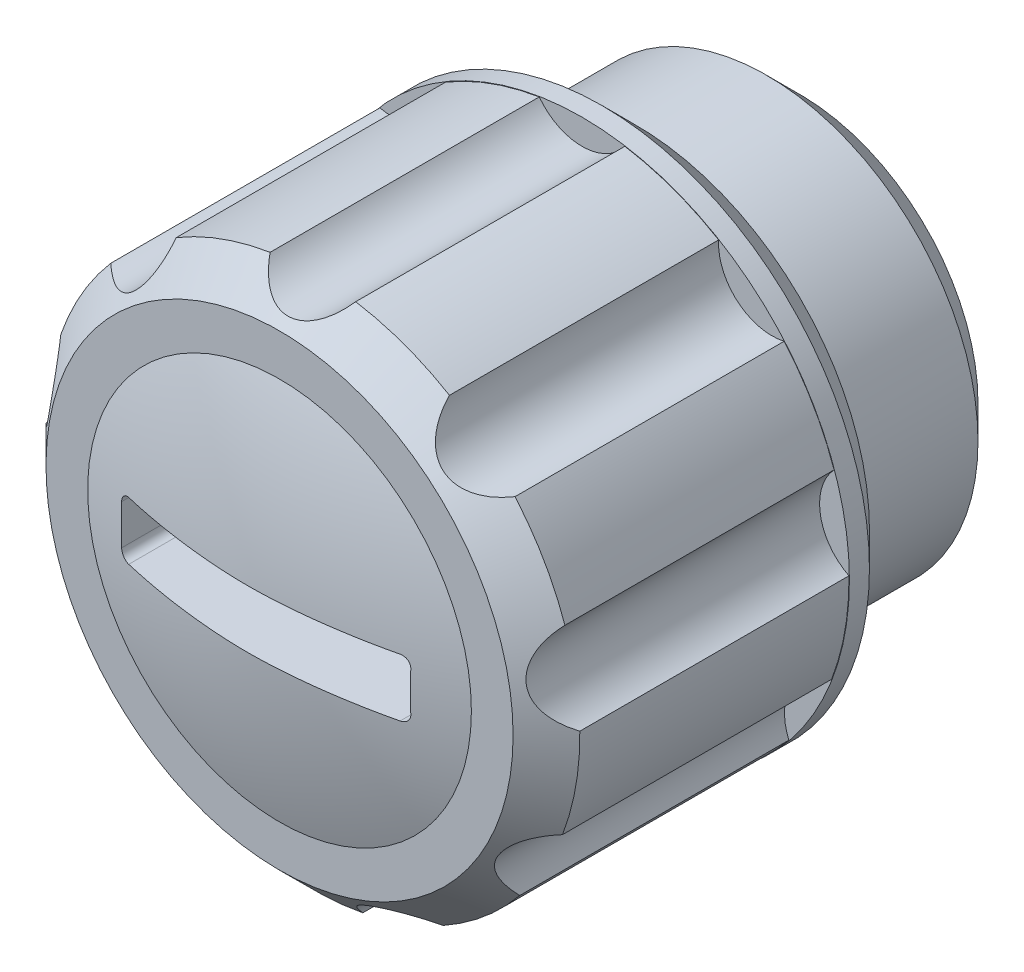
ISO-10303-21;
HEADER;
FILE_DESCRIPTION(('STEP AP214'),'2;1');
FILE_NAME('part.step','',(''),(''),'','','');
FILE_SCHEMA(('AUTOMOTIVE_DESIGN { 1 0 10303 214 1 1 1 1 }'));
ENDSEC;
DATA;
#1=APPLICATION_CONTEXT('core data for automotive mechanical design processes');
#2=APPLICATION_PROTOCOL_DEFINITION('international standard','automotive_design',2000,#1);
#3=PRODUCT_CONTEXT('',#1,'mechanical');
#4=PRODUCT('Part','Part','',(#3));
#5=PRODUCT_RELATED_PRODUCT_CATEGORY('part','',(#4));
#6=PRODUCT_DEFINITION_FORMATION('','',#4);
#7=PRODUCT_DEFINITION_CONTEXT('part definition',#1,'design');
#8=PRODUCT_DEFINITION('design','',#6,#7);
#9=PRODUCT_DEFINITION_SHAPE('','',#8);
#10=(LENGTH_UNIT() NAMED_UNIT(*) SI_UNIT(.MILLI.,.METRE.));
#11=(NAMED_UNIT(*) PLANE_ANGLE_UNIT() SI_UNIT($,.RADIAN.));
#12=(NAMED_UNIT(*) SI_UNIT($,.STERADIAN.) SOLID_ANGLE_UNIT());
#13=UNCERTAINTY_MEASURE_WITH_UNIT(LENGTH_MEASURE(1.E-05),#10,'distance_accuracy_value','');
#14=(GEOMETRIC_REPRESENTATION_CONTEXT(3) GLOBAL_UNCERTAINTY_ASSIGNED_CONTEXT((#13)) GLOBAL_UNIT_ASSIGNED_CONTEXT((#10,
#11,#12)) REPRESENTATION_CONTEXT('',''));
#15=CARTESIAN_POINT('',(0.,0.,0.));
#16=DIRECTION('',(0.,0.,1.));
#17=DIRECTION('',(1.,0.,0.));
#18=AXIS2_PLACEMENT_3D('',#15,#16,#17);
#19=CARTESIAN_POINT('',(0.,0.,-2.24502330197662));
#20=DIRECTION('',(0.,0.,1.));
#21=DIRECTION('',(1.,0.,0.));
#22=AXIS2_PLACEMENT_3D('',#19,#20,#21);
#23=DEGENERATE_TOROIDAL_SURFACE('',#22,0.386362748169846,14.9999999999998,.F.);
#24=CARTESIAN_POINT('',(0.,0.,12.));
#25=DIRECTION('',(0.,0.,1.));
#26=DIRECTION('',(1.,0.,0.));
#27=AXIS2_PLACEMENT_3D('',#24,#25,#26);
#28=CIRCLE('',#27,4.3125);
#29=CARTESIAN_POINT('',(4.3125,0.,12.));
#30=VERTEX_POINT('',#29);
#31=EDGE_CURVE('E356',#30,#30,#28,.T.);
#32=ORIENTED_EDGE('',*,*,#31,.T.);
#33=EDGE_LOOP('',(#32));
#34=FACE_BOUND('',#33,.T.);
#35=CARTESIAN_POINT('',(-3.0498,-0.649999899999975,12.3398097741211));
#36=CARTESIAN_POINT('',(-3.06120822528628,-0.650019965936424,12.3371277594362));
#37=CARTESIAN_POINT('',(-3.07262553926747,-0.649047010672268,12.3344789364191));
#38=CARTESIAN_POINT('',(-3.09516164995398,-0.645167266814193,12.3293198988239));
#39=CARTESIAN_POINT('',(-3.10628037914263,-0.642260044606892,12.326809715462));
#40=CARTESIAN_POINT('',(-3.1279071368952,-0.634560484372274,12.3219992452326));
#41=CARTESIAN_POINT('',(-3.13841459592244,-0.629766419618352,12.3196991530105));
#42=CARTESIAN_POINT('',(-3.15848770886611,-0.618413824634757,12.3153819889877));
#43=CARTESIAN_POINT('',(-3.16805381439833,-0.611856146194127,12.3133647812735));
#44=CARTESIAN_POINT('',(-3.18579781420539,-0.59727066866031,12.3097075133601));
#45=CARTESIAN_POINT('',(-3.19399634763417,-0.589269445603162,12.308061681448));
#46=CARTESIAN_POINT('',(-3.20893719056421,-0.571941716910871,12.3051577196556));
#47=CARTESIAN_POINT('',(-3.2156793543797,-0.562615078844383,12.303899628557));
#48=CARTESIAN_POINT('',(-3.22732440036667,-0.543172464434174,12.3018421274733));
#49=CARTESIAN_POINT('',(-3.23227144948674,-0.533084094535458,12.3010314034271));
#50=CARTESIAN_POINT('',(-3.24041051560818,-0.512202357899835,12.2998457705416));
#51=CARTESIAN_POINT('',(-3.24360397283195,-0.501409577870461,12.299470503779));
#52=CARTESIAN_POINT('',(-3.24725089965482,-0.483746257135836,12.2992265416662));
#53=CARTESIAN_POINT('',(-3.24828749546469,-0.476992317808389,12.2992171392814));
#54=CARTESIAN_POINT('',(-3.24966526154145,-0.4634255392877,12.2993633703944));
#55=CARTESIAN_POINT('',(-3.25000743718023,-0.456612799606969,12.2995187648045));
#56=CARTESIAN_POINT('',(-3.24999990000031,-0.449800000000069,12.2997561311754));
#57=B_SPLINE_CURVE_WITH_KNOTS('',3,(#35,#36,#37,#38,#39,#40,#41,#42,#43,#44,#45,#46,#47,#48,#49,
#50,#51,#52,#53,#54,#55,#56),.UNSPECIFIED.,.F.,.F.,(4,2,2,2,2,2,2,2,2,2,4),(0.,
0.0351172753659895,0.0702424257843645,0.10539979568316,0.140540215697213,0.175089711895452,
0.209642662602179,0.243276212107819,0.276882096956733,0.297346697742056,0.317781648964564),.UNSPECIFIED.);
#58=CARTESIAN_POINT('',(-3.05,-0.65,12.3397627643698));
#59=VERTEX_POINT('',#58);
#60=CARTESIAN_POINT('',(-3.25,-0.45,12.2997491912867));
#61=VERTEX_POINT('',#60);
#62=EDGE_CURVE('E27',#59,#61,#57,.T.);
#63=ORIENTED_EDGE('',*,*,#62,.T.);
#64=CARTESIAN_POINT('',(-3.25,0.,12.3075320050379));
#65=CARTESIAN_POINT('',(-3.25,0.277728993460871,12.3075356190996));
#66=CARTESIAN_POINT('',(-3.25,0.555440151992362,12.2986179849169));
#67=CARTESIAN_POINT('',(-3.25,1.10971337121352,12.2631914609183));
#68=CARTESIAN_POINT('',(-3.25,1.38627553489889,12.2366841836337));
#69=CARTESIAN_POINT('',(-3.25,1.93745588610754,12.1665755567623));
#70=CARTESIAN_POINT('',(-3.25,2.21207222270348,12.122959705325));
#71=CARTESIAN_POINT('',(-3.25,2.75819405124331,12.019207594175));
#72=CARTESIAN_POINT('',(-3.25,3.02969897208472,11.9590683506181));
#73=CARTESIAN_POINT('',(-3.25,3.68907942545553,11.7923343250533));
#74=CARTESIAN_POINT('',(-3.25,4.07477310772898,11.6769874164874));
#75=CARTESIAN_POINT('',(-3.25,4.83507528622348,11.4141726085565));
#76=CARTESIAN_POINT('',(-3.25,5.20968196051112,11.2666994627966));
#77=CARTESIAN_POINT('',(-3.25,5.94561682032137,10.9408021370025));
#78=CARTESIAN_POINT('',(-3.25,6.30693188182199,10.7623483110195));
#79=CARTESIAN_POINT('',(-3.25,7.013278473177,10.3760839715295));
#80=CARTESIAN_POINT('',(-3.25,7.35831779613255,10.1682877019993));
#81=CARTESIAN_POINT('',(-3.25,8.03118455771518,9.72399493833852));
#82=CARTESIAN_POINT('',(-3.25,8.35894545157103,9.48739766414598));
#83=CARTESIAN_POINT('',(-3.25,8.99368126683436,8.98778857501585));
#84=CARTESIAN_POINT('',(-3.25,9.30065586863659,8.72477635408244));
#85=CARTESIAN_POINT('',(-3.25,9.8916546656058,8.1742495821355));
#86=CARTESIAN_POINT('',(-3.25,10.1756840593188,7.88674061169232));
#87=CARTESIAN_POINT('',(-3.25,10.7189336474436,7.2891687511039));
#88=CARTESIAN_POINT('',(-3.25,10.9781537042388,6.97910573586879));
#89=CARTESIAN_POINT('',(-3.25,11.4737062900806,6.33376323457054));
#90=CARTESIAN_POINT('',(-3.25,11.7096373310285,5.9981753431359));
#91=CARTESIAN_POINT('',(-3.25,12.1524595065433,5.30835452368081));
#92=CARTESIAN_POINT('',(-3.25,12.3593503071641,4.95412138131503));
#93=CARTESIAN_POINT('',(-3.25,12.7426542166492,4.22948724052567));
#94=CARTESIAN_POINT('',(-3.25,12.9190643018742,3.85908464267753));
#95=CARTESIAN_POINT('',(-3.25,13.2401398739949,3.10476845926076));
#96=CARTESIAN_POINT('',(-3.25,13.3848053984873,2.72085488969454));
#97=CARTESIAN_POINT('',(-3.25,13.6416809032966,1.94130139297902));
#98=CARTESIAN_POINT('',(-3.25,13.753812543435,1.5456356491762));
#99=CARTESIAN_POINT('',(-3.25,13.944363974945,0.746267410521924));
#100=CARTESIAN_POINT('',(-3.25,14.0227836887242,0.342564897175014));
#101=CARTESIAN_POINT('',(-3.25,14.1453548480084,-0.469998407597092));
#102=CARTESIAN_POINT('',(-3.25,14.1895071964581,-0.8788590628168));
#103=CARTESIAN_POINT('',(-3.25,14.2432347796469,-1.69884576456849));
#104=CARTESIAN_POINT('',(-3.25,14.2528100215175,-2.10997181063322));
#105=CARTESIAN_POINT('',(-3.25,14.2373111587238,-2.93180992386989));
#106=CARTESIAN_POINT('',(-3.25,14.2122168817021,-3.34252161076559));
#107=CARTESIAN_POINT('',(-3.25,14.1275207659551,-4.16037161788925));
#108=CARTESIAN_POINT('',(-3.25,14.0679189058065,-4.56750993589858));
#109=CARTESIAN_POINT('',(-3.25,13.9146256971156,-5.37533907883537));
#110=CARTESIAN_POINT('',(-3.25,13.8209326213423,-5.77602957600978));
#111=CARTESIAN_POINT('',(-3.25,13.6001207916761,-6.568092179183));
#112=CARTESIAN_POINT('',(-3.25,13.4730020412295,-6.95946428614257));
#113=CARTESIAN_POINT('',(-3.25,13.186232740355,-7.7301217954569));
#114=CARTESIAN_POINT('',(-3.25,13.0265808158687,-8.10940668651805));
#115=CARTESIAN_POINT('',(-3.25,12.6758786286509,-8.85317181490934));
#116=CARTESIAN_POINT('',(-3.25,12.4848283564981,-9.21765204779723));
#117=CARTESIAN_POINT('',(-3.25,12.072711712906,-9.92915798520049));
#118=CARTESIAN_POINT('',(-3.25,11.8516496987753,-10.2761862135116));
#119=CARTESIAN_POINT('',(-3.25,11.3810523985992,-10.9503675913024));
#120=CARTESIAN_POINT('',(-3.25,11.1315171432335,-11.2775207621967));
#121=CARTESIAN_POINT('',(-3.25,10.6059307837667,-11.9093794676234));
#122=CARTESIAN_POINT('',(-3.25,10.3298992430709,-12.2141012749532));
#123=CARTESIAN_POINT('',(-3.25,9.75311451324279,-12.7991756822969));
#124=CARTESIAN_POINT('',(-3.25,9.45236128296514,-13.0795282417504));
#125=CARTESIAN_POINT('',(-3.25,8.82813062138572,-13.6139441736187));
#126=CARTESIAN_POINT('',(-3.25,8.50464416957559,-13.8679970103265));
#127=CARTESIAN_POINT('',(-3.25,7.8373363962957,-14.3478241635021));
#128=CARTESIAN_POINT('',(-3.25,7.49351512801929,-14.573598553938));
#129=CARTESIAN_POINT('',(-3.25,6.78879460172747,-14.9946762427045));
#130=CARTESIAN_POINT('',(-3.25,6.42793763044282,-15.1900503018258));
#131=CARTESIAN_POINT('',(-3.25,5.69092259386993,-15.5494366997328));
#132=CARTESIAN_POINT('',(-3.25,5.31476441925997,-15.7134488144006));
#133=CARTESIAN_POINT('',(-3.25,4.54996490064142,-16.0086112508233));
#134=CARTESIAN_POINT('',(-3.25,4.16132971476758,-16.1397775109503));
#135=CARTESIAN_POINT('',(-3.25,3.37414151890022,-16.367940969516));
#136=CARTESIAN_POINT('',(-3.25,2.97558824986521,-16.4649372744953));
#137=CARTESIAN_POINT('',(-3.25,2.17796770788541,-16.6218590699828));
#138=CARTESIAN_POINT('',(-3.25,1.77901685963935,-16.682368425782));
#139=CARTESIAN_POINT('',(-3.25,1.17783289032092,-16.7458571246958));
#140=CARTESIAN_POINT('',(-3.25,0.976962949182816,-16.7624743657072));
#141=CARTESIAN_POINT('',(-3.25,0.574677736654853,-16.7864370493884));
#142=CARTESIAN_POINT('',(-3.25,0.373262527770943,-16.7937835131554));
#143=CARTESIAN_POINT('',(-3.25,-0.0296307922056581,-16.7991040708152));
#144=CARTESIAN_POINT('',(-3.25,-0.231108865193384,-16.7970810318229));
#145=CARTESIAN_POINT('',(-3.25,-0.633740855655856,-16.7837024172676));
#146=CARTESIAN_POINT('',(-3.25,-0.834894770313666,-16.7723467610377));
#147=CARTESIAN_POINT('',(-3.25,-1.43727360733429,-16.7244784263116));
#148=CARTESIAN_POINT('',(-3.25,-1.83748615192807,-16.6741652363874));
#149=CARTESIAN_POINT('',(-3.25,-2.60244344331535,-16.5434913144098));
#150=CARTESIAN_POINT('',(-3.25,-2.9676242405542,-16.465624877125));
#151=CARTESIAN_POINT('',(-3.25,-3.69061293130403,-16.2811099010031));
#152=CARTESIAN_POINT('',(-3.25,-4.04842149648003,-16.1744639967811));
#153=CARTESIAN_POINT('',(-3.25,-4.75476881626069,-15.9334225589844));
#154=CARTESIAN_POINT('',(-3.25,-5.10330243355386,-15.7990119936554));
#155=CARTESIAN_POINT('',(-3.25,-5.78889033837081,-15.5035347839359));
#156=CARTESIAN_POINT('',(-3.25,-6.12594408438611,-15.3424668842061));
#157=CARTESIAN_POINT('',(-3.25,-6.80932679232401,-14.9828170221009));
#158=CARTESIAN_POINT('',(-3.25,-7.15470066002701,-14.7824174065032));
#159=CARTESIAN_POINT('',(-3.25,-7.82779768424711,-14.3538815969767));
#160=CARTESIAN_POINT('',(-3.25,-8.15552013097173,-14.1257442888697));
#161=CARTESIAN_POINT('',(-3.25,-8.79107255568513,-13.6433774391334));
#162=CARTESIAN_POINT('',(-3.25,-9.09890611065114,-13.3891526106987));
#163=CARTESIAN_POINT('',(-3.25,-9.69269581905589,-12.8563257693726));
#164=CARTESIAN_POINT('',(-3.25,-9.97865187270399,-12.5777236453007));
#165=CARTESIAN_POINT('',(-3.25,-10.5337680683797,-11.9906483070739));
#166=CARTESIAN_POINT('',(-3.25,-10.8023152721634,-11.6815951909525));
#167=CARTESIAN_POINT('',(-3.25,-11.3125257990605,-11.0420356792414));
#168=CARTESIAN_POINT('',(-3.25,-11.5541885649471,-10.7115288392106));
#169=CARTESIAN_POINT('',(-3.25,-12.0089741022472,-10.0313455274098));
#170=CARTESIAN_POINT('',(-3.25,-12.2220918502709,-9.6816656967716));
#171=CARTESIAN_POINT('',(-3.25,-12.6182423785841,-8.96566280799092));
#172=CARTESIAN_POINT('',(-3.25,-12.8012752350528,-8.59933979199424));
#173=CARTESIAN_POINT('',(-3.25,-13.1366167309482,-7.85119993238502));
#174=CARTESIAN_POINT('',(-3.25,-13.2888047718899,-7.46932902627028));
#175=CARTESIAN_POINT('',(-3.25,-13.5604975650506,-6.69413124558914));
#176=CARTESIAN_POINT('',(-3.25,-13.680002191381,-6.30080432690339));
#177=CARTESIAN_POINT('',(-3.25,-13.885478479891,-5.505506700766));
#178=CARTESIAN_POINT('',(-3.25,-13.9714517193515,-5.10353640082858));
#179=CARTESIAN_POINT('',(-3.25,-14.1092657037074,-4.29378701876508));
#180=CARTESIAN_POINT('',(-3.25,-14.1611064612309,-3.88600793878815));
#181=CARTESIAN_POINT('',(-3.25,-14.2303212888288,-3.06715435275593));
#182=CARTESIAN_POINT('',(-3.25,-14.2476633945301,-2.65607714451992));
#183=CARTESIAN_POINT('',(-3.25,-14.2476620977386,-1.83392251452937));
#184=CARTESIAN_POINT('',(-3.25,-14.2303186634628,-1.42284509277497));
#185=CARTESIAN_POINT('',(-3.25,-14.1610682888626,-0.603603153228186));
#186=CARTESIAN_POINT('',(-3.25,-14.1091606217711,-0.195438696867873));
#187=CARTESIAN_POINT('',(-3.25,-13.9711485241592,0.615067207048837));
#188=CARTESIAN_POINT('',(-3.25,-13.885044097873,1.01740865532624));
#189=CARTESIAN_POINT('',(-3.25,-13.6792331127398,1.81346557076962));
#190=CARTESIAN_POINT('',(-3.25,-13.5595217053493,2.20717978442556));
#191=CARTESIAN_POINT('',(-3.25,-13.2873494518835,2.98312116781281));
#192=CARTESIAN_POINT('',(-3.25,-13.1348885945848,3.36534833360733));
#193=CARTESIAN_POINT('',(-3.25,-12.7982999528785,4.11558729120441));
#194=CARTESIAN_POINT('',(-3.25,-12.6141727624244,4.48359934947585));
#195=CARTESIAN_POINT('',(-3.25,-12.2155528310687,5.20279306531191));
#196=CARTESIAN_POINT('',(-3.25,-12.0010601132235,5.55397473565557));
#197=CARTESIAN_POINT('',(-3.25,-11.5433180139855,6.2368658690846));
#198=CARTESIAN_POINT('',(-3.25,-11.3000801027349,6.56858302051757));
#199=CARTESIAN_POINT('',(-3.25,-10.7864981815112,7.2103264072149));
#200=CARTESIAN_POINT('',(-3.25,-10.5161541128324,7.52035259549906));
#201=CARTESIAN_POINT('',(-3.25,-9.95025306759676,8.11650757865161));
#202=CARTESIAN_POINT('',(-3.25,-9.65469453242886,8.4026348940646));
#203=CARTESIAN_POINT('',(-3.25,-9.04046877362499,8.94890264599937));
#204=CARTESIAN_POINT('',(-3.25,-8.72180175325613,9.20904331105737));
#205=CARTESIAN_POINT('',(-3.25,-8.06411837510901,9.70105813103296));
#206=CARTESIAN_POINT('',(-3.25,-7.72513441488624,9.93297559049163));
#207=CARTESIAN_POINT('',(-3.25,-7.02875492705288,10.3672880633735));
#208=CARTESIAN_POINT('',(-3.25,-6.67135962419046,10.5696834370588));
#209=CARTESIAN_POINT('',(-3.25,-5.94066060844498,10.9433896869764));
#210=CARTESIAN_POINT('',(-3.25,-5.56735649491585,11.1146997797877));
#211=CARTESIAN_POINT('',(-3.25,-4.80749189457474,11.4247686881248));
#212=CARTESIAN_POINT('',(-3.25,-4.42093314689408,11.5635317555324));
#213=CARTESIAN_POINT('',(-3.25,-3.70318039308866,11.786627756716));
#214=CARTESIAN_POINT('',(-3.25,-3.37360154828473,11.876189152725));
#215=CARTESIAN_POINT('',(-3.25,-2.70877137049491,12.0309482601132));
#216=CARTESIAN_POINT('',(-3.25,-2.37352047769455,12.0961478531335));
#217=CARTESIAN_POINT('',(-3.25,-1.69957377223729,12.2010954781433));
#218=CARTESIAN_POINT('',(-3.25,-1.36088404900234,12.2408824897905));
#219=CARTESIAN_POINT('',(-3.25,-0.681453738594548,12.2940966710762));
#220=CARTESIAN_POINT('',(-3.25,-0.340713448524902,12.3075275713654));
#221=CARTESIAN_POINT('',(-3.25,0.,12.3075320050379));
#222=B_SPLINE_CURVE_WITH_KNOTS('',3,(#64,#65,#66,#67,#68,#69,#70,#71,#72,#73,#74,#75,#76,#77,
#78,#79,#80,#81,#82,#83,#84,#85,#86,#87,#88,#89,#90,#91,#92,#93,#94,#95,#96,#97,#98,#99,#100,
#101,#102,#103,#104,#105,#106,#107,#108,#109,#110,#111,#112,#113,#114,#115,#116,#117,#118,#119,
#120,#121,#122,#123,#124,#125,#126,#127,#128,#129,#130,#131,#132,#133,#134,#135,#136,#137,#138,
#139,#140,#141,#142,#143,#144,#145,#146,#147,#148,#149,#150,#151,#152,#153,#154,#155,#156,#157,
#158,#159,#160,#161,#162,#163,#164,#165,#166,#167,#168,#169,#170,#171,#172,#173,#174,#175,#176,
#177,#178,#179,#180,#181,#182,#183,#184,#185,#186,#187,#188,#189,#190,#191,#192,#193,#194,#195,
#196,#197,#198,#199,#200,#201,#202,#203,#204,#205,#206,#207,#208,#209,#210,#211,#212,#213,#214,
#215,#216,#217,#218,#219,#220,#221),.UNSPECIFIED.,.T.,.F.,(4,2,2,2,2,2,2,2,2,2,2,2,2,2,2,2,2,2,
2,2,2,2,2,2,2,2,2,2,2,2,2,2,2,2,2,2,2,2,2,2,2,2,2,2,2,2,2,2,2,2,2,2,2,2,2,2,2,2,2,2,2,2,2,2,2,2,
2,2,2,2,2,2,2,2,2,2,2,2,4),(0.,0.833015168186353,1.66595398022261,2.49960035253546,
3.33339736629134,4.53957397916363,5.74594771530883,6.95348227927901,8.16043266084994,
9.37173482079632,10.583055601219,11.7941011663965,13.0051534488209,14.2343656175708,
15.4635919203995,16.6929400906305,17.9222868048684,19.15456962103,20.3868552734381,
21.6191084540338,22.8513613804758,24.0843315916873,25.3173025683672,26.5503360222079,
27.7833693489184,29.01645476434,30.2495405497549,31.4824474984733,32.7153531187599,
33.9473553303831,35.1793595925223,36.4118555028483,37.6443481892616,38.8739277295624,
40.1035160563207,41.3325065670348,42.5615292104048,43.7703236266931,44.3748145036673,
44.97923879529,45.583478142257,46.1877227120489,47.3960010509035,48.5150195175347,
49.6339355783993,50.7534590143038,51.8730351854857,53.0695719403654,54.2661567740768,
55.4625258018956,56.658900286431,57.8857327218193,59.1125905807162,60.3396640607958,
61.5667344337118,62.7985136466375,64.0302976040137,65.2620236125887,66.4937491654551,
67.7266154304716,68.9594828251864,70.1923761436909,71.4252693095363,72.6583404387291,
73.8914119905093,75.1244604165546,76.3575079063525,77.5900650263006,78.8226248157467,
80.05526085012,81.2878860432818,82.5185954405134,83.7492898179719,84.9800152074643,
86.2105797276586,87.2343070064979,88.2579551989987,89.2800294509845,90.3019590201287),.UNSPECIFIED.);
#223=CARTESIAN_POINT('',(-3.25,0.45,12.2997491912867));
#224=VERTEX_POINT('',#223);
#225=EDGE_CURVE('E9',#61,#224,#222,.T.);
#226=ORIENTED_EDGE('',*,*,#225,.T.);
#227=CARTESIAN_POINT('',(-3.24999989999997,0.4498,12.2997561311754));
#228=CARTESIAN_POINT('',(-3.25002147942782,0.460776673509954,12.2993714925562));
#229=CARTESIAN_POINT('',(-3.24911882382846,0.471758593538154,12.2992032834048));
#230=CARTESIAN_POINT('',(-3.24553635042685,0.493412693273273,12.2992941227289));
#231=CARTESIAN_POINT('',(-3.24285883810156,0.504085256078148,12.299552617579));
#232=CARTESIAN_POINT('',(-3.23579622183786,0.524834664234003,12.3004904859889));
#233=CARTESIAN_POINT('',(-3.23141042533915,0.53491126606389,12.3011700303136));
#234=CARTESIAN_POINT('',(-3.22107038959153,0.554184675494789,12.3029273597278));
#235=CARTESIAN_POINT('',(-3.21511623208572,0.563381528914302,12.3040051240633));
#236=CARTESIAN_POINT('',(-3.20177417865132,0.580709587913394,12.3065339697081));
#237=CARTESIAN_POINT('',(-3.19437690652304,0.588833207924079,12.3079875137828));
#238=CARTESIAN_POINT('',(-3.17839327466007,0.603735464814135,12.3112205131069));
#239=CARTESIAN_POINT('',(-3.16980667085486,0.610513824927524,12.3130000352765));
#240=CARTESIAN_POINT('',(-3.15148706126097,0.62269653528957,12.3168763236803));
#241=CARTESIAN_POINT('',(-3.14173272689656,0.628066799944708,12.3189792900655));
#242=CARTESIAN_POINT('',(-3.12151319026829,0.637105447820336,12.3234120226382));
#243=CARTESIAN_POINT('',(-3.11104805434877,0.640773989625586,12.3257417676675));
#244=CARTESIAN_POINT('',(-3.09210451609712,0.64570458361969,12.3300193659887));
#245=CARTESIAN_POINT('',(-3.08370936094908,0.647322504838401,12.3319350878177));
#246=CARTESIAN_POINT('',(-3.06680849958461,0.649474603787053,12.3358309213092));
#247=CARTESIAN_POINT('',(-3.05830296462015,0.650010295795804,12.3378109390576));
#248=CARTESIAN_POINT('',(-3.0498,0.649999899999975,12.3398097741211));
#249=B_SPLINE_CURVE_WITH_KNOTS('',3,(#227,#228,#229,#230,#231,#232,#233,#234,#235,#236,#237,
#238,#239,#240,#241,#242,#243,#244,#245,#246,#247,#248),.UNSPECIFIED.,.F.,.F.,(4,2,2,2,2,2,2,2,
2,2,4),(0.,0.0329053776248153,0.0657680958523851,0.0986441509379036,0.13151849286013,
0.1646140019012,0.197716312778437,0.231558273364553,0.265397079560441,0.291616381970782,
0.31779897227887),.UNSPECIFIED.);
#250=CARTESIAN_POINT('',(-3.04999999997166,0.65,12.3397627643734));
#251=VERTEX_POINT('',#250);
#252=EDGE_CURVE('E419',#224,#251,#249,.T.);
#253=ORIENTED_EDGE('',*,*,#252,.T.);
#254=CARTESIAN_POINT('',(0.,0.65,12.7191322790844));
#255=CARTESIAN_POINT('',(0.108520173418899,0.65,12.7191277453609));
#256=CARTESIAN_POINT('',(0.217041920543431,0.65,12.7172094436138));
#257=CARTESIAN_POINT('',(0.433997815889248,0.65,12.7099981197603));
#258=CARTESIAN_POINT('',(0.542431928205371,0.65,12.7047040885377));
#259=CARTESIAN_POINT('',(0.759555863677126,0.65,12.6912706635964));
#260=CARTESIAN_POINT('',(0.868244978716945,0.65,12.6831199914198));
#261=CARTESIAN_POINT('',(1.08539837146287,0.65,12.6642185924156));
#262=CARTESIAN_POINT('',(1.19386263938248,0.65,12.6534677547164));
#263=CARTESIAN_POINT('',(1.51887735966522,0.65,12.6174925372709));
#264=CARTESIAN_POINT('',(1.73502604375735,0.65,12.5885469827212));
#265=CARTESIAN_POINT('',(2.16611297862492,0.65,12.5210525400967));
#266=CARTESIAN_POINT('',(2.38104917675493,0.65,12.4824906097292));
#267=CARTESIAN_POINT('',(2.80901885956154,0.65,12.3959374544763));
#268=CARTESIAN_POINT('',(3.02205219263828,0.65,12.3479454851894));
#269=CARTESIAN_POINT('',(3.64169701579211,0.65,12.1939819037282));
#270=CARTESIAN_POINT('',(4.04525595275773,0.65,12.0754170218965));
#271=CARTESIAN_POINT('',(4.84106887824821,0.65,11.804706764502));
#272=CARTESIAN_POINT('',(5.23331827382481,0.65,11.6525479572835));
#273=CARTESIAN_POINT('',(6.00390173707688,0.65,11.3156534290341));
#274=CARTESIAN_POINT('',(6.382226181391,0.65,11.1308956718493));
#275=CARTESIAN_POINT('',(7.12194189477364,0.65,10.7302214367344));
#276=CARTESIAN_POINT('',(7.48333496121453,0.65,10.5143082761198));
#277=CARTESIAN_POINT('',(8.18679974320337,0.65,10.0527629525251));
#278=CARTESIAN_POINT('',(8.52886465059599,0.65,9.80712041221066));
#279=CARTESIAN_POINT('',(9.19111928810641,0.65,9.28791513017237));
#280=CARTESIAN_POINT('',(9.51130841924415,0.65,9.01435162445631));
#281=CARTESIAN_POINT('',(10.1275007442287,0.65,8.44128082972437));
#282=CARTESIAN_POINT('',(10.4235063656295,0.65,8.14177615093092));
#283=CARTESIAN_POINT('',(10.9892674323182,0.65,7.51892636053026));
#284=CARTESIAN_POINT('',(11.2590230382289,0.65,7.19558139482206));
#285=CARTESIAN_POINT('',(11.7706885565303,0.65,6.52693164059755));
#286=CARTESIAN_POINT('',(12.012563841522,0.65,6.18160035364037));
#287=CARTESIAN_POINT('',(12.4663665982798,0.65,5.47179015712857));
#288=CARTESIAN_POINT('',(12.6782939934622,0.65,5.10731119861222));
#289=CARTESIAN_POINT('',(13.0706918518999,0.65,4.36180202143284));
#290=CARTESIAN_POINT('',(13.2511627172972,0.65,3.98077201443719));
#291=CARTESIAN_POINT('',(13.5793682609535,0.65,3.20486500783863));
#292=CARTESIAN_POINT('',(13.7271029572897,0.65,2.80998801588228));
#293=CARTESIAN_POINT('',(13.988800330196,0.65,2.00915107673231));
#294=CARTESIAN_POINT('',(14.1027594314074,0.65,1.60318996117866));
#295=CARTESIAN_POINT('',(14.2960746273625,0.65,0.783110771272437));
#296=CARTESIAN_POINT('',(14.3754307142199,0.65,0.368992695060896));
#297=CARTESIAN_POINT('',(14.498977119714,0.65,-0.464465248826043));
#298=CARTESIAN_POINT('',(14.5431666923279,0.65,-0.883805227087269));
#299=CARTESIAN_POINT('',(14.596063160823,0.65,-1.72471716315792));
#300=CARTESIAN_POINT('',(14.6047700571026,0.65,-2.1462891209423));
#301=CARTESIAN_POINT('',(14.5866390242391,0.65,-2.98868011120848));
#302=CARTESIAN_POINT('',(14.5598000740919,0.65,-3.40949912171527));
#303=CARTESIAN_POINT('',(14.4707663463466,0.65,-4.24738022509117));
#304=CARTESIAN_POINT('',(14.4085715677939,0.65,-4.66444231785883));
#305=CARTESIAN_POINT('',(14.2492707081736,0.65,-5.49183187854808));
#306=CARTESIAN_POINT('',(14.1521656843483,0.65,-5.90215955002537));
#307=CARTESIAN_POINT('',(13.92373427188,0.65,-6.7131760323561));
#308=CARTESIAN_POINT('',(13.7924078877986,0.65,-7.11386484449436));
#309=CARTESIAN_POINT('',(13.4964692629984,0.65,-7.90274953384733));
#310=CARTESIAN_POINT('',(13.3318574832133,0.65,-8.29094558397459));
#311=CARTESIAN_POINT('',(12.9705168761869,0.65,-9.05209088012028));
#312=CARTESIAN_POINT('',(12.7737880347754,0.65,-9.42504011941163));
#313=CARTESIAN_POINT('',(12.3495993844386,0.65,-10.1530610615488));
#314=CARTESIAN_POINT('',(12.1221378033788,0.65,-10.5081317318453));
#315=CARTESIAN_POINT('',(11.6381096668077,0.65,-11.1978469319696));
#316=CARTESIAN_POINT('',(11.3815431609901,0.65,-11.5324914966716));
#317=CARTESIAN_POINT('',(10.8411381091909,0.65,-12.1789638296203));
#318=CARTESIAN_POINT('',(10.5573005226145,0.65,-12.4907923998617));
#319=CARTESIAN_POINT('',(9.9643609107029,0.65,-13.0894299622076));
#320=CARTESIAN_POINT('',(9.65525870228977,0.65,-13.3762387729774));
#321=CARTESIAN_POINT('',(9.01399860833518,0.65,-13.9227850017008));
#322=CARTESIAN_POINT('',(8.681841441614,0.65,-14.1825232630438));
#323=CARTESIAN_POINT('',(7.99683299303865,0.65,-14.6730822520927));
#324=CARTESIAN_POINT('',(7.64398231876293,0.65,-14.9039038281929));
#325=CARTESIAN_POINT('',(6.92002553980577,0.65,-15.335028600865));
#326=CARTESIAN_POINT('',(6.5489163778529,0.65,-15.5353266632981));
#327=CARTESIAN_POINT('',(5.79113277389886,0.65,-15.903924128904));
#328=CARTESIAN_POINT('',(5.40445847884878,0.65,-16.0722238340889));
#329=CARTESIAN_POINT('',(4.61839618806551,0.65,-16.3755712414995));
#330=CARTESIAN_POINT('',(4.21901109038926,0.65,-16.5106264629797));
#331=CARTESIAN_POINT('',(3.41037855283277,0.65,-16.7464936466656));
#332=CARTESIAN_POINT('',(3.00113546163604,0.65,-16.8473204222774));
#333=CARTESIAN_POINT('',(2.37474825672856,0.65,-16.9737106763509));
#334=CARTESIAN_POINT('',(2.16011736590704,0.65,-17.0121235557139));
#335=CARTESIAN_POINT('',(1.72933145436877,0.65,-17.0793970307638));
#336=CARTESIAN_POINT('',(1.51317639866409,0.65,-17.1082574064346));
#337=CARTESIAN_POINT('',(1.1883245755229,0.65,-17.1440821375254));
#338=CARTESIAN_POINT('',(1.08002619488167,0.65,-17.1547737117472));
#339=CARTESIAN_POINT('',(0.863198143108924,0.65,-17.1735629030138));
#340=CARTESIAN_POINT('',(0.754668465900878,0.65,-17.1816604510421));
#341=CARTESIAN_POINT('',(0.537464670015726,0.65,-17.1950151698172));
#342=CARTESIAN_POINT('',(0.42879060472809,0.65,-17.2002731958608));
#343=CARTESIAN_POINT('',(0.211334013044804,0.65,-17.20738850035));
#344=CARTESIAN_POINT('',(0.102551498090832,0.65,-17.2092461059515));
#345=CARTESIAN_POINT('',(-0.098037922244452,0.65,-17.2091183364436));
#346=CARTESIAN_POINT('',(-0.189845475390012,0.65,-17.2076873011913));
#347=CARTESIAN_POINT('',(-0.373392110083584,0.65,-17.2023544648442));
#348=CARTESIAN_POINT('',(-0.465131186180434,0.65,-17.1984524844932));
#349=CARTESIAN_POINT('',(-0.648525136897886,0.65,-17.1885366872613));
#350=CARTESIAN_POINT('',(-0.740179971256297,0.65,-17.1825221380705));
#351=CARTESIAN_POINT('',(-0.923340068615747,0.65,-17.1685825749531));
#352=CARTESIAN_POINT('',(-1.01484533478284,0.65,-17.1606576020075));
#353=CARTESIAN_POINT('',(-1.28932831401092,0.65,-17.1341570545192));
#354=CARTESIAN_POINT('',(-1.47205047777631,0.65,-17.1128685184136));
#355=CARTESIAN_POINT('',(-1.83651738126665,0.65,-17.0634122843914));
#356=CARTESIAN_POINT('',(-2.01826229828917,0.65,-17.0352458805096));
#357=CARTESIAN_POINT('',(-2.38129600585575,0.65,-16.9720306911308));
#358=CARTESIAN_POINT('',(-2.56258014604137,0.65,-16.936955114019));
#359=CARTESIAN_POINT('',(-2.92371751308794,0.65,-16.8600846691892));
#360=CARTESIAN_POINT('',(-3.10357066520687,0.65,-16.8182894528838));
#361=CARTESIAN_POINT('',(-3.64033450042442,0.65,-16.6830040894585));
#362=CARTESIAN_POINT('',(-3.9947892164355,0.65,-16.57955495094));
#363=CARTESIAN_POINT('',(-4.71178689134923,0.65,-16.3411791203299));
#364=CARTESIAN_POINT('',(-5.07390702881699,0.65,-16.2049845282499));
#365=CARTESIAN_POINT('',(-5.78663052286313,0.65,-15.9049349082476));
#366=CARTESIAN_POINT('',(-6.13723052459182,0.65,-15.7410719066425));
#367=CARTESIAN_POINT('',(-6.82400082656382,0.65,-15.3870663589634));
#368=CARTESIAN_POINT('',(-7.16019896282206,0.65,-15.1969778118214));
#369=CARTESIAN_POINT('',(-7.81689468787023,0.65,-14.7914249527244));
#370=CARTESIAN_POINT('',(-8.13739298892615,0.65,-14.5759617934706));
#371=CARTESIAN_POINT('',(-8.7889588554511,0.65,-14.1003791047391));
#372=CARTESIAN_POINT('',(-9.118369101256,0.65,-13.8379842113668));
#373=CARTESIAN_POINT('',(-9.75396306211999,0.65,-13.2863857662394));
#374=CARTESIAN_POINT('',(-10.0601446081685,0.65,-12.9971797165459));
#375=CARTESIAN_POINT('',(-10.6473742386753,0.65,-12.3937305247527));
#376=CARTESIAN_POINT('',(-10.9283974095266,0.65,-12.0794631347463));
#377=CARTESIAN_POINT('',(-11.4629667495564,0.65,-11.4283824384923));
#378=CARTESIAN_POINT('',(-11.716513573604,0.65,-11.0915696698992));
#379=CARTESIAN_POINT('',(-12.1943966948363,0.65,-10.3976989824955));
#380=CARTESIAN_POINT('',(-12.4187257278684,0.65,-10.0406360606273));
#381=CARTESIAN_POINT('',(-12.836505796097,0.65,-9.30887820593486));
#382=CARTESIAN_POINT('',(-13.0299566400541,0.65,-8.93418316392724));
#383=CARTESIAN_POINT('',(-13.3845512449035,0.65,-8.1699401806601));
#384=CARTESIAN_POINT('',(-13.5457045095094,0.65,-7.78039664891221));
#385=CARTESIAN_POINT('',(-13.8346300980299,0.65,-6.98912166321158));
#386=CARTESIAN_POINT('',(-13.9624024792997,0.65,-6.58739023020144));
#387=CARTESIAN_POINT('',(-14.1836800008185,0.65,-5.77451590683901));
#388=CARTESIAN_POINT('',(-14.2771785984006,0.65,-5.36337123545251));
#389=CARTESIAN_POINT('',(-14.4292098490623,0.65,-4.53466691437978));
#390=CARTESIAN_POINT('',(-14.487742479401,0.65,-4.11710726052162));
#391=CARTESIAN_POINT('',(-14.5694291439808,0.65,-3.27850601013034));
#392=CARTESIAN_POINT('',(-14.5925801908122,0.65,-2.85746412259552));
#393=CARTESIAN_POINT('',(-14.6033296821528,0.65,-2.01492679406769));
#394=CARTESIAN_POINT('',(-14.5909281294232,0.65,-1.59343135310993));
#395=CARTESIAN_POINT('',(-14.5306606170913,0.65,-0.752983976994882));
#396=CARTESIAN_POINT('',(-14.4827946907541,0.65,-0.334032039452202));
#397=CARTESIAN_POINT('',(-14.351938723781,0.65,0.49835010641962));
#398=CARTESIAN_POINT('',(-14.2689486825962,0.65,0.911780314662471));
#399=CARTESIAN_POINT('',(-14.0684388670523,0.65,1.73016147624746));
#400=CARTESIAN_POINT('',(-13.9509206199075,0.65,2.13511280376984));
#401=CARTESIAN_POINT('',(-13.6821883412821,0.65,2.93367609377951));
#402=CARTESIAN_POINT('',(-13.5309743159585,0.65,3.32728805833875));
#403=CARTESIAN_POINT('',(-13.1959267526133,0.65,4.10037092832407));
#404=CARTESIAN_POINT('',(-13.0120935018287,0.65,4.47984195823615));
#405=CARTESIAN_POINT('',(-12.6131130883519,0.65,5.22194896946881));
#406=CARTESIAN_POINT('',(-12.3979659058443,0.65,5.58458494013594));
#407=CARTESIAN_POINT('',(-11.9378740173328,0.65,6.29046298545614));
#408=CARTESIAN_POINT('',(-11.6929276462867,0.65,6.63370397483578));
#409=CARTESIAN_POINT('',(-11.1749886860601,0.65,7.29832838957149));
#410=CARTESIAN_POINT('',(-10.9019961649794,0.65,7.61971186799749));
#411=CARTESIAN_POINT('',(-10.3299256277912,0.65,8.23831388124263));
#412=CARTESIAN_POINT('',(-10.0308495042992,0.65,8.53553416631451));
#413=CARTESIAN_POINT('',(-9.40871715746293,0.65,9.10372430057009));
#414=CARTESIAN_POINT('',(-9.08566069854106,0.65,9.37469389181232));
#415=CARTESIAN_POINT('',(-8.41785441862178,0.65,9.88845978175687));
#416=CARTESIAN_POINT('',(-8.07310383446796,0.65,10.1312550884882));
#417=CARTESIAN_POINT('',(-7.36438263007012,0.65,10.5869228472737));
#418=CARTESIAN_POINT('',(-7.00041275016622,0.65,10.799796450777));
#419=CARTESIAN_POINT('',(-6.25574024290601,0.65,11.1941576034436));
#420=CARTESIAN_POINT('',(-5.87503367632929,0.65,11.3756377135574));
#421=CARTESIAN_POINT('',(-5.09960838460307,0.65,11.7058730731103));
#422=CARTESIAN_POINT('',(-4.70488757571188,0.65,11.8546234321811));
#423=CARTESIAN_POINT('',(-3.90465475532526,0.65,12.118151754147));
#424=CARTESIAN_POINT('',(-3.49915214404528,0.65,12.2329583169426));
#425=CARTESIAN_POINT('',(-2.67985286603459,0.65,12.4278850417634));
#426=CARTESIAN_POINT('',(-2.26605705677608,0.65,12.5080087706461));
#427=CARTESIAN_POINT('',(-1.69646981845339,0.65,12.5931341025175));
#428=CARTESIAN_POINT('',(-1.54287539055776,0.65,12.6136119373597));
#429=CARTESIAN_POINT('',(-1.23513895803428,0.65,12.6495835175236));
#430=CARTESIAN_POINT('',(-1.08099712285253,0.65,12.6650786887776));
#431=CARTESIAN_POINT('',(-0.772511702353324,0.65,12.6907884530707));
#432=CARTESIAN_POINT('',(-0.618168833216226,0.65,12.7010114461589));
#433=CARTESIAN_POINT('',(-0.386454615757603,0.65,12.7116612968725));
#434=CARTESIAN_POINT('',(-0.309189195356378,0.65,12.7144304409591));
#435=CARTESIAN_POINT('',(-0.154616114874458,0.65,12.7181675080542));
#436=CARTESIAN_POINT('',(-0.0773084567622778,0.65,12.7191355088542));
#437=CARTESIAN_POINT('',(0.,0.65,12.7191322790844));
#438=B_SPLINE_CURVE_WITH_KNOTS('',3,(#254,#255,#256,#257,#258,#259,#260,#261,#262,#263,#264,
#265,#266,#267,#268,#269,#270,#271,#272,#273,#274,#275,#276,#277,#278,#279,#280,#281,#282,#283,
#284,#285,#286,#287,#288,#289,#290,#291,#292,#293,#294,#295,#296,#297,#298,#299,#300,#301,#302,
#303,#304,#305,#306,#307,#308,#309,#310,#311,#312,#313,#314,#315,#316,#317,#318,#319,#320,#321,
#322,#323,#324,#325,#326,#327,#328,#329,#330,#331,#332,#333,#334,#335,#336,#337,#338,#339,#340,
#341,#342,#343,#344,#345,#346,#347,#348,#349,#350,#351,#352,#353,#354,#355,#356,#357,#358,#359,
#360,#361,#362,#363,#364,#365,#366,#367,#368,#369,#370,#371,#372,#373,#374,#375,#376,#377,#378,
#379,#380,#381,#382,#383,#384,#385,#386,#387,#388,#389,#390,#391,#392,#393,#394,#395,#396,#397,
#398,#399,#400,#401,#402,#403,#404,#405,#406,#407,#408,#409,#410,#411,#412,#413,#414,#415,#416,
#417,#418,#419,#420,#421,#422,#423,#424,#425,#426,#427,#428,#429,#430,#431,#432,#433,#434,#435,
#436,#437),.UNSPECIFIED.,.T.,.F.,(4,2,2,2,2,2,2,2,2,2,2,2,2,2,2,2,2,2,2,2,2,2,2,2,2,2,2,2,2,2,2,
2,2,2,2,2,2,2,2,2,2,2,2,2,2,2,2,2,2,2,2,2,2,2,2,2,2,2,2,2,2,2,2,2,2,2,2,2,2,2,2,2,2,2,2,2,2,2,2,
2,2,2,2,2,2,2,2,2,2,2,2,4),(0.,0.325550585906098,0.651198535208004,0.978146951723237,
1.30510931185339,1.95910516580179,2.61399287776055,3.26893230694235,4.52915364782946,
5.78987977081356,7.05146140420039,8.31290880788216,9.57479780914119,10.8367213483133,
12.0985180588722,13.3603070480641,14.6236466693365,15.8869895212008,17.1503162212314,
18.4136422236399,19.6771019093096,20.9405618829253,22.2040486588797,23.4675354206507,
24.7310584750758,25.9945815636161,27.2580663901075,28.5215510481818,29.7850182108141,
31.048485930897,32.3120265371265,33.5755649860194,34.8390589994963,36.1025621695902,
37.366025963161,38.6294526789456,39.8930916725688,41.1567187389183,42.4200597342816,
43.6828532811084,44.3368060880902,44.9907739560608,45.3172246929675,45.64368411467,
45.9700451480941,46.296374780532,46.5717928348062,46.8472308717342,47.1227644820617,
47.3982921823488,47.9500163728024,48.5016368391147,49.0554399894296,49.6092718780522,
50.7159038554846,51.8754142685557,53.0352594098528,54.1927510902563,55.3501902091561,
56.6121057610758,57.8741390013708,59.1374084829,60.4006478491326,61.6642006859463,
62.9277613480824,64.1909496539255,65.4541357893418,66.7175629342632,67.9809909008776,
69.2445255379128,70.5080600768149,71.7715934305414,73.0351268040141,74.2986042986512,
75.5620815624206,76.8255477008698,78.0890146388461,79.3525522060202,80.6160867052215,
81.8795295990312,83.1429849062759,84.4064846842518,85.6699358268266,86.9336859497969,
88.1976247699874,89.4604955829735,90.7232364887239,91.1880404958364,91.6527113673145,
92.1166395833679,92.3485678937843,92.5804861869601),.UNSPECIFIED.);
#439=CARTESIAN_POINT('',(3.05,0.65,12.3397627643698));
#440=VERTEX_POINT('',#439);
#441=EDGE_CURVE('E429',#251,#440,#438,.T.);
#442=ORIENTED_EDGE('',*,*,#441,.T.);
#443=CARTESIAN_POINT('',(3.0498,0.649999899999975,12.3398097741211));
#444=CARTESIAN_POINT('',(3.06120822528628,0.650019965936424,12.3371277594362));
#445=CARTESIAN_POINT('',(3.07262553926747,0.649047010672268,12.3344789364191));
#446=CARTESIAN_POINT('',(3.09516164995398,0.645167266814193,12.3293198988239));
#447=CARTESIAN_POINT('',(3.10628037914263,0.642260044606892,12.326809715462));
#448=CARTESIAN_POINT('',(3.1279071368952,0.634560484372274,12.3219992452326));
#449=CARTESIAN_POINT('',(3.13841459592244,0.629766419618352,12.3196991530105));
#450=CARTESIAN_POINT('',(3.15848770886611,0.618413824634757,12.3153819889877));
#451=CARTESIAN_POINT('',(3.16805381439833,0.611856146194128,12.3133647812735));
#452=CARTESIAN_POINT('',(3.18579781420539,0.597270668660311,12.3097075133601));
#453=CARTESIAN_POINT('',(3.19399634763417,0.589269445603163,12.308061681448));
#454=CARTESIAN_POINT('',(3.20893719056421,0.571941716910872,12.3051577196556));
#455=CARTESIAN_POINT('',(3.2156793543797,0.562615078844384,12.303899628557));
#456=CARTESIAN_POINT('',(3.22732440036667,0.543172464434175,12.3018421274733));
#457=CARTESIAN_POINT('',(3.23227144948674,0.533084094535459,12.3010314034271));
#458=CARTESIAN_POINT('',(3.24041051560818,0.512202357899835,12.2998457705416));
#459=CARTESIAN_POINT('',(3.24360397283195,0.501409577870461,12.299470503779));
#460=CARTESIAN_POINT('',(3.24725089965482,0.483746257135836,12.2992265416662));
#461=CARTESIAN_POINT('',(3.24828749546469,0.476992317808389,12.2992171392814));
#462=CARTESIAN_POINT('',(3.24966526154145,0.4634255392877,12.2993633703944));
#463=CARTESIAN_POINT('',(3.25000743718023,0.456612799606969,12.2995187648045));
#464=CARTESIAN_POINT('',(3.24999990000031,0.449800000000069,12.2997561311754));
#465=B_SPLINE_CURVE_WITH_KNOTS('',3,(#443,#444,#445,#446,#447,#448,#449,#450,#451,#452,#453,
#454,#455,#456,#457,#458,#459,#460,#461,#462,#463,#464),.UNSPECIFIED.,.F.,.F.,(4,2,2,2,2,2,2,2,
2,2,4),(0.,0.0351172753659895,0.0702424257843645,0.105399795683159,0.140540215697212,
0.175089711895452,0.209642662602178,0.243276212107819,0.276882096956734,0.297346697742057,
0.317781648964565),.UNSPECIFIED.);
#466=CARTESIAN_POINT('',(3.25,0.45,12.2997491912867));
#467=VERTEX_POINT('',#466);
#468=EDGE_CURVE('E436',#440,#467,#465,.T.);
#469=ORIENTED_EDGE('',*,*,#468,.T.);
#470=CARTESIAN_POINT('',(3.25,0.,12.3075320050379));
#471=CARTESIAN_POINT('',(3.25,-0.277728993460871,12.3075356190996));
#472=CARTESIAN_POINT('',(3.25,-0.555440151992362,12.2986179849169));
#473=CARTESIAN_POINT('',(3.25,-1.10971337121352,12.2631914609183));
#474=CARTESIAN_POINT('',(3.25,-1.38627553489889,12.2366841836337));
#475=CARTESIAN_POINT('',(3.25,-1.93745588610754,12.1665755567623));
#476=CARTESIAN_POINT('',(3.25,-2.21207222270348,12.122959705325));
#477=CARTESIAN_POINT('',(3.25,-2.75819405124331,12.019207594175));
#478=CARTESIAN_POINT('',(3.25,-3.02969897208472,11.9590683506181));
#479=CARTESIAN_POINT('',(3.25,-3.68907942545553,11.7923343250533));
#480=CARTESIAN_POINT('',(3.25,-4.07477310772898,11.6769874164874));
#481=CARTESIAN_POINT('',(3.25,-4.83507528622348,11.4141726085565));
#482=CARTESIAN_POINT('',(3.25,-5.20968196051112,11.2666994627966));
#483=CARTESIAN_POINT('',(3.25,-5.94561682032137,10.9408021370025));
#484=CARTESIAN_POINT('',(3.25,-6.30693188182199,10.7623483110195));
#485=CARTESIAN_POINT('',(3.25,-7.013278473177,10.3760839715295));
#486=CARTESIAN_POINT('',(3.25,-7.35831779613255,10.1682877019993));
#487=CARTESIAN_POINT('',(3.25,-8.03118455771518,9.72399493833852));
#488=CARTESIAN_POINT('',(3.25,-8.35894545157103,9.48739766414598));
#489=CARTESIAN_POINT('',(3.25,-8.99368126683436,8.98778857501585));
#490=CARTESIAN_POINT('',(3.25,-9.30065586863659,8.72477635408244));
#491=CARTESIAN_POINT('',(3.25,-9.8916546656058,8.1742495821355));
#492=CARTESIAN_POINT('',(3.25,-10.1756840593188,7.88674061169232));
#493=CARTESIAN_POINT('',(3.25,-10.7189336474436,7.2891687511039));
#494=CARTESIAN_POINT('',(3.25,-10.9781537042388,6.97910573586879));
#495=CARTESIAN_POINT('',(3.25,-11.4737062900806,6.33376323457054));
#496=CARTESIAN_POINT('',(3.25,-11.7096373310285,5.9981753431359));
#497=CARTESIAN_POINT('',(3.25,-12.1524595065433,5.30835452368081));
#498=CARTESIAN_POINT('',(3.25,-12.3593503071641,4.95412138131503));
#499=CARTESIAN_POINT('',(3.25,-12.7426542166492,4.22948724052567));
#500=CARTESIAN_POINT('',(3.25,-12.9190643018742,3.85908464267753));
#501=CARTESIAN_POINT('',(3.25,-13.2401398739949,3.10476845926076));
#502=CARTESIAN_POINT('',(3.25,-13.3848053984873,2.72085488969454));
#503=CARTESIAN_POINT('',(3.25,-13.6416809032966,1.94130139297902));
#504=CARTESIAN_POINT('',(3.25,-13.753812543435,1.5456356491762));
#505=CARTESIAN_POINT('',(3.25,-13.944363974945,0.746267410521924));
#506=CARTESIAN_POINT('',(3.25,-14.0227836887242,0.342564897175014));
#507=CARTESIAN_POINT('',(3.25,-14.1453548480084,-0.469998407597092));
#508=CARTESIAN_POINT('',(3.25,-14.1895071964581,-0.8788590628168));
#509=CARTESIAN_POINT('',(3.25,-14.2432347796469,-1.69884576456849));
#510=CARTESIAN_POINT('',(3.25,-14.2528100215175,-2.10997181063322));
#511=CARTESIAN_POINT('',(3.25,-14.2373111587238,-2.93180992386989));
#512=CARTESIAN_POINT('',(3.25,-14.2122168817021,-3.34252161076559));
#513=CARTESIAN_POINT('',(3.25,-14.1275207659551,-4.16037161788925));
#514=CARTESIAN_POINT('',(3.25,-14.0679189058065,-4.56750993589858));
#515=CARTESIAN_POINT('',(3.25,-13.9146256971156,-5.37533907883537));
#516=CARTESIAN_POINT('',(3.25,-13.8209326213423,-5.77602957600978));
#517=CARTESIAN_POINT('',(3.25,-13.6001207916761,-6.568092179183));
#518=CARTESIAN_POINT('',(3.25,-13.4730020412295,-6.95946428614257));
#519=CARTESIAN_POINT('',(3.25,-13.186232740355,-7.7301217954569));
#520=CARTESIAN_POINT('',(3.25,-13.0265808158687,-8.10940668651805));
#521=CARTESIAN_POINT('',(3.25,-12.6758786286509,-8.85317181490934));
#522=CARTESIAN_POINT('',(3.25,-12.4848283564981,-9.21765204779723));
#523=CARTESIAN_POINT('',(3.25,-12.072711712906,-9.92915798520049));
#524=CARTESIAN_POINT('',(3.25,-11.8516496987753,-10.2761862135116));
#525=CARTESIAN_POINT('',(3.25,-11.3810523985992,-10.9503675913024));
#526=CARTESIAN_POINT('',(3.25,-11.1315171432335,-11.2775207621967));
#527=CARTESIAN_POINT('',(3.25,-10.6059307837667,-11.9093794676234));
#528=CARTESIAN_POINT('',(3.25,-10.3298992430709,-12.2141012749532));
#529=CARTESIAN_POINT('',(3.25,-9.75311451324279,-12.7991756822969));
#530=CARTESIAN_POINT('',(3.25,-9.45236128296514,-13.0795282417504));
#531=CARTESIAN_POINT('',(3.25,-8.82813062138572,-13.6139441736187));
#532=CARTESIAN_POINT('',(3.25,-8.50464416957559,-13.8679970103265));
#533=CARTESIAN_POINT('',(3.25,-7.8373363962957,-14.3478241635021));
#534=CARTESIAN_POINT('',(3.25,-7.49351512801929,-14.573598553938));
#535=CARTESIAN_POINT('',(3.25,-6.78879460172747,-14.9946762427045));
#536=CARTESIAN_POINT('',(3.25,-6.42793763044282,-15.1900503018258));
#537=CARTESIAN_POINT('',(3.25,-5.69092259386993,-15.5494366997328));
#538=CARTESIAN_POINT('',(3.25,-5.31476441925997,-15.7134488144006));
#539=CARTESIAN_POINT('',(3.25,-4.54996490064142,-16.0086112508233));
#540=CARTESIAN_POINT('',(3.25,-4.16132971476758,-16.1397775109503));
#541=CARTESIAN_POINT('',(3.25,-3.37414151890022,-16.367940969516));
#542=CARTESIAN_POINT('',(3.25,-2.97558824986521,-16.4649372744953));
#543=CARTESIAN_POINT('',(3.25,-2.17796770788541,-16.6218590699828));
#544=CARTESIAN_POINT('',(3.25,-1.77901685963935,-16.682368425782));
#545=CARTESIAN_POINT('',(3.25,-1.17783289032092,-16.7458571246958));
#546=CARTESIAN_POINT('',(3.25,-0.976962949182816,-16.7624743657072));
#547=CARTESIAN_POINT('',(3.25,-0.574677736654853,-16.7864370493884));
#548=CARTESIAN_POINT('',(3.25,-0.373262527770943,-16.7937835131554));
#549=CARTESIAN_POINT('',(3.25,0.0296307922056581,-16.7991040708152));
#550=CARTESIAN_POINT('',(3.25,0.231108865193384,-16.7970810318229));
#551=CARTESIAN_POINT('',(3.25,0.633740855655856,-16.7837024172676));
#552=CARTESIAN_POINT('',(3.25,0.834894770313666,-16.7723467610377));
#553=CARTESIAN_POINT('',(3.25,1.43727360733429,-16.7244784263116));
#554=CARTESIAN_POINT('',(3.25,1.83748615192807,-16.6741652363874));
#555=CARTESIAN_POINT('',(3.25,2.60244344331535,-16.5434913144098));
#556=CARTESIAN_POINT('',(3.25,2.9676242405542,-16.465624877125));
#557=CARTESIAN_POINT('',(3.25,3.69061293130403,-16.2811099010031));
#558=CARTESIAN_POINT('',(3.25,4.04842149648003,-16.1744639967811));
#559=CARTESIAN_POINT('',(3.25,4.75476881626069,-15.9334225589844));
#560=CARTESIAN_POINT('',(3.25,5.10330243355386,-15.7990119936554));
#561=CARTESIAN_POINT('',(3.25,5.78889033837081,-15.5035347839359));
#562=CARTESIAN_POINT('',(3.25,6.12594408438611,-15.3424668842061));
#563=CARTESIAN_POINT('',(3.25,6.80932679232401,-14.9828170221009));
#564=CARTESIAN_POINT('',(3.25,7.15470066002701,-14.7824174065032));
#565=CARTESIAN_POINT('',(3.25,7.82779768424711,-14.3538815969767));
#566=CARTESIAN_POINT('',(3.25,8.15552013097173,-14.1257442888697));
#567=CARTESIAN_POINT('',(3.25,8.79107255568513,-13.6433774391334));
#568=CARTESIAN_POINT('',(3.25,9.09890611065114,-13.3891526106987));
#569=CARTESIAN_POINT('',(3.25,9.69269581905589,-12.8563257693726));
#570=CARTESIAN_POINT('',(3.25,9.97865187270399,-12.5777236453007));
#571=CARTESIAN_POINT('',(3.25,10.5337680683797,-11.9906483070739));
#572=CARTESIAN_POINT('',(3.25,10.8023152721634,-11.6815951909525));
#573=CARTESIAN_POINT('',(3.25,11.3125257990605,-11.0420356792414));
#574=CARTESIAN_POINT('',(3.25,11.5541885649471,-10.7115288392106));
#575=CARTESIAN_POINT('',(3.25,12.0089741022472,-10.0313455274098));
#576=CARTESIAN_POINT('',(3.25,12.2220918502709,-9.6816656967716));
#577=CARTESIAN_POINT('',(3.25,12.6182423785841,-8.96566280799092));
#578=CARTESIAN_POINT('',(3.25,12.8012752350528,-8.59933979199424));
#579=CARTESIAN_POINT('',(3.25,13.1366167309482,-7.85119993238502));
#580=CARTESIAN_POINT('',(3.25,13.2888047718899,-7.46932902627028));
#581=CARTESIAN_POINT('',(3.25,13.5604975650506,-6.69413124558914));
#582=CARTESIAN_POINT('',(3.25,13.680002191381,-6.30080432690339));
#583=CARTESIAN_POINT('',(3.25,13.885478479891,-5.505506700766));
#584=CARTESIAN_POINT('',(3.25,13.9714517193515,-5.10353640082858));
#585=CARTESIAN_POINT('',(3.25,14.1092657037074,-4.29378701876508));
#586=CARTESIAN_POINT('',(3.25,14.1611064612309,-3.88600793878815));
#587=CARTESIAN_POINT('',(3.25,14.2303212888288,-3.06715435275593));
#588=CARTESIAN_POINT('',(3.25,14.2476633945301,-2.65607714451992));
#589=CARTESIAN_POINT('',(3.25,14.2476620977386,-1.83392251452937));
#590=CARTESIAN_POINT('',(3.25,14.2303186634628,-1.42284509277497));
#591=CARTESIAN_POINT('',(3.25,14.1610682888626,-0.603603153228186));
#592=CARTESIAN_POINT('',(3.25,14.1091606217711,-0.195438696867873));
#593=CARTESIAN_POINT('',(3.25,13.9711485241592,0.615067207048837));
#594=CARTESIAN_POINT('',(3.25,13.885044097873,1.01740865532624));
#595=CARTESIAN_POINT('',(3.25,13.6792331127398,1.81346557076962));
#596=CARTESIAN_POINT('',(3.25,13.5595217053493,2.20717978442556));
#597=CARTESIAN_POINT('',(3.25,13.2873494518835,2.98312116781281));
#598=CARTESIAN_POINT('',(3.25,13.1348885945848,3.36534833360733));
#599=CARTESIAN_POINT('',(3.25,12.7982999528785,4.11558729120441));
#600=CARTESIAN_POINT('',(3.25,12.6141727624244,4.48359934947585));
#601=CARTESIAN_POINT('',(3.25,12.2155528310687,5.20279306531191));
#602=CARTESIAN_POINT('',(3.25,12.0010601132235,5.55397473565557));
#603=CARTESIAN_POINT('',(3.25,11.5433180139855,6.2368658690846));
#604=CARTESIAN_POINT('',(3.25,11.3000801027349,6.56858302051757));
#605=CARTESIAN_POINT('',(3.25,10.7864981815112,7.2103264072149));
#606=CARTESIAN_POINT('',(3.25,10.5161541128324,7.52035259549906));
#607=CARTESIAN_POINT('',(3.25,9.95025306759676,8.11650757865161));
#608=CARTESIAN_POINT('',(3.25,9.65469453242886,8.4026348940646));
#609=CARTESIAN_POINT('',(3.25,9.04046877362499,8.94890264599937));
#610=CARTESIAN_POINT('',(3.25,8.72180175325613,9.20904331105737));
#611=CARTESIAN_POINT('',(3.25,8.06411837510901,9.70105813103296));
#612=CARTESIAN_POINT('',(3.25,7.72513441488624,9.93297559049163));
#613=CARTESIAN_POINT('',(3.25,7.02875492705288,10.3672880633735));
#614=CARTESIAN_POINT('',(3.25,6.67135962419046,10.5696834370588));
#615=CARTESIAN_POINT('',(3.25,5.94066060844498,10.9433896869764));
#616=CARTESIAN_POINT('',(3.25,5.56735649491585,11.1146997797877));
#617=CARTESIAN_POINT('',(3.25,4.80749189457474,11.4247686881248));
#618=CARTESIAN_POINT('',(3.25,4.42093314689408,11.5635317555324));
#619=CARTESIAN_POINT('',(3.25,3.70318039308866,11.786627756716));
#620=CARTESIAN_POINT('',(3.25,3.37360154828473,11.876189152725));
#621=CARTESIAN_POINT('',(3.25,2.70877137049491,12.0309482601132));
#622=CARTESIAN_POINT('',(3.25,2.37352047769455,12.0961478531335));
#623=CARTESIAN_POINT('',(3.25,1.69957377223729,12.2010954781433));
#624=CARTESIAN_POINT('',(3.25,1.36088404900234,12.2408824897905));
#625=CARTESIAN_POINT('',(3.25,0.681453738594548,12.2940966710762));
#626=CARTESIAN_POINT('',(3.25,0.340713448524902,12.3075275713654));
#627=CARTESIAN_POINT('',(3.25,0.,12.3075320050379));
#628=B_SPLINE_CURVE_WITH_KNOTS('',3,(#470,#471,#472,#473,#474,#475,#476,#477,#478,#479,#480,
#481,#482,#483,#484,#485,#486,#487,#488,#489,#490,#491,#492,#493,#494,#495,#496,#497,#498,#499,
#500,#501,#502,#503,#504,#505,#506,#507,#508,#509,#510,#511,#512,#513,#514,#515,#516,#517,#518,
#519,#520,#521,#522,#523,#524,#525,#526,#527,#528,#529,#530,#531,#532,#533,#534,#535,#536,#537,
#538,#539,#540,#541,#542,#543,#544,#545,#546,#547,#548,#549,#550,#551,#552,#553,#554,#555,#556,
#557,#558,#559,#560,#561,#562,#563,#564,#565,#566,#567,#568,#569,#570,#571,#572,#573,#574,#575,
#576,#577,#578,#579,#580,#581,#582,#583,#584,#585,#586,#587,#588,#589,#590,#591,#592,#593,#594,
#595,#596,#597,#598,#599,#600,#601,#602,#603,#604,#605,#606,#607,#608,#609,#610,#611,#612,#613,
#614,#615,#616,#617,#618,#619,#620,#621,#622,#623,#624,#625,#626,#627),.UNSPECIFIED.,.T.,.F.,(4,
2,2,2,2,2,2,2,2,2,2,2,2,2,2,2,2,2,2,2,2,2,2,2,2,2,2,2,2,2,2,2,2,2,2,2,2,2,2,2,2,2,2,2,2,2,2,2,2,
2,2,2,2,2,2,2,2,2,2,2,2,2,2,2,2,2,2,2,2,2,2,2,2,2,2,2,2,2,4),(0.,0.833015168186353,
1.66595398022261,2.49960035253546,3.33339736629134,4.53957397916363,5.74594771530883,
6.95348227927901,8.16043266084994,9.37173482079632,10.583055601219,11.7941011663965,
13.0051534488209,14.2343656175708,15.4635919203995,16.6929400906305,17.9222868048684,
19.15456962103,20.3868552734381,21.6191084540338,22.8513613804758,24.0843315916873,
25.3173025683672,26.5503360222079,27.7833693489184,29.01645476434,30.2495405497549,
31.4824474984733,32.7153531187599,33.9473553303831,35.1793595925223,36.4118555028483,
37.6443481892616,38.8739277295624,40.1035160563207,41.3325065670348,42.5615292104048,
43.7703236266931,44.3748145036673,44.97923879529,45.583478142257,46.1877227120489,
47.3960010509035,48.5150195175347,49.6339355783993,50.7534590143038,51.8730351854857,
53.0695719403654,54.2661567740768,55.4625258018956,56.658900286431,57.8857327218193,
59.1125905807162,60.3396640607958,61.5667344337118,62.7985136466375,64.0302976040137,
65.2620236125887,66.4937491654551,67.7266154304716,68.9594828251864,70.1923761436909,
71.4252693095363,72.6583404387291,73.8914119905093,75.1244604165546,76.3575079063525,
77.5900650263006,78.8226248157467,80.05526085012,81.2878860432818,82.5185954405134,
83.7492898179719,84.9800152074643,86.2105797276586,87.2343070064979,88.2579551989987,
89.2800294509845,90.3019590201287),.UNSPECIFIED.);
#629=CARTESIAN_POINT('',(3.25,-0.45,12.2997491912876));
#630=VERTEX_POINT('',#629);
#631=EDGE_CURVE('E444',#467,#630,#628,.T.);
#632=ORIENTED_EDGE('',*,*,#631,.T.);
#633=CARTESIAN_POINT('',(3.24999989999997,-0.4498,12.2997561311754));
#634=CARTESIAN_POINT('',(3.25002147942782,-0.460776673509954,12.2993714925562));
#635=CARTESIAN_POINT('',(3.24911882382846,-0.471758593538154,12.2992032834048));
#636=CARTESIAN_POINT('',(3.24553635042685,-0.493412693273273,12.2992941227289));
#637=CARTESIAN_POINT('',(3.24285883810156,-0.504085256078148,12.299552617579));
#638=CARTESIAN_POINT('',(3.23579622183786,-0.524834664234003,12.3004904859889));
#639=CARTESIAN_POINT('',(3.23141042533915,-0.53491126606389,12.3011700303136));
#640=CARTESIAN_POINT('',(3.22107038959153,-0.554184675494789,12.3029273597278));
#641=CARTESIAN_POINT('',(3.21511623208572,-0.563381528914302,12.3040051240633));
#642=CARTESIAN_POINT('',(3.20177417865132,-0.580709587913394,12.3065339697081));
#643=CARTESIAN_POINT('',(3.19437690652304,-0.588833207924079,12.3079875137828));
#644=CARTESIAN_POINT('',(3.17839327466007,-0.603735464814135,12.3112205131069));
#645=CARTESIAN_POINT('',(3.16980667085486,-0.610513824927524,12.3130000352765));
#646=CARTESIAN_POINT('',(3.15148706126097,-0.62269653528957,12.3168763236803));
#647=CARTESIAN_POINT('',(3.14173272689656,-0.628066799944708,12.3189792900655));
#648=CARTESIAN_POINT('',(3.12151319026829,-0.637105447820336,12.3234120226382));
#649=CARTESIAN_POINT('',(3.11104805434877,-0.640773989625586,12.3257417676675));
#650=CARTESIAN_POINT('',(3.09210451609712,-0.64570458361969,12.3300193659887));
#651=CARTESIAN_POINT('',(3.08370936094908,-0.647322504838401,12.3319350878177));
#652=CARTESIAN_POINT('',(3.06680849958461,-0.649474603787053,12.3358309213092));
#653=CARTESIAN_POINT('',(3.05830296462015,-0.650010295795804,12.3378109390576));
#654=CARTESIAN_POINT('',(3.0498,-0.649999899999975,12.3398097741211));
#655=B_SPLINE_CURVE_WITH_KNOTS('',3,(#633,#634,#635,#636,#637,#638,#639,#640,#641,#642,#643,
#644,#645,#646,#647,#648,#649,#650,#651,#652,#653,#654),.UNSPECIFIED.,.F.,.F.,(4,2,2,2,2,2,2,2,
2,2,4),(0.,0.0329053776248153,0.0657680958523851,0.0986441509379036,0.13151849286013,
0.1646140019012,0.197716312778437,0.231558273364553,0.265397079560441,0.291616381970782,
0.31779897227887),.UNSPECIFIED.);
#656=CARTESIAN_POINT('',(3.05,-0.65,12.3397627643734));
#657=VERTEX_POINT('',#656);
#658=EDGE_CURVE('E451',#630,#657,#655,.T.);
#659=ORIENTED_EDGE('',*,*,#658,.T.);
#660=CARTESIAN_POINT('',(0.,-0.65,12.7191322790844));
#661=CARTESIAN_POINT('',(-0.108520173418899,-0.65,12.7191277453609));
#662=CARTESIAN_POINT('',(-0.217041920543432,-0.65,12.7172094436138));
#663=CARTESIAN_POINT('',(-0.433997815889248,-0.65,12.7099981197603));
#664=CARTESIAN_POINT('',(-0.542431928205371,-0.65,12.7047040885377));
#665=CARTESIAN_POINT('',(-0.759555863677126,-0.65,12.6912706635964));
#666=CARTESIAN_POINT('',(-0.868244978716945,-0.65,12.6831199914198));
#667=CARTESIAN_POINT('',(-1.08539837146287,-0.65,12.6642185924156));
#668=CARTESIAN_POINT('',(-1.19386263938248,-0.65,12.6534677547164));
#669=CARTESIAN_POINT('',(-1.51887735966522,-0.65,12.6174925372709));
#670=CARTESIAN_POINT('',(-1.73502604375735,-0.65,12.5885469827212));
#671=CARTESIAN_POINT('',(-2.16611297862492,-0.65,12.5210525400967));
#672=CARTESIAN_POINT('',(-2.38104917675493,-0.65,12.4824906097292));
#673=CARTESIAN_POINT('',(-2.80901885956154,-0.65,12.3959374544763));
#674=CARTESIAN_POINT('',(-3.02205219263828,-0.65,12.3479454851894));
#675=CARTESIAN_POINT('',(-3.64169701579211,-0.65,12.1939819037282));
#676=CARTESIAN_POINT('',(-4.04525595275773,-0.65,12.0754170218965));
#677=CARTESIAN_POINT('',(-4.84106887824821,-0.65,11.804706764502));
#678=CARTESIAN_POINT('',(-5.23331827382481,-0.65,11.6525479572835));
#679=CARTESIAN_POINT('',(-6.00390173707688,-0.65,11.3156534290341));
#680=CARTESIAN_POINT('',(-6.382226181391,-0.65,11.1308956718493));
#681=CARTESIAN_POINT('',(-7.12194189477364,-0.65,10.7302214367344));
#682=CARTESIAN_POINT('',(-7.48333496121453,-0.65,10.5143082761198));
#683=CARTESIAN_POINT('',(-8.18679974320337,-0.65,10.0527629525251));
#684=CARTESIAN_POINT('',(-8.52886465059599,-0.65,9.80712041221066));
#685=CARTESIAN_POINT('',(-9.19111928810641,-0.65,9.28791513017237));
#686=CARTESIAN_POINT('',(-9.51130841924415,-0.65,9.01435162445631));
#687=CARTESIAN_POINT('',(-10.1275007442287,-0.65,8.44128082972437));
#688=CARTESIAN_POINT('',(-10.4235063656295,-0.65,8.14177615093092));
#689=CARTESIAN_POINT('',(-10.9892674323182,-0.65,7.51892636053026));
#690=CARTESIAN_POINT('',(-11.2590230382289,-0.65,7.19558139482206));
#691=CARTESIAN_POINT('',(-11.7706885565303,-0.65,6.52693164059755));
#692=CARTESIAN_POINT('',(-12.012563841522,-0.65,6.18160035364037));
#693=CARTESIAN_POINT('',(-12.4663665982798,-0.65,5.47179015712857));
#694=CARTESIAN_POINT('',(-12.6782939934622,-0.65,5.10731119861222));
#695=CARTESIAN_POINT('',(-13.0706918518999,-0.65,4.36180202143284));
#696=CARTESIAN_POINT('',(-13.2511627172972,-0.65,3.98077201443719));
#697=CARTESIAN_POINT('',(-13.5793682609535,-0.65,3.20486500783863));
#698=CARTESIAN_POINT('',(-13.7271029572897,-0.65,2.80998801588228));
#699=CARTESIAN_POINT('',(-13.988800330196,-0.65,2.00915107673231));
#700=CARTESIAN_POINT('',(-14.1027594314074,-0.65,1.60318996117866));
#701=CARTESIAN_POINT('',(-14.2960746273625,-0.65,0.783110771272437));
#702=CARTESIAN_POINT('',(-14.3754307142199,-0.65,0.368992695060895));
#703=CARTESIAN_POINT('',(-14.498977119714,-0.65,-0.464465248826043));
#704=CARTESIAN_POINT('',(-14.5431666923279,-0.65,-0.883805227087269));
#705=CARTESIAN_POINT('',(-14.596063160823,-0.65,-1.72471716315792));
#706=CARTESIAN_POINT('',(-14.6047700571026,-0.65,-2.1462891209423));
#707=CARTESIAN_POINT('',(-14.5866390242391,-0.65,-2.98868011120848));
#708=CARTESIAN_POINT('',(-14.5598000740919,-0.65,-3.40949912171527));
#709=CARTESIAN_POINT('',(-14.4707663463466,-0.65,-4.24738022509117));
#710=CARTESIAN_POINT('',(-14.4085715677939,-0.65,-4.66444231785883));
#711=CARTESIAN_POINT('',(-14.2492707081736,-0.65,-5.49183187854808));
#712=CARTESIAN_POINT('',(-14.1521656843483,-0.65,-5.90215955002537));
#713=CARTESIAN_POINT('',(-13.92373427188,-0.65,-6.7131760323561));
#714=CARTESIAN_POINT('',(-13.7924078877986,-0.65,-7.11386484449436));
#715=CARTESIAN_POINT('',(-13.4964692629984,-0.65,-7.90274953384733));
#716=CARTESIAN_POINT('',(-13.3318574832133,-0.65,-8.29094558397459));
#717=CARTESIAN_POINT('',(-12.9705168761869,-0.65,-9.05209088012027));
#718=CARTESIAN_POINT('',(-12.7737880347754,-0.65,-9.42504011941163));
#719=CARTESIAN_POINT('',(-12.3495993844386,-0.65,-10.1530610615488));
#720=CARTESIAN_POINT('',(-12.1221378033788,-0.65,-10.5081317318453));
#721=CARTESIAN_POINT('',(-11.6381096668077,-0.65,-11.1978469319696));
#722=CARTESIAN_POINT('',(-11.3815431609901,-0.65,-11.5324914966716));
#723=CARTESIAN_POINT('',(-10.8411381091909,-0.65,-12.1789638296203));
#724=CARTESIAN_POINT('',(-10.5573005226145,-0.65,-12.4907923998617));
#725=CARTESIAN_POINT('',(-9.96436091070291,-0.65,-13.0894299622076));
#726=CARTESIAN_POINT('',(-9.65525870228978,-0.65,-13.3762387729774));
#727=CARTESIAN_POINT('',(-9.01399860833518,-0.65,-13.9227850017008));
#728=CARTESIAN_POINT('',(-8.681841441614,-0.65,-14.1825232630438));
#729=CARTESIAN_POINT('',(-7.99683299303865,-0.65,-14.6730822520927));
#730=CARTESIAN_POINT('',(-7.64398231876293,-0.65,-14.9039038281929));
#731=CARTESIAN_POINT('',(-6.92002553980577,-0.65,-15.335028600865));
#732=CARTESIAN_POINT('',(-6.5489163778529,-0.65,-15.5353266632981));
#733=CARTESIAN_POINT('',(-5.79113277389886,-0.65,-15.903924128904));
#734=CARTESIAN_POINT('',(-5.40445847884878,-0.65,-16.0722238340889));
#735=CARTESIAN_POINT('',(-4.61839618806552,-0.65,-16.3755712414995));
#736=CARTESIAN_POINT('',(-4.21901109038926,-0.65,-16.5106264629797));
#737=CARTESIAN_POINT('',(-3.41037855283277,-0.65,-16.7464936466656));
#738=CARTESIAN_POINT('',(-3.00113546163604,-0.65,-16.8473204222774));
#739=CARTESIAN_POINT('',(-2.37474825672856,-0.65,-16.9737106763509));
#740=CARTESIAN_POINT('',(-2.16011736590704,-0.65,-17.0121235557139));
#741=CARTESIAN_POINT('',(-1.72933145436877,-0.65,-17.0793970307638));
#742=CARTESIAN_POINT('',(-1.51317639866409,-0.65,-17.1082574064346));
#743=CARTESIAN_POINT('',(-1.1883245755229,-0.65,-17.1440821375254));
#744=CARTESIAN_POINT('',(-1.08002619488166,-0.65,-17.1547737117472));
#745=CARTESIAN_POINT('',(-0.86319814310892,-0.65,-17.1735629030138));
#746=CARTESIAN_POINT('',(-0.754668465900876,-0.65,-17.1816604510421));
#747=CARTESIAN_POINT('',(-0.537464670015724,-0.65,-17.1950151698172));
#748=CARTESIAN_POINT('',(-0.428790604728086,-0.65,-17.2002731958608));
#749=CARTESIAN_POINT('',(-0.211334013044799,-0.65,-17.20738850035));
#750=CARTESIAN_POINT('',(-0.10255149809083,-0.65,-17.2092461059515));
#751=CARTESIAN_POINT('',(0.0980379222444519,-0.65,-17.2091183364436));
#752=CARTESIAN_POINT('',(0.189845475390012,-0.65,-17.2076873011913));
#753=CARTESIAN_POINT('',(0.373392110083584,-0.65,-17.2023544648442));
#754=CARTESIAN_POINT('',(0.465131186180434,-0.65,-17.1984524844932));
#755=CARTESIAN_POINT('',(0.648525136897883,-0.65,-17.1885366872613));
#756=CARTESIAN_POINT('',(0.740179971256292,-0.65,-17.1825221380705));
#757=CARTESIAN_POINT('',(0.923340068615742,-0.65,-17.1685825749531));
#758=CARTESIAN_POINT('',(1.01484533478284,-0.65,-17.1606576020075));
#759=CARTESIAN_POINT('',(1.28932831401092,-0.65,-17.1341570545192));
#760=CARTESIAN_POINT('',(1.47205047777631,-0.65,-17.1128685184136));
#761=CARTESIAN_POINT('',(1.83651738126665,-0.65,-17.0634122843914));
#762=CARTESIAN_POINT('',(2.01826229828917,-0.65,-17.0352458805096));
#763=CARTESIAN_POINT('',(2.38129600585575,-0.65,-16.9720306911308));
#764=CARTESIAN_POINT('',(2.56258014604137,-0.65,-16.936955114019));
#765=CARTESIAN_POINT('',(2.92371751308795,-0.65,-16.8600846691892));
#766=CARTESIAN_POINT('',(3.10357066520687,-0.65,-16.8182894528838));
#767=CARTESIAN_POINT('',(3.64033450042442,-0.65,-16.6830040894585));
#768=CARTESIAN_POINT('',(3.9947892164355,-0.65,-16.57955495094));
#769=CARTESIAN_POINT('',(4.71178689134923,-0.65,-16.3411791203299));
#770=CARTESIAN_POINT('',(5.07390702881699,-0.65,-16.2049845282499));
#771=CARTESIAN_POINT('',(5.78663052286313,-0.65,-15.9049349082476));
#772=CARTESIAN_POINT('',(6.13723052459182,-0.65,-15.7410719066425));
#773=CARTESIAN_POINT('',(6.82400082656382,-0.65,-15.3870663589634));
#774=CARTESIAN_POINT('',(7.16019896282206,-0.65,-15.1969778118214));
#775=CARTESIAN_POINT('',(7.81689468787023,-0.65,-14.7914249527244));
#776=CARTESIAN_POINT('',(8.13739298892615,-0.65,-14.5759617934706));
#777=CARTESIAN_POINT('',(8.7889588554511,-0.65,-14.1003791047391));
#778=CARTESIAN_POINT('',(9.118369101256,-0.65,-13.8379842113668));
#779=CARTESIAN_POINT('',(9.75396306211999,-0.65,-13.2863857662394));
#780=CARTESIAN_POINT('',(10.0601446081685,-0.65,-12.9971797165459));
#781=CARTESIAN_POINT('',(10.6473742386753,-0.65,-12.3937305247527));
#782=CARTESIAN_POINT('',(10.9283974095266,-0.65,-12.0794631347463));
#783=CARTESIAN_POINT('',(11.4629667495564,-0.65,-11.4283824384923));
#784=CARTESIAN_POINT('',(11.716513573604,-0.65,-11.0915696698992));
#785=CARTESIAN_POINT('',(12.1943966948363,-0.65,-10.3976989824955));
#786=CARTESIAN_POINT('',(12.4187257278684,-0.65,-10.0406360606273));
#787=CARTESIAN_POINT('',(12.836505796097,-0.65,-9.30887820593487));
#788=CARTESIAN_POINT('',(13.0299566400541,-0.65,-8.93418316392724));
#789=CARTESIAN_POINT('',(13.3845512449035,-0.65,-8.16994018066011));
#790=CARTESIAN_POINT('',(13.5457045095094,-0.65,-7.78039664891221));
#791=CARTESIAN_POINT('',(13.8346300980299,-0.65,-6.98912166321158));
#792=CARTESIAN_POINT('',(13.9624024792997,-0.65,-6.58739023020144));
#793=CARTESIAN_POINT('',(14.1836800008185,-0.65,-5.77451590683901));
#794=CARTESIAN_POINT('',(14.2771785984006,-0.65,-5.36337123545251));
#795=CARTESIAN_POINT('',(14.4292098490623,-0.65,-4.53466691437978));
#796=CARTESIAN_POINT('',(14.487742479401,-0.65,-4.11710726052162));
#797=CARTESIAN_POINT('',(14.5694291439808,-0.65,-3.27850601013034));
#798=CARTESIAN_POINT('',(14.5925801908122,-0.65,-2.85746412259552));
#799=CARTESIAN_POINT('',(14.6033296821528,-0.65,-2.01492679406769));
#800=CARTESIAN_POINT('',(14.5909281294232,-0.65,-1.59343135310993));
#801=CARTESIAN_POINT('',(14.5306606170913,-0.65,-0.752983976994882));
#802=CARTESIAN_POINT('',(14.4827946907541,-0.65,-0.334032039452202));
#803=CARTESIAN_POINT('',(14.351938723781,-0.65,0.49835010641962));
#804=CARTESIAN_POINT('',(14.2689486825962,-0.65,0.911780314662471));
#805=CARTESIAN_POINT('',(14.0684388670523,-0.65,1.73016147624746));
#806=CARTESIAN_POINT('',(13.9509206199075,-0.65,2.13511280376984));
#807=CARTESIAN_POINT('',(13.6821883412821,-0.65,2.93367609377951));
#808=CARTESIAN_POINT('',(13.5309743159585,-0.65,3.32728805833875));
#809=CARTESIAN_POINT('',(13.1959267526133,-0.65,4.10037092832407));
#810=CARTESIAN_POINT('',(13.0120935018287,-0.65,4.47984195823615));
#811=CARTESIAN_POINT('',(12.6131130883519,-0.65,5.22194896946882));
#812=CARTESIAN_POINT('',(12.3979659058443,-0.65,5.58458494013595));
#813=CARTESIAN_POINT('',(11.9378740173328,-0.65,6.29046298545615));
#814=CARTESIAN_POINT('',(11.6929276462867,-0.65,6.63370397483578));
#815=CARTESIAN_POINT('',(11.1749886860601,-0.65,7.29832838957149));
#816=CARTESIAN_POINT('',(10.9019961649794,-0.65,7.61971186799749));
#817=CARTESIAN_POINT('',(10.3299256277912,-0.65,8.23831388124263));
#818=CARTESIAN_POINT('',(10.0308495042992,-0.65,8.53553416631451));
#819=CARTESIAN_POINT('',(9.40871715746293,-0.65,9.10372430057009));
#820=CARTESIAN_POINT('',(9.08566069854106,-0.65,9.37469389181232));
#821=CARTESIAN_POINT('',(8.41785441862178,-0.65,9.88845978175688));
#822=CARTESIAN_POINT('',(8.07310383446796,-0.65,10.1312550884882));
#823=CARTESIAN_POINT('',(7.36438263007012,-0.65,10.5869228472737));
#824=CARTESIAN_POINT('',(7.00041275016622,-0.65,10.799796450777));
#825=CARTESIAN_POINT('',(6.25574024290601,-0.65,11.1941576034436));
#826=CARTESIAN_POINT('',(5.87503367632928,-0.65,11.3756377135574));
#827=CARTESIAN_POINT('',(5.09960838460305,-0.65,11.7058730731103));
#828=CARTESIAN_POINT('',(4.70488757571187,-0.65,11.8546234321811));
#829=CARTESIAN_POINT('',(3.90465475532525,-0.65,12.118151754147));
#830=CARTESIAN_POINT('',(3.49915214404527,-0.65,12.2329583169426));
#831=CARTESIAN_POINT('',(2.6798528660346,-0.65,12.4278850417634));
#832=CARTESIAN_POINT('',(2.26605705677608,-0.65,12.5080087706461));
#833=CARTESIAN_POINT('',(1.69646981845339,-0.65,12.5931341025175));
#834=CARTESIAN_POINT('',(1.54287539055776,-0.65,12.6136119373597));
#835=CARTESIAN_POINT('',(1.23513895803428,-0.65,12.6495835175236));
#836=CARTESIAN_POINT('',(1.08099712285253,-0.65,12.6650786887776));
#837=CARTESIAN_POINT('',(0.772511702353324,-0.65,12.6907884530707));
#838=CARTESIAN_POINT('',(0.618168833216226,-0.65,12.7010114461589));
#839=CARTESIAN_POINT('',(0.386454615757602,-0.65,12.7116612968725));
#840=CARTESIAN_POINT('',(0.309189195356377,-0.65,12.7144304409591));
#841=CARTESIAN_POINT('',(0.154616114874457,-0.65,12.7181675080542));
#842=CARTESIAN_POINT('',(0.0773084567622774,-0.65,12.7191355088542));
#843=CARTESIAN_POINT('',(0.,-0.65,12.7191322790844));
#844=B_SPLINE_CURVE_WITH_KNOTS('',3,(#660,#661,#662,#663,#664,#665,#666,#667,#668,#669,#670,
#671,#672,#673,#674,#675,#676,#677,#678,#679,#680,#681,#682,#683,#684,#685,#686,#687,#688,#689,
#690,#691,#692,#693,#694,#695,#696,#697,#698,#699,#700,#701,#702,#703,#704,#705,#706,#707,#708,
#709,#710,#711,#712,#713,#714,#715,#716,#717,#718,#719,#720,#721,#722,#723,#724,#725,#726,#727,
#728,#729,#730,#731,#732,#733,#734,#735,#736,#737,#738,#739,#740,#741,#742,#743,#744,#745,#746,
#747,#748,#749,#750,#751,#752,#753,#754,#755,#756,#757,#758,#759,#760,#761,#762,#763,#764,#765,
#766,#767,#768,#769,#770,#771,#772,#773,#774,#775,#776,#777,#778,#779,#780,#781,#782,#783,#784,
#785,#786,#787,#788,#789,#790,#791,#792,#793,#794,#795,#796,#797,#798,#799,#800,#801,#802,#803,
#804,#805,#806,#807,#808,#809,#810,#811,#812,#813,#814,#815,#816,#817,#818,#819,#820,#821,#822,
#823,#824,#825,#826,#827,#828,#829,#830,#831,#832,#833,#834,#835,#836,#837,#838,#839,#840,#841,
#842,#843),.UNSPECIFIED.,.T.,.F.,(4,2,2,2,2,2,2,2,2,2,2,2,2,2,2,2,2,2,2,2,2,2,2,2,2,2,2,2,2,2,2,
2,2,2,2,2,2,2,2,2,2,2,2,2,2,2,2,2,2,2,2,2,2,2,2,2,2,2,2,2,2,2,2,2,2,2,2,2,2,2,2,2,2,2,2,2,2,2,2,
2,2,2,2,2,2,2,2,2,2,2,2,4),(0.,0.325550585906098,0.651198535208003,0.978146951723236,
1.30510931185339,1.95910516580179,2.61399287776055,3.26893230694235,4.52915364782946,
5.78987977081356,7.05146140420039,8.31290880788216,9.57479780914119,10.8367213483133,
12.0985180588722,13.3603070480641,14.6236466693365,15.8869895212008,17.1503162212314,
18.4136422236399,19.6771019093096,20.9405618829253,22.2040486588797,23.4675354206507,
24.7310584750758,25.9945815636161,27.2580663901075,28.5215510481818,29.7850182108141,
31.048485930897,32.3120265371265,33.5755649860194,34.8390589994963,36.1025621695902,
37.366025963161,38.6294526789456,39.8930916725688,41.1567187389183,42.4200597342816,
43.6828532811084,44.3368060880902,44.9907739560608,45.3172246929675,45.64368411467,
45.9700451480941,46.296374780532,46.5717928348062,46.8472308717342,47.1227644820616,
47.3982921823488,47.9500163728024,48.5016368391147,49.0554399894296,49.6092718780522,
50.7159038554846,51.8754142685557,53.0352594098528,54.1927510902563,55.3501902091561,
56.6121057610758,57.8741390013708,59.1374084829,60.4006478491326,61.6642006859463,
62.9277613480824,64.1909496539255,65.4541357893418,66.7175629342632,67.9809909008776,
69.2445255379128,70.5080600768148,71.7715934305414,73.0351268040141,74.2986042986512,
75.5620815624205,76.8255477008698,78.0890146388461,79.3525522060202,80.6160867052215,
81.8795295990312,83.1429849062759,84.4064846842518,85.6699358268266,86.9336859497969,
88.1976247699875,89.4604955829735,90.7232364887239,91.1880404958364,91.6527113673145,
92.1166395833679,92.3485678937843,92.5804861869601),.UNSPECIFIED.);
#845=EDGE_CURVE('E458',#657,#59,#844,.T.);
#846=ORIENTED_EDGE('',*,*,#845,.T.);
#847=EDGE_LOOP('',(#63,#226,#253,#442,#469,#632,#659,#846));
#848=FACE_BOUND('',#847,.T.);
#849=ADVANCED_FACE('F14',(#34,#848),#23,.F.);
#850=CARTESIAN_POINT('',(0.,0.,0.));
#851=DIRECTION('',(0.,0.,1.));
#852=DIRECTION('',(1.,0.,0.));
#853=AXIS2_PLACEMENT_3D('',#850,#851,#852);
#854=PLANE('',#853);
#855=CARTESIAN_POINT('',(0.,0.,0.));
#856=DIRECTION('',(0.,0.,1.));
#857=DIRECTION('',(1.,0.,0.));
#858=AXIS2_PLACEMENT_3D('',#855,#856,#857);
#859=CIRCLE('',#858,2.66666666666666);
#860=CARTESIAN_POINT('',(2.66666666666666,0.,0.));
#861=VERTEX_POINT('',#860);
#862=EDGE_CURVE('E383',#861,#861,#859,.T.);
#863=ORIENTED_EDGE('',*,*,#862,.F.);
#864=EDGE_LOOP('',(#863));
#865=FACE_BOUND('',#864,.T.);
#866=CARTESIAN_POINT('',(0.,0.,0.));
#867=DIRECTION('',(0.,0.,-1.));
#868=DIRECTION('',(-1.,0.,0.));
#869=AXIS2_PLACEMENT_3D('',#866,#867,#868);
#870=CIRCLE('',#869,2.);
#871=CARTESIAN_POINT('',(-2.,0.,0.));
#872=VERTEX_POINT('',#871);
#873=EDGE_CURVE('E219',#872,#872,#870,.T.);
#874=ORIENTED_EDGE('',*,*,#873,.F.);
#875=EDGE_LOOP('',(#874));
#876=FACE_BOUND('',#875,.T.);
#877=ADVANCED_FACE('F16',(#865,#876),#854,.F.);
#878=CARTESIAN_POINT('',(0.,0.,12.75));
#879=DIRECTION('',(0.,0.,1.));
#880=DIRECTION('',(1.,0.,0.));
#881=AXIS2_PLACEMENT_3D('',#878,#879,#880);
#882=CYLINDRICAL_SURFACE('',#881,2.66666666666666);
#883=CARTESIAN_POINT('',(0.,0.,0.3));
#884=DIRECTION('',(0.,0.,1.));
#885=DIRECTION('',(1.,0.,0.));
#886=AXIS2_PLACEMENT_3D('',#883,#884,#885);
#887=CIRCLE('',#886,2.66666666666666);
#888=CARTESIAN_POINT('',(2.66666666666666,0.,0.3));
#889=VERTEX_POINT('',#888);
#890=EDGE_CURVE('E380',#889,#889,#887,.T.);
#891=ORIENTED_EDGE('',*,*,#890,.F.);
#892=EDGE_LOOP('',(#891));
#893=FACE_BOUND('',#892,.T.);
#894=ORIENTED_EDGE('',*,*,#862,.T.);
#895=EDGE_LOOP('',(#894));
#896=FACE_BOUND('',#895,.T.);
#897=ADVANCED_FACE('F957',(#893,#896),#882,.T.);
#898=CARTESIAN_POINT('',(0.,2.66666666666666,0.3));
#899=DIRECTION('',(0.,0.,1.));
#900=DIRECTION('',(1.,0.,0.));
#901=AXIS2_PLACEMENT_3D('',#898,#899,#900);
#902=PLANE('',#901);
#903=CARTESIAN_POINT('',(0.,0.,0.3));
#904=DIRECTION('',(0.,0.,1.));
#905=DIRECTION('',(1.,0.,0.));
#906=AXIS2_PLACEMENT_3D('',#903,#904,#905);
#907=CIRCLE('',#906,4.);
#908=CARTESIAN_POINT('',(4.,0.,0.3));
#909=VERTEX_POINT('',#908);
#910=EDGE_CURVE('E377',#909,#909,#907,.T.);
#911=ORIENTED_EDGE('',*,*,#910,.F.);
#912=EDGE_LOOP('',(#911));
#913=FACE_BOUND('',#912,.T.);
#914=ORIENTED_EDGE('',*,*,#890,.T.);
#915=EDGE_LOOP('',(#914));
#916=FACE_BOUND('',#915,.T.);
#917=ADVANCED_FACE('F948',(#913,#916),#902,.F.);
#918=CARTESIAN_POINT('',(0.,0.,0.3));
#919=DIRECTION('',(0.,0.,1.));
#920=DIRECTION('',(1.,0.,0.));
#921=AXIS2_PLACEMENT_3D('',#918,#919,#920);
#922=CONICAL_SURFACE('',#921,4.,0.785398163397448);
#923=CARTESIAN_POINT('',(0.,0.,1.05));
#924=DIRECTION('',(0.,0.,1.));
#925=DIRECTION('',(1.,0.,0.));
#926=AXIS2_PLACEMENT_3D('',#923,#924,#925);
#927=CIRCLE('',#926,4.75);
#928=CARTESIAN_POINT('',(4.75,0.,1.05));
#929=VERTEX_POINT('',#928);
#930=EDGE_CURVE('E374',#929,#929,#927,.T.);
#931=ORIENTED_EDGE('',*,*,#930,.F.);
#932=EDGE_LOOP('',(#931));
#933=FACE_BOUND('',#932,.T.);
#934=ORIENTED_EDGE('',*,*,#910,.T.);
#935=EDGE_LOOP('',(#934));
#936=FACE_BOUND('',#935,.T.);
#937=ADVANCED_FACE('F939',(#933,#936),#922,.T.);
#938=CARTESIAN_POINT('',(0.,0.,12.75));
#939=DIRECTION('',(0.,0.,1.));
#940=DIRECTION('',(1.,0.,0.));
#941=AXIS2_PLACEMENT_3D('',#938,#939,#940);
#942=CYLINDRICAL_SURFACE('',#941,4.75);
#943=CARTESIAN_POINT('',(0.,0.,4.));
#944=DIRECTION('',(0.,0.,1.));
#945=DIRECTION('',(1.,0.,0.));
#946=AXIS2_PLACEMENT_3D('',#943,#944,#945);
#947=CIRCLE('',#946,4.75);
#948=CARTESIAN_POINT('',(4.75,0.,4.));
#949=VERTEX_POINT('',#948);
#950=EDGE_CURVE('E371',#949,#949,#947,.T.);
#951=ORIENTED_EDGE('',*,*,#950,.F.);
#952=EDGE_LOOP('',(#951));
#953=FACE_BOUND('',#952,.T.);
#954=ORIENTED_EDGE('',*,*,#930,.T.);
#955=EDGE_LOOP('',(#954));
#956=FACE_BOUND('',#955,.T.);
#957=ADVANCED_FACE('F930',(#953,#956),#942,.T.);
#958=CARTESIAN_POINT('',(0.,4.75,4.));
#959=DIRECTION('',(0.,0.,1.));
#960=DIRECTION('',(1.,0.,0.));
#961=AXIS2_PLACEMENT_3D('',#958,#959,#960);
#962=PLANE('',#961);
#963=CARTESIAN_POINT('',(0.,0.,4.));
#964=DIRECTION('',(0.,0.,1.));
#965=DIRECTION('',(1.,0.,0.));
#966=AXIS2_PLACEMENT_3D('',#963,#964,#965);
#967=CIRCLE('',#966,5.);
#968=CARTESIAN_POINT('',(5.,0.,4.));
#969=VERTEX_POINT('',#968);
#970=EDGE_CURVE('E368',#969,#969,#967,.T.);
#971=ORIENTED_EDGE('',*,*,#970,.F.);
#972=EDGE_LOOP('',(#971));
#973=FACE_BOUND('',#972,.T.);
#974=ORIENTED_EDGE('',*,*,#950,.T.);
#975=EDGE_LOOP('',(#974));
#976=FACE_BOUND('',#975,.T.);
#977=ADVANCED_FACE('F921',(#973,#976),#962,.F.);
#978=CARTESIAN_POINT('',(0.,0.,12.75));
#979=DIRECTION('',(0.,0.,1.));
#980=DIRECTION('',(1.,0.,0.));
#981=AXIS2_PLACEMENT_3D('',#978,#979,#980);
#982=CYLINDRICAL_SURFACE('',#981,5.);
#983=CARTESIAN_POINT('',(0.,0.,7.));
#984=DIRECTION('',(0.,0.,1.));
#985=DIRECTION('',(1.,0.,0.));
#986=AXIS2_PLACEMENT_3D('',#983,#984,#985);
#987=CIRCLE('',#986,5.);
#988=CARTESIAN_POINT('',(5.,0.,7.));
#989=VERTEX_POINT('',#988);
#990=EDGE_CURVE('E365',#989,#989,#987,.T.);
#991=ORIENTED_EDGE('',*,*,#990,.F.);
#992=EDGE_LOOP('',(#991));
#993=FACE_BOUND('',#992,.T.);
#994=ORIENTED_EDGE('',*,*,#970,.T.);
#995=EDGE_LOOP('',(#994));
#996=FACE_BOUND('',#995,.T.);
#997=ADVANCED_FACE('F912',(#993,#996),#982,.T.);
#998=CARTESIAN_POINT('',(0.,5.,7.));
#999=DIRECTION('',(0.,0.,1.));
#1000=DIRECTION('',(1.,0.,0.));
#1001=AXIS2_PLACEMENT_3D('',#998,#999,#1000);
#1002=PLANE('',#1001);
#1003=CARTESIAN_POINT('',(0.,0.,7.));
#1004=DIRECTION('',(0.,0.,1.));
#1005=DIRECTION('',(1.,0.,0.));
#1006=AXIS2_PLACEMENT_3D('',#1003,#1004,#1005);
#1007=CIRCLE('',#1006,5.21739130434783);
#1008=CARTESIAN_POINT('',(5.21739130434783,0.,7.));
#1009=VERTEX_POINT('',#1008);
#1010=EDGE_CURVE('E362',#1009,#1009,#1007,.T.);
#1011=ORIENTED_EDGE('',*,*,#1010,.F.);
#1012=EDGE_LOOP('',(#1011));
#1013=FACE_BOUND('',#1012,.T.);
#1014=ORIENTED_EDGE('',*,*,#990,.T.);
#1015=EDGE_LOOP('',(#1014));
#1016=FACE_BOUND('',#1015,.T.);
#1017=ADVANCED_FACE('F904',(#1013,#1016),#1002,.F.);
#1018=CARTESIAN_POINT('',(0.,0.,12.75));
#1019=DIRECTION('',(0.,0.,1.));
#1020=DIRECTION('',(1.,0.,0.));
#1021=AXIS2_PLACEMENT_3D('',#1018,#1019,#1020);
#1022=CYLINDRICAL_SURFACE('',#1021,5.21739130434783);
#1023=CARTESIAN_POINT('',(0.,0.,4.));
#1024=DIRECTION('',(0.,0.,1.));
#1025=DIRECTION('',(1.,0.,0.));
#1026=AXIS2_PLACEMENT_3D('',#1023,#1024,#1025);
#1027=CIRCLE('',#1026,5.21739130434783);
#1028=CARTESIAN_POINT('',(5.21739130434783,0.,4.));
#1029=VERTEX_POINT('',#1028);
#1030=EDGE_CURVE('E256',#1029,#1029,#1027,.T.);
#1031=ORIENTED_EDGE('',*,*,#1030,.F.);
#1032=EDGE_LOOP('',(#1031));
#1033=FACE_BOUND('',#1032,.T.);
#1034=ORIENTED_EDGE('',*,*,#1010,.T.);
#1035=EDGE_LOOP('',(#1034));
#1036=FACE_BOUND('',#1035,.T.);
#1037=ADVANCED_FACE('F487',(#1033,#1036),#1022,.F.);
#1038=CARTESIAN_POINT('',(0.,5.21739130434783,5.2));
#1039=DIRECTION('',(0.,0.,1.));
#1040=DIRECTION('',(1.,0.,0.));
#1041=AXIS2_PLACEMENT_3D('',#1038,#1039,#1040);
#1042=PLANE('',#1041);
#1043=CARTESIAN_POINT('',(0.,0.,5.2));
#1044=DIRECTION('',(0.,0.,1.));
#1045=DIRECTION('',(1.,0.,0.));
#1046=AXIS2_PLACEMENT_3D('',#1043,#1044,#1045);
#1047=CIRCLE('',#1046,6.01);
#1048=CARTESIAN_POINT('',(6.01,0.,5.2));
#1049=VERTEX_POINT('',#1048);
#1050=EDGE_CURVE('E253',#1049,#1049,#1047,.T.);
#1051=ORIENTED_EDGE('',*,*,#1050,.T.);
#1052=EDGE_LOOP('',(#1051));
#1053=FACE_BOUND('',#1052,.T.);
#1054=CARTESIAN_POINT('',(-6.53912348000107,1.15302389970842,5.2));
#1055=DIRECTION('',(0.,0.,1.));
#1056=DIRECTION('',(1.,0.,0.));
#1057=AXIS2_PLACEMENT_3D('',#1054,#1055,#1056);
#1058=CIRCLE('',#1057,1.2);
#1059=CARTESIAN_POINT('',(-5.99945018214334,0.0812250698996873,5.2));
#1060=VERTEX_POINT('',#1059);
#1061=CARTESIAN_POINT('',(-5.6654196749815,1.97560621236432,5.2));
#1062=VERTEX_POINT('',#1061);
#1063=EDGE_CURVE('E351',#1060,#1062,#1058,.T.);
#1064=ORIENTED_EDGE('',*,*,#1063,.T.);
#1065=CARTESIAN_POINT('',(0.,0.,5.2));
#1066=DIRECTION('',(0.,0.,1.));
#1067=DIRECTION('',(1.,0.,0.));
#1068=AXIS2_PLACEMENT_3D('',#1065,#1066,#1067);
#1069=CIRCLE('',#1068,6.);
#1070=CARTESIAN_POINT('',(-4.54363500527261,3.918594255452,5.2));
#1071=VERTEX_POINT('',#1070);
#1072=EDGE_CURVE('E349',#1071,#1062,#1069,.T.);
#1073=ORIENTED_EDGE('',*,*,#1072,.F.);
#1074=CARTESIAN_POINT('',(-4.26810972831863,5.08653510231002,5.2));
#1075=DIRECTION('',(0.,0.,1.));
#1076=DIRECTION('',(1.,0.,0.));
#1077=AXIS2_PLACEMENT_3D('',#1074,#1075,#1076);
#1078=CIRCLE('',#1077,1.2);
#1079=CARTESIAN_POINT('',(-3.07006806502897,5.15506373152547,5.2));
#1080=VERTEX_POINT('',#1079);
#1081=EDGE_CURVE('E346',#1071,#1080,#1078,.T.);
#1082=ORIENTED_EDGE('',*,*,#1081,.T.);
#1083=CARTESIAN_POINT('',(0.,0.,5.2));
#1084=DIRECTION('',(0.,0.,1.));
#1085=DIRECTION('',(1.,0.,0.));
#1086=AXIS2_PLACEMENT_3D('',#1083,#1084,#1085);
#1087=CIRCLE('',#1086,6.);
#1088=CARTESIAN_POINT('',(-0.961802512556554,5.92240963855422,5.2));
#1089=VERTEX_POINT('',#1088);
#1090=EDGE_CURVE('E344',#1089,#1080,#1087,.T.);
#1091=ORIENTED_EDGE('',*,*,#1090,.F.);
#1092=CARTESIAN_POINT('',(0.,6.64,5.2));
#1093=DIRECTION('',(0.,0.,1.));
#1094=DIRECTION('',(1.,0.,0.));
#1095=AXIS2_PLACEMENT_3D('',#1092,#1093,#1094);
#1096=CIRCLE('',#1095,1.2);
#1097=CARTESIAN_POINT('',(0.961802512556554,5.92240963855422,5.2));
#1098=VERTEX_POINT('',#1097);
#1099=EDGE_CURVE('E342',#1089,#1098,#1096,.T.);
#1100=ORIENTED_EDGE('',*,*,#1099,.T.);
#1101=CARTESIAN_POINT('',(0.,0.,5.2));
#1102=DIRECTION('',(0.,0.,1.));
#1103=DIRECTION('',(1.,0.,0.));
#1104=AXIS2_PLACEMENT_3D('',#1101,#1102,#1103);
#1105=CIRCLE('',#1104,6.);
#1106=CARTESIAN_POINT('',(3.07006806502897,5.15506373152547,5.2));
#1107=VERTEX_POINT('',#1106);
#1108=EDGE_CURVE('E339',#1107,#1098,#1105,.T.);
#1109=ORIENTED_EDGE('',*,*,#1108,.F.);
#1110=CARTESIAN_POINT('',(4.26810972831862,5.08653510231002,5.2));
#1111=DIRECTION('',(0.,0.,1.));
#1112=DIRECTION('',(1.,0.,0.));
#1113=AXIS2_PLACEMENT_3D('',#1110,#1111,#1112);
#1114=CIRCLE('',#1113,1.2);
#1115=CARTESIAN_POINT('',(4.54363500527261,3.91859425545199,5.2));
#1116=VERTEX_POINT('',#1115);
#1117=EDGE_CURVE('E336',#1107,#1116,#1114,.T.);
#1118=ORIENTED_EDGE('',*,*,#1117,.T.);
#1119=CARTESIAN_POINT('',(0.,0.,5.2));
#1120=DIRECTION('',(0.,0.,1.));
#1121=DIRECTION('',(1.,0.,0.));
#1122=AXIS2_PLACEMENT_3D('',#1119,#1120,#1121);
#1123=CIRCLE('',#1122,6.);
#1124=CARTESIAN_POINT('',(5.6654196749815,1.97560621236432,5.2));
#1125=VERTEX_POINT('',#1124);
#1126=EDGE_CURVE('E334',#1125,#1116,#1123,.T.);
#1127=ORIENTED_EDGE('',*,*,#1126,.F.);
#1128=CARTESIAN_POINT('',(6.53912348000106,1.15302389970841,5.2));
#1129=DIRECTION('',(0.,0.,1.));
#1130=DIRECTION('',(1.,0.,0.));
#1131=AXIS2_PLACEMENT_3D('',#1128,#1129,#1130);
#1132=CIRCLE('',#1131,1.2);
#1133=CARTESIAN_POINT('',(5.99945018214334,0.0812250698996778,5.2));
#1134=VERTEX_POINT('',#1133);
#1135=EDGE_CURVE('E331',#1125,#1134,#1132,.T.);
#1136=ORIENTED_EDGE('',*,*,#1135,.T.);
#1137=CARTESIAN_POINT('',(0.,0.,5.2));
#1138=DIRECTION('',(0.,0.,1.));
#1139=DIRECTION('',(1.,0.,0.));
#1140=AXIS2_PLACEMENT_3D('',#1137,#1138,#1139);
#1141=CIRCLE('',#1140,6.);
#1142=CARTESIAN_POINT('',(5.60985845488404,-2.12825940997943,5.2));
#1143=VERTEX_POINT('',#1142);
#1144=EDGE_CURVE('E329',#1143,#1134,#1141,.T.);
#1145=ORIENTED_EDGE('',*,*,#1144,.F.);
#1146=CARTESIAN_POINT('',(5.75040868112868,-3.32,5.2));
#1147=DIRECTION('',(0.,0.,1.));
#1148=DIRECTION('',(1.,0.,0.));
#1149=AXIS2_PLACEMENT_3D('',#1146,#1147,#1148);
#1150=CIRCLE('',#1149,1.2);
#1151=CARTESIAN_POINT('',(4.64805594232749,-3.79415022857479,5.2));
#1152=VERTEX_POINT('',#1151);
#1153=EDGE_CURVE('E326',#1143,#1152,#1150,.T.);
#1154=ORIENTED_EDGE('',*,*,#1153,.T.);
#1155=CARTESIAN_POINT('',(0.,0.,5.2));
#1156=DIRECTION('',(0.,0.,1.));
#1157=DIRECTION('',(1.,0.,0.));
#1158=AXIS2_PLACEMENT_3D('',#1155,#1156,#1157);
#1159=CIRCLE('',#1158,6.);
#1160=CARTESIAN_POINT('',(2.92938211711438,-5.23628880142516,5.2));
#1161=VERTEX_POINT('',#1160);
#1162=EDGE_CURVE('E324',#1161,#1152,#1159,.T.);
#1163=ORIENTED_EDGE('',*,*,#1162,.F.);
#1164=CARTESIAN_POINT('',(2.27101375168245,-6.23955900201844,5.2));
#1165=DIRECTION('',(0.,0.,1.));
#1166=DIRECTION('',(1.,0.,0.));
#1167=AXIS2_PLACEMENT_3D('',#1164,#1165,#1166);
#1168=CIRCLE('',#1167,1.2);
#1169=CARTESIAN_POINT('',(1.12178466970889,-5.89420046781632,5.2));
#1170=VERTEX_POINT('',#1169);
#1171=EDGE_CURVE('E321',#1161,#1170,#1168,.T.);
#1172=ORIENTED_EDGE('',*,*,#1171,.T.);
#1173=CARTESIAN_POINT('',(0.,0.,5.2));
#1174=DIRECTION('',(0.,0.,1.));
#1175=DIRECTION('',(1.,0.,0.));
#1176=AXIS2_PLACEMENT_3D('',#1173,#1174,#1175);
#1177=CIRCLE('',#1176,6.);
#1178=CARTESIAN_POINT('',(-1.1217846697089,-5.89420046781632,5.2));
#1179=VERTEX_POINT('',#1178);
#1180=EDGE_CURVE('E319',#1179,#1170,#1177,.T.);
#1181=ORIENTED_EDGE('',*,*,#1180,.F.);
#1182=CARTESIAN_POINT('',(-2.27101375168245,-6.23955900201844,5.2));
#1183=DIRECTION('',(0.,0.,1.));
#1184=DIRECTION('',(1.,0.,0.));
#1185=AXIS2_PLACEMENT_3D('',#1182,#1183,#1184);
#1186=CIRCLE('',#1185,1.2);
#1187=CARTESIAN_POINT('',(-2.92938211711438,-5.23628880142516,5.2));
#1188=VERTEX_POINT('',#1187);
#1189=EDGE_CURVE('E316',#1179,#1188,#1186,.T.);
#1190=ORIENTED_EDGE('',*,*,#1189,.T.);
#1191=CARTESIAN_POINT('',(0.,0.,5.2));
#1192=DIRECTION('',(0.,0.,1.));
#1193=DIRECTION('',(1.,0.,0.));
#1194=AXIS2_PLACEMENT_3D('',#1191,#1192,#1193);
#1195=CIRCLE('',#1194,6.);
#1196=CARTESIAN_POINT('',(-4.64805594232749,-3.79415022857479,5.2));
#1197=VERTEX_POINT('',#1196);
#1198=EDGE_CURVE('E314',#1197,#1188,#1195,.T.);
#1199=ORIENTED_EDGE('',*,*,#1198,.F.);
#1200=CARTESIAN_POINT('',(-5.75040868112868,-3.32,5.2));
#1201=DIRECTION('',(0.,0.,1.));
#1202=DIRECTION('',(1.,0.,0.));
#1203=AXIS2_PLACEMENT_3D('',#1200,#1201,#1202);
#1204=CIRCLE('',#1203,1.2);
#1205=CARTESIAN_POINT('',(-5.60985845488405,-2.12825940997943,5.2));
#1206=VERTEX_POINT('',#1205);
#1207=EDGE_CURVE('E311',#1197,#1206,#1204,.T.);
#1208=ORIENTED_EDGE('',*,*,#1207,.T.);
#1209=CARTESIAN_POINT('',(0.,0.,5.2));
#1210=DIRECTION('',(0.,0.,1.));
#1211=DIRECTION('',(1.,0.,0.));
#1212=AXIS2_PLACEMENT_3D('',#1209,#1210,#1211);
#1213=CIRCLE('',#1212,6.);
#1214=EDGE_CURVE('E354',#1060,#1206,#1213,.T.);
#1215=ORIENTED_EDGE('',*,*,#1214,.F.);
#1216=EDGE_LOOP('',(#1064,#1073,#1082,#1091,#1100,#1109,#1118,#1127,#1136,#1145,#1154,#1163,
#1172,#1181,#1190,#1199,#1208,#1215));
#1217=FACE_BOUND('',#1216,.T.);
#1218=ADVANCED_FACE('F484',(#1053,#1217),#1042,.T.);
#1219=CARTESIAN_POINT('',(0.,5.26,4.));
#1220=DIRECTION('',(0.,0.,-1.));
#1221=DIRECTION('',(-1.,0.,0.));
#1222=AXIS2_PLACEMENT_3D('',#1219,#1220,#1221);
#1223=PLANE('',#1222);
#1224=ORIENTED_EDGE('',*,*,#1030,.T.);
#1225=EDGE_LOOP('',(#1224));
#1226=FACE_BOUND('',#1225,.T.);
#1227=CARTESIAN_POINT('',(0.,0.,4.));
#1228=DIRECTION('',(0.,0.,1.));
#1229=DIRECTION('',(1.,0.,0.));
#1230=AXIS2_PLACEMENT_3D('',#1227,#1228,#1229);
#1231=CIRCLE('',#1230,5.26);
#1232=CARTESIAN_POINT('',(5.26,0.,4.));
#1233=VERTEX_POINT('',#1232);
#1234=EDGE_CURVE('E200',#1233,#1233,#1231,.T.);
#1235=ORIENTED_EDGE('',*,*,#1234,.F.);
#1236=EDGE_LOOP('',(#1235));
#1237=FACE_BOUND('',#1236,.T.);
#1238=ADVANCED_FACE('F482',(#1226,#1237),#1223,.T.);
#1239=CARTESIAN_POINT('',(0.,0.,12.));
#1240=DIRECTION('',(0.,0.,1.));
#1241=DIRECTION('',(1.,0.,0.));
#1242=AXIS2_PLACEMENT_3D('',#1239,#1240,#1241);
#1243=CYLINDRICAL_SURFACE('',#1242,6.01);
#1244=CARTESIAN_POINT('',(0.,0.,4.75));
#1245=DIRECTION('',(0.,0.,1.));
#1246=DIRECTION('',(1.,0.,0.));
#1247=AXIS2_PLACEMENT_3D('',#1244,#1245,#1246);
#1248=CIRCLE('',#1247,6.01);
#1249=CARTESIAN_POINT('',(6.01,0.,4.75));
#1250=VERTEX_POINT('',#1249);
#1251=EDGE_CURVE('E250',#1250,#1250,#1248,.T.);
#1252=ORIENTED_EDGE('',*,*,#1251,.T.);
#1253=EDGE_LOOP('',(#1252));
#1254=FACE_BOUND('',#1253,.T.);
#1255=ORIENTED_EDGE('',*,*,#1050,.F.);
#1256=EDGE_LOOP('',(#1255));
#1257=FACE_BOUND('',#1256,.T.);
#1258=ADVANCED_FACE('F478',(#1254,#1257),#1243,.T.);
#1259=CARTESIAN_POINT('',(0.,0.,4.75));
#1260=DIRECTION('',(0.,0.,1.));
#1261=DIRECTION('',(1.,0.,0.));
#1262=AXIS2_PLACEMENT_3D('',#1259,#1260,#1261);
#1263=CONICAL_SURFACE('',#1262,6.01,0.785398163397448);
#1264=ORIENTED_EDGE('',*,*,#1234,.T.);
#1265=EDGE_LOOP('',(#1264));
#1266=FACE_BOUND('',#1265,.T.);
#1267=ORIENTED_EDGE('',*,*,#1251,.F.);
#1268=EDGE_LOOP('',(#1267));
#1269=FACE_BOUND('',#1268,.T.);
#1270=ADVANCED_FACE('F475',(#1266,#1269),#1263,.T.);
#1271=CARTESIAN_POINT('',(0.,5.25,12.));
#1272=DIRECTION('',(0.,0.,-1.));
#1273=DIRECTION('',(-1.,0.,0.));
#1274=AXIS2_PLACEMENT_3D('',#1271,#1272,#1273);
#1275=PLANE('',#1274);
#1276=ORIENTED_EDGE('',*,*,#31,.F.);
#1277=EDGE_LOOP('',(#1276));
#1278=FACE_BOUND('',#1277,.T.);
#1279=CARTESIAN_POINT('',(0.,0.,12.));
#1280=DIRECTION('',(0.,0.,1.));
#1281=DIRECTION('',(1.,0.,0.));
#1282=AXIS2_PLACEMENT_3D('',#1279,#1280,#1281);
#1283=CIRCLE('',#1282,5.25);
#1284=CARTESIAN_POINT('',(5.25,0.,12.));
#1285=VERTEX_POINT('',#1284);
#1286=EDGE_CURVE('E359',#1285,#1285,#1283,.T.);
#1287=ORIENTED_EDGE('',*,*,#1286,.T.);
#1288=EDGE_LOOP('',(#1287));
#1289=FACE_BOUND('',#1288,.T.);
#1290=ADVANCED_FACE('F415',(#1278,#1289),#1275,.F.);
#1291=CARTESIAN_POINT('',(0.,0.,10.25));
#1292=DIRECTION('',(0.,0.,-1.));
#1293=DIRECTION('',(-1.,0.,0.));
#1294=AXIS2_PLACEMENT_3D('',#1291,#1292,#1293);
#1295=CONICAL_SURFACE('',#1294,7.,0.785398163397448);
#1296=ORIENTED_EDGE('',*,*,#1286,.F.);
#1297=EDGE_LOOP('',(#1296));
#1298=FACE_BOUND('',#1297,.T.);
#1299=CARTESIAN_POINT('',(0.,0.,11.25));
#1300=DIRECTION('',(0.,0.,-1.));
#1301=DIRECTION('',(-1.,0.,0.));
#1302=AXIS2_PLACEMENT_3D('',#1299,#1300,#1301);
#1303=CIRCLE('',#1302,6.);
#1304=CARTESIAN_POINT('',(-5.6654196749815,1.97560621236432,11.25));
#1305=VERTEX_POINT('',#1304);
#1306=CARTESIAN_POINT('',(-4.54363500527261,3.918594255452,11.25));
#1307=VERTEX_POINT('',#1306);
#1308=EDGE_CURVE('E505',#1305,#1307,#1303,.T.);
#1309=ORIENTED_EDGE('',*,*,#1308,.F.);
#1310=CARTESIAN_POINT('',(-6.1599348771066,2.29153872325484,10.6776376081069));
#1311=CARTESIAN_POINT('',(-6.11686247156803,2.2771796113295,10.7230063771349));
#1312=CARTESIAN_POINT('',(-6.07463808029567,2.26041349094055,10.7684330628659));
#1313=CARTESIAN_POINT('',(-5.99210689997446,2.2220680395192,10.8591555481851));
#1314=CARTESIAN_POINT('',(-5.95180363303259,2.20048025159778,10.9044509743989));
#1315=CARTESIAN_POINT('',(-5.87413099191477,2.15293523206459,10.9937651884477));
#1316=CARTESIAN_POINT('',(-5.83672441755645,2.12705522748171,11.0377927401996));
#1317=CARTESIAN_POINT('',(-5.76448823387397,2.07065048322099,11.1249114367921));
#1318=CARTESIAN_POINT('',(-5.72965566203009,2.0401312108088,11.1680036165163));
#1319=CARTESIAN_POINT('',(-5.68593417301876,1.99699045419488,11.2235762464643));
#1320=CARTESIAN_POINT('',(-5.67569770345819,1.98651663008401,11.2367020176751));
#1321=CARTESIAN_POINT('',(-5.61323978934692,1.92021622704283,11.317511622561));
#1322=CARTESIAN_POINT('',(-5.5648257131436,1.8582526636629,11.3833412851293));
#1323=CARTESIAN_POINT('',(-5.47875013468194,1.72063192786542,11.507654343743));
#1324=CARTESIAN_POINT('',(-5.44107335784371,1.64499446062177,11.5661481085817));
#1325=CARTESIAN_POINT('',(-5.39543000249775,1.51917191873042,11.6448951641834));
#1326=CARTESIAN_POINT('',(-5.38186987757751,1.47409800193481,11.6700642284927));
#1327=CARTESIAN_POINT('',(-5.35986422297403,1.38031798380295,11.715416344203));
#1328=CARTESIAN_POINT('',(-5.35141296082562,1.33161602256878,11.7356049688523));
#1329=CARTESIAN_POINT('',(-5.34055192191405,1.23067012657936,11.7696952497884));
#1330=CARTESIAN_POINT('',(-5.33821648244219,1.17839046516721,11.7835178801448));
#1331=CARTESIAN_POINT('',(-5.3406646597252,1.07248742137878,11.8029605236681));
#1332=CARTESIAN_POINT('',(-5.3454374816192,1.01886619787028,11.8085929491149));
#1333=CARTESIAN_POINT('',(-5.36097156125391,0.920512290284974,11.8107672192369));
#1334=CARTESIAN_POINT('',(-5.37073641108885,0.875643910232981,11.8085366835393));
#1335=CARTESIAN_POINT('',(-5.39508175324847,0.78800754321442,11.7978607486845));
#1336=CARTESIAN_POINT('',(-5.40966354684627,0.745240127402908,11.7894136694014));
#1337=CARTESIAN_POINT('',(-5.44220048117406,0.664581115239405,11.7675270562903));
#1338=CARTESIAN_POINT('',(-5.45999109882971,0.626560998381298,11.754308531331));
#1339=CARTESIAN_POINT('',(-5.49857999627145,0.553887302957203,11.7237252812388));
#1340=CARTESIAN_POINT('',(-5.51937976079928,0.519235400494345,11.7063585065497));
#1341=CARTESIAN_POINT('',(-5.57668221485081,0.433475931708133,11.6567748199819));
#1342=CARTESIAN_POINT('',(-5.61505797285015,0.385133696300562,11.6219393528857));
#1343=CARTESIAN_POINT('',(-5.69590085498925,0.297124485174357,11.5465441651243));
#1344=CARTESIAN_POINT('',(-5.73837696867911,0.257477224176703,11.5059717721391));
#1345=CARTESIAN_POINT('',(-5.81703260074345,0.193549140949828,11.4298226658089));
#1346=CARTESIAN_POINT('',(-5.85270425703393,0.16778551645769,11.3949411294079));
#1347=CARTESIAN_POINT('',(-5.92530521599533,0.120991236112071,11.3235097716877));
#1348=CARTESIAN_POINT('',(-5.9622324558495,0.0999532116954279,11.2869626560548));
#1349=CARTESIAN_POINT('',(-6.02334454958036,0.0692012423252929,11.226269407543));
#1350=CARTESIAN_POINT('',(-6.04723559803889,0.0581639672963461,11.2024911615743));
#1351=CARTESIAN_POINT('',(-6.0712814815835,0.0479791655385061,11.178528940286));
#1352=B_SPLINE_CURVE_WITH_KNOTS('',3,(#1310,#1311,#1312,#1313,#1314,#1315,#1316,#1317,#1318,
#1319,#1320,#1321,#1322,#1323,#1324,#1325,#1326,#1327,#1328,#1329,#1330,#1331,#1332,#1333,#1334,
#1335,#1336,#1337,#1338,#1339,#1340,#1341,#1342,#1343,#1344,#1345,#1346,#1347,#1348,#1349,#1350,
#1351),.UNSPECIFIED.,.F.,.F.,(4,2,2,2,2,2,2,2,2,2,2,2,2,2,2,2,2,2,2,2,4),(0.,0.192522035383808,
0.385384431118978,0.575092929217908,0.764579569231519,0.823579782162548,1.12980695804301,
1.43559630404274,1.5952480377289,1.75472029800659,1.91612212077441,2.0772790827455,
2.21446346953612,2.35168494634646,2.48322923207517,2.61483864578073,2.82626534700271,
3.03816658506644,3.20636997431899,3.37430923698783,3.48065494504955),.UNSPECIFIED.);
#1353=CARTESIAN_POINT('',(-5.99945018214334,0.0812250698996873,11.25));
#1354=VERTEX_POINT('',#1353);
#1355=EDGE_CURVE('E498',#1305,#1354,#1352,.T.);
#1356=ORIENTED_EDGE('',*,*,#1355,.T.);
#1357=CARTESIAN_POINT('',(0.,0.,11.25));
#1358=DIRECTION('',(0.,0.,-1.));
#1359=DIRECTION('',(-1.,0.,0.));
#1360=AXIS2_PLACEMENT_3D('',#1357,#1358,#1359);
#1361=CIRCLE('',#1360,6.);
#1362=CARTESIAN_POINT('',(-5.60985845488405,-2.12825940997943,11.25));
#1363=VERTEX_POINT('',#1362);
#1364=EDGE_CURVE('E539',#1363,#1354,#1361,.T.);
#1365=ORIENTED_EDGE('',*,*,#1364,.F.);
#1366=CARTESIAN_POINT('',(-5.61005845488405,-2.12823583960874,11.2498213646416));
#1367=CARTESIAN_POINT('',(-5.57252093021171,-2.13266944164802,11.283338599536));
#1368=CARTESIAN_POINT('',(-5.53473069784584,-2.13890671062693,11.3163898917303));
#1369=CARTESIAN_POINT('',(-5.45867233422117,-2.15534590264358,11.3812579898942));
#1370=CARTESIAN_POINT('',(-5.42040284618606,-2.16556477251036,11.413068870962));
#1371=CARTESIAN_POINT('',(-5.34314088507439,-2.19048515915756,11.475340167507));
#1372=CARTESIAN_POINT('',(-5.30414645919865,-2.20525422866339,11.5057717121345));
#1373=CARTESIAN_POINT('',(-5.22642551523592,-2.23960935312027,11.564015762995));
#1374=CARTESIAN_POINT('',(-5.18769862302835,-2.25918595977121,11.5918332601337));
#1375=CARTESIAN_POINT('',(-5.10952697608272,-2.30443032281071,11.6449768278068));
#1376=CARTESIAN_POINT('',(-5.0701066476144,-2.33029216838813,11.6701769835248));
#1377=CARTESIAN_POINT('',(-4.99297449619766,-2.38801206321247,11.7155080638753));
#1378=CARTESIAN_POINT('',(-4.95525655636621,-2.41984609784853,11.7356585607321));
#1379=CARTESIAN_POINT('',(-4.88211897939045,-2.49013609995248,11.7697117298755));
#1380=CARTESIAN_POINT('',(-4.84673656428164,-2.52867447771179,11.783527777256));
#1381=CARTESIAN_POINT('',(-4.78054460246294,-2.61137147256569,11.8029661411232));
#1382=CARTESIAN_POINT('',(-4.74973026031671,-2.65552410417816,11.8085971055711));
#1383=CARTESIAN_POINT('',(-4.69841023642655,-2.74086045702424,11.8107657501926));
#1384=CARTESIAN_POINT('',(-4.67705274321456,-2.78150694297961,11.8085328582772));
#1385=CARTESIAN_POINT('',(-4.63937589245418,-2.86428689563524,11.797852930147));
#1386=CARTESIAN_POINT('',(-4.62305804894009,-2.90642080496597,11.789404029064));
#1387=CARTESIAN_POINT('',(-4.59613736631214,-2.98913023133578,11.7675121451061));
#1388=CARTESIAN_POINT('',(-4.58532691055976,-3.02969849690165,11.7542890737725));
#1389=CARTESIAN_POINT('',(-4.56817849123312,-3.11017495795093,11.7237008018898));
#1390=CARTESIAN_POINT('',(-4.56184120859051,-3.15008305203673,11.7063349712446));
#1391=CARTESIAN_POINT('',(-4.55062321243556,-3.25254633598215,11.656779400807));
#1392=CARTESIAN_POINT('',(-4.54894548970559,-3.31418958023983,11.6219789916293));
#1393=CARTESIAN_POINT('',(-4.55429294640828,-3.43358530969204,11.5465861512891));
#1394=CARTESIAN_POINT('',(-4.56135475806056,-3.49132034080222,11.5059699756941));
#1395=CARTESIAN_POINT('',(-4.58055982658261,-3.59107215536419,11.4296524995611));
#1396=CARTESIAN_POINT('',(-4.59137215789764,-3.63389234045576,11.3946394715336));
#1397=CARTESIAN_POINT('',(-4.61694865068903,-3.71636110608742,11.3231961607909));
#1398=CARTESIAN_POINT('',(-4.63167409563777,-3.75603606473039,11.2867826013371));
#1399=CARTESIAN_POINT('',(-4.64814198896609,-3.79435022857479,11.2498068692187));
#1400=B_SPLINE_CURVE_WITH_KNOTS('',3,(#1366,#1367,#1368,#1369,#1370,#1371,#1372,#1373,#1374,
#1375,#1376,#1377,#1378,#1379,#1380,#1381,#1382,#1383,#1384,#1385,#1386,#1387,#1388,#1389,#1390,
#1391,#1392,#1393,#1394,#1395,#1396,#1397,#1398,#1399),.UNSPECIFIED.,.F.,.F.,(4,2,2,2,2,2,2,2,2,
2,2,2,2,2,2,2,4),(0.,0.151575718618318,0.303803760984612,0.458410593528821,0.612715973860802,
0.772582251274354,0.931818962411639,1.09317268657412,1.25435580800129,1.39153260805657,
1.52875057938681,1.66031965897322,1.7919087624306,2.0031404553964,2.21526054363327,
2.38409677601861,2.55132101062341),.UNSPECIFIED.);
#1401=CARTESIAN_POINT('',(-4.64805594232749,-3.79415022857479,11.25));
#1402=VERTEX_POINT('',#1401);
#1403=EDGE_CURVE('E386',#1363,#1402,#1400,.T.);
#1404=ORIENTED_EDGE('',*,*,#1403,.T.);
#1405=CARTESIAN_POINT('',(0.,0.,11.25));
#1406=DIRECTION('',(0.,0.,-1.));
#1407=DIRECTION('',(-1.,0.,0.));
#1408=AXIS2_PLACEMENT_3D('',#1405,#1406,#1407);
#1409=CIRCLE('',#1408,6.);
#1410=CARTESIAN_POINT('',(-2.92938211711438,-5.23628880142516,11.25));
#1411=VERTEX_POINT('',#1410);
#1412=EDGE_CURVE('E395',#1411,#1402,#1409,.T.);
#1413=ORIENTED_EDGE('',*,*,#1412,.F.);
#1414=CARTESIAN_POINT('',(-2.92958211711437,-5.2364200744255,11.2497877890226));
#1415=CARTESIAN_POINT('',(-2.89797776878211,-5.21568693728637,11.2833053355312));
#1416=CARTESIAN_POINT('',(-2.86502047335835,-5.19617300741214,11.3163569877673));
#1417=CARTESIAN_POINT('',(-2.79619140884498,-5.15987494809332,11.381225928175));
#1418=CARTESIAN_POINT('',(-2.76030770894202,-5.14310292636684,11.4130372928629));
#1419=CARTESIAN_POINT('',(-2.68510515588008,-5.11252790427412,11.4753097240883));
#1420=CARTESIAN_POINT('',(-2.64574138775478,-5.09877539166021,11.5057419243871));
#1421=CARTESIAN_POINT('',(-2.5641227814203,-5.07513238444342,11.563987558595));
#1422=CARTESIAN_POINT('',(-2.52187372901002,-5.06523441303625,11.5918059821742));
#1423=CARTESIAN_POINT('',(-2.43290875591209,-5.04964252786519,11.6449527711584));
#1424=CARTESIAN_POINT('',(-2.38608667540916,-5.0441131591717,11.6701551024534));
#1425=CARTESIAN_POINT('',(-2.28989664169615,-5.03874611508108,11.715490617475));
#1426=CARTESIAN_POINT('',(-2.24053943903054,-5.0388861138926,11.7356433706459));
#1427=CARTESIAN_POINT('',(-2.13932862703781,-5.04571636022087,11.7697010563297));
#1428=CARTESIAN_POINT('',(-2.08745055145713,-5.05249367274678,11.7835193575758));
#1429=CARTESIAN_POINT('',(-1.98358434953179,-5.07329350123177,11.8029619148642));
#1430=CARTESIAN_POINT('',(-1.93159639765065,-5.08730834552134,11.8085948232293));
#1431=CARTESIAN_POINT('',(-1.8374264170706,-5.11969050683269,11.8107664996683));
#1432=CARTESIAN_POINT('',(-1.79493720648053,-5.13709858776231,11.808534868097));
#1433=CARTESIAN_POINT('',(-1.71286230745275,-5.17629264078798,11.7978570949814));
#1434=CARTESIAN_POINT('',(-1.67327749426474,-5.19807992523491,11.7894090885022));
#1435=CARTESIAN_POINT('',(-1.59948871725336,-5.24413387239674,11.7675188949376));
#1436=CARTESIAN_POINT('',(-1.56513026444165,-5.26826142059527,11.7542967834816));
#1437=CARTESIAN_POINT('',(-1.50026367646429,-5.31888583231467,11.7237103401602));
#1438=CARTESIAN_POINT('',(-1.46975612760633,-5.34538305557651,11.7063453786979));
#1439=CARTESIAN_POINT('',(-1.39530011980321,-5.41666129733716,11.6567925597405));
#1440=CARTESIAN_POINT('',(-1.35439124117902,-5.46280254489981,11.6219941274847));
#1441=CARTESIAN_POINT('',(-1.281740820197,-5.55769875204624,11.5466052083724));
#1442=CARTESIAN_POINT('',(-1.25003856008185,-5.60646388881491,11.5059909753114));
#1443=CARTESIAN_POINT('',(-1.20062762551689,-5.69522422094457,11.4296733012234));
#1444=CARTESIAN_POINT('',(-1.18138361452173,-5.73497942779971,11.3946578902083));
#1445=CARTESIAN_POINT('',(-1.14796240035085,-5.81460049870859,11.3232095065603));
#1446=CARTESIAN_POINT('',(-1.13373857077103,-5.85446168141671,11.2867932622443));
#1447=CARTESIAN_POINT('',(-1.12172458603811,-5.89440046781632,11.2498147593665));
#1448=B_SPLINE_CURVE_WITH_KNOTS('',3,(#1414,#1415,#1416,#1417,#1418,#1419,#1420,#1421,#1422,
#1423,#1424,#1425,#1426,#1427,#1428,#1429,#1430,#1431,#1432,#1433,#1434,#1435,#1436,#1437,#1438,
#1439,#1440,#1441,#1442,#1443,#1444,#1445,#1446,#1447),.UNSPECIFIED.,.F.,.F.,(4,2,2,2,2,2,2,2,2,
2,2,2,2,2,2,2,4),(0.,0.151575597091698,0.303803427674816,0.458409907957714,0.612714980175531,
0.77258668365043,0.93182887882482,1.09318830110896,1.25437703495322,1.39155669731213,
1.52877753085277,1.66034545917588,1.79193339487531,2.00315896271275,2.21527296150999,
2.38412244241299,2.55135964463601),.UNSPECIFIED.);
#1449=CARTESIAN_POINT('',(-1.1217846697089,-5.89420046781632,11.25));
#1450=VERTEX_POINT('',#1449);
#1451=EDGE_CURVE('E625',#1411,#1450,#1448,.T.);
#1452=ORIENTED_EDGE('',*,*,#1451,.T.);
#1453=CARTESIAN_POINT('',(0.,0.,11.25));
#1454=DIRECTION('',(0.,0.,-1.));
#1455=DIRECTION('',(-1.,0.,0.));
#1456=AXIS2_PLACEMENT_3D('',#1453,#1454,#1455);
#1457=CIRCLE('',#1456,6.);
#1458=CARTESIAN_POINT('',(1.12178466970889,-5.89420046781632,11.25));
#1459=VERTEX_POINT('',#1458);
#1460=EDGE_CURVE('E624',#1459,#1450,#1457,.T.);
#1461=ORIENTED_EDGE('',*,*,#1460,.F.);
#1462=CARTESIAN_POINT('',(1.12172458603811,-5.89440046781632,11.2498147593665));
#1463=CARTESIAN_POINT('',(1.13260891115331,-5.85820310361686,11.2833320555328));
#1464=CARTESIAN_POINT('',(1.14531337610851,-5.82207006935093,11.3163834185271));
#1465=CARTESIAN_POINT('',(1.17470969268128,-5.75002180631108,11.3812516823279));
#1466=CARTESIAN_POINT('',(1.19141846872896,-5.71410818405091,11.4130626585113));
#1467=CARTESIAN_POINT('',(1.22937607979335,-5.64234732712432,11.4753341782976));
#1468=CARTESIAN_POINT('',(1.25069177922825,-5.6065098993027,11.5057658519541));
#1469=CARTESIAN_POINT('',(1.29802043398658,-5.53593530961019,11.5640102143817));
#1470=CARTESIAN_POINT('',(1.32402414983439,-5.50119613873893,11.5918278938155));
#1471=CARTESIAN_POINT('',(1.38215501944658,-5.43206825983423,11.6449720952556));
#1472=CARTESIAN_POINT('',(1.41446910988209,-5.39773732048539,11.6701726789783));
#1473=CARTESIAN_POINT('',(1.4847057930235,-5.33179919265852,11.7155046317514));
#1474=CARTESIAN_POINT('',(1.52260579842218,-5.30018181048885,11.7356555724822));
#1475=CARTESIAN_POINT('',(1.60452815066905,-5.24036028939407,11.7697096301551));
#1476=CARTESIAN_POINT('',(1.64862519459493,-5.21220711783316,11.7835261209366));
#1477=CARTESIAN_POINT('',(1.74156019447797,-5.16138012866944,11.8029653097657));
#1478=CARTESIAN_POINT('',(1.79039308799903,-5.13870054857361,11.8085966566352));
#1479=CARTESIAN_POINT('',(1.88334495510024,-5.10297805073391,11.8107658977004));
#1480=CARTESIAN_POINT('',(1.92708274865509,-5.0890029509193,11.8085332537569));
#1481=CARTESIAN_POINT('',(2.0151479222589,-5.06627259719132,11.7978537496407));
#1482=CARTESIAN_POINT('',(2.05947547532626,-5.05751891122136,11.7894050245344));
#1483=CARTESIAN_POINT('',(2.14560324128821,-5.04536920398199,11.7675134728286));
#1484=CARTESIAN_POINT('',(2.18743236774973,-5.04176743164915,11.754290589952));
#1485=CARTESIAN_POINT('',(2.26966396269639,-5.03885381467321,11.7237026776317));
#1486=CARTESIAN_POINT('',(2.31006621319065,-5.03954262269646,11.7063370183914));
#1487=CARTESIAN_POINT('',(2.41292058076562,-5.04628720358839,11.6567819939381));
#1488=CARTESIAN_POINT('',(2.4739184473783,-5.0553389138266,11.6219819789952));
#1489=CARTESIAN_POINT('',(2.59057137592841,-5.08133736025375,11.5465899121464));
#1490=CARTESIAN_POINT('',(2.64620288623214,-5.09831714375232,11.5059741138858));
#1491=CARTESIAN_POINT('',(2.74110894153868,-5.13455338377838,11.4296534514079));
#1492=CARTESIAN_POINT('',(2.78140538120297,-5.15263910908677,11.3946365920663));
#1493=CARTESIAN_POINT('',(2.85818779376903,-5.19215230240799,11.3231853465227));
#1494=CARTESIAN_POINT('',(2.89470647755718,-5.21354621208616,11.2867676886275));
#1495=CARTESIAN_POINT('',(2.92958211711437,-5.2364200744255,11.2497877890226));
#1496=B_SPLINE_CURVE_WITH_KNOTS('',3,(#1462,#1463,#1464,#1465,#1466,#1467,#1468,#1469,#1470,
#1471,#1472,#1473,#1474,#1475,#1476,#1477,#1478,#1479,#1480,#1481,#1482,#1483,#1484,#1485,#1486,
#1487,#1488,#1489,#1490,#1491,#1492,#1493,#1494,#1495),.UNSPECIFIED.,.F.,.F.,(4,2,2,2,2,2,2,2,2,
2,2,2,2,2,2,2,4),(0.,0.151575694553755,0.303803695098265,0.458410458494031,0.612715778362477,
0.772583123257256,0.931820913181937,1.09317575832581,1.25435998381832,1.39153734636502,
1.5287558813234,1.66032473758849,1.79191360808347,2.00314406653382,2.21526298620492,
2.38411749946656,2.55135967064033),.UNSPECIFIED.);
#1497=CARTESIAN_POINT('',(2.92938211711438,-5.23628880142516,11.25));
#1498=VERTEX_POINT('',#1497);
#1499=EDGE_CURVE('E617',#1459,#1498,#1496,.T.);
#1500=ORIENTED_EDGE('',*,*,#1499,.T.);
#1501=CARTESIAN_POINT('',(0.,0.,11.25));
#1502=DIRECTION('',(0.,0.,-1.));
#1503=DIRECTION('',(-1.,0.,0.));
#1504=AXIS2_PLACEMENT_3D('',#1501,#1502,#1503);
#1505=CIRCLE('',#1504,6.);
#1506=CARTESIAN_POINT('',(4.64805594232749,-3.79415022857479,11.25));
#1507=VERTEX_POINT('',#1506);
#1508=EDGE_CURVE('E600',#1507,#1498,#1505,.T.);
#1509=ORIENTED_EDGE('',*,*,#1508,.F.);
#1510=CARTESIAN_POINT('',(4.6481419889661,-3.79435022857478,11.2498068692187));
#1511=CARTESIAN_POINT('',(4.63321242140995,-3.75962531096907,11.2833242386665));
#1512=CARTESIAN_POINT('',(4.61971850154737,-3.72377971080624,11.3163756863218));
#1513=CARTESIAN_POINT('',(4.59592515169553,-3.64969232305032,11.3812441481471));
#1514=CARTESIAN_POINT('',(4.5856397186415,-3.61144088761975,11.4130552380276));
#1515=CARTESIAN_POINT('',(4.56858937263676,-3.5320705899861,11.4753270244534));
#1516=CARTESIAN_POINT('',(4.56188198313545,-3.49091626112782,11.5057588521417));
#1517=CARTESIAN_POINT('',(4.55277269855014,-3.40643110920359,11.5640035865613));
#1518=CARTESIAN_POINT('',(4.55036243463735,-3.36310468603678,11.5918214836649));
#1519=CARTESIAN_POINT('',(4.55045793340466,-3.27278383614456,11.6449664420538));
#1520=CARTESIAN_POINT('',(4.55314407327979,-3.22571348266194,11.6701675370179));
#1521=CARTESIAN_POINT('',(4.56456355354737,-3.13005413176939,11.7155005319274));
#1522=CARTESIAN_POINT('',(4.57327303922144,-3.08147184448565,11.7356520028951));
#1523=CARTESIAN_POINT('',(4.59757606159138,-2.98298649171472,11.7697071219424));
#1524=CARTESIAN_POINT('',(4.61325958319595,-2.9330744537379,11.7835241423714));
#1525=CARTESIAN_POINT('',(4.65178056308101,-2.83440032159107,11.8029643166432));
#1526=CARTESIAN_POINT('',(4.67461043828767,-2.78563706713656,11.8085961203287));
#1527=CARTESIAN_POINT('',(4.72285353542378,-2.6985228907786,11.810766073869));
#1528=CARTESIAN_POINT('',(4.74737552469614,-2.65970289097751,11.8085337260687));
#1529=CARTESIAN_POINT('',(4.80022648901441,-2.5856825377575,11.7978547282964));
#1530=CARTESIAN_POINT('',(4.82855660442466,-2.55048327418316,11.7894062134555));
#1531=CARTESIAN_POINT('',(4.88672448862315,-2.48581376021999,11.7675150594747));
#1532=CARTESIAN_POINT('',(4.91645213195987,-2.45616728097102,11.754292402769));
#1533=CARTESIAN_POINT('',(4.97757207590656,-2.40107761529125,11.7237049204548));
#1534=CARTESIAN_POINT('',(5.00896462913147,-2.37563506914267,11.7063394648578));
#1535=CARTESIAN_POINT('',(5.09209045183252,-2.31468800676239,11.6567850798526));
#1536=CARTESIAN_POINT('',(5.14463545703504,-2.28241323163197,11.6219855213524));
#1537=CARTESIAN_POINT('',(5.25070748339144,-2.22734583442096,11.5465943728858));
#1538=CARTESIAN_POINT('',(5.30423770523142,-2.20459366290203,11.5059790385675));
#1539=CARTESIAN_POINT('',(5.40022651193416,-2.1713491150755,11.4296631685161));
#1540=CARTESIAN_POINT('',(5.44271538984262,-2.159302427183,11.3946509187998));
#1541=CARTESIAN_POINT('',(5.52692241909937,-2.14021713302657,11.3232091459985));
#1542=CARTESIAN_POINT('',(5.56864405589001,-2.13313180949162,11.2867963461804));
#1543=CARTESIAN_POINT('',(5.61005845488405,-2.12823583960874,11.2498213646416));
#1544=B_SPLINE_CURVE_WITH_KNOTS('',3,(#1510,#1511,#1512,#1513,#1514,#1515,#1516,#1517,#1518,
#1519,#1520,#1521,#1522,#1523,#1524,#1525,#1526,#1527,#1528,#1529,#1530,#1531,#1532,#1533,#1534,
#1535,#1536,#1537,#1538,#1539,#1540,#1541,#1542,#1543),.UNSPECIFIED.,.F.,.F.,(4,2,2,2,2,2,2,2,2,
2,2,2,2,2,2,2,4),(0.,0.151575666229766,0.303803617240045,0.458410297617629,0.612715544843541,
0.772584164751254,0.931823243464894,1.09317942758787,1.25436497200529,1.39154300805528,
1.52876221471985,1.66033079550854,1.79191939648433,2.00314846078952,2.21526590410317,
2.38409943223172,2.5513209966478),.UNSPECIFIED.);
#1545=CARTESIAN_POINT('',(5.60985845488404,-2.12825940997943,11.25));
#1546=VERTEX_POINT('',#1545);
#1547=EDGE_CURVE('E593',#1507,#1546,#1544,.T.);
#1548=ORIENTED_EDGE('',*,*,#1547,.T.);
#1549=CARTESIAN_POINT('',(0.,0.,11.25));
#1550=DIRECTION('',(0.,0.,-1.));
#1551=DIRECTION('',(-1.,0.,0.));
#1552=AXIS2_PLACEMENT_3D('',#1549,#1550,#1551);
#1553=CIRCLE('',#1552,6.);
#1554=CARTESIAN_POINT('',(5.99945018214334,0.0812250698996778,11.25));
#1555=VERTEX_POINT('',#1554);
#1556=EDGE_CURVE('E591',#1555,#1546,#1553,.T.);
#1557=ORIENTED_EDGE('',*,*,#1556,.F.);
#1558=CARTESIAN_POINT('',(6.07128148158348,0.0479791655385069,11.178528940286));
#1559=CARTESIAN_POINT('',(6.04723780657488,0.058161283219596,11.2024890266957));
#1560=CARTESIAN_POINT('',(6.02334563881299,0.0691997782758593,11.2262683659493));
#1561=CARTESIAN_POINT('',(5.96549724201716,0.0983116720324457,11.2837201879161));
#1562=CARTESIAN_POINT('',(5.93175295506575,0.11733979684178,11.3171272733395));
#1563=CARTESIAN_POINT('',(5.8653344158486,0.159267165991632,11.3825429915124));
#1564=CARTESIAN_POINT('',(5.83266075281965,0.182168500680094,11.4145508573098));
#1565=CARTESIAN_POINT('',(5.73679061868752,0.257018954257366,11.5076966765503));
#1566=CARTESIAN_POINT('',(5.6755016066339,0.315231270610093,11.5662007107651));
#1567=CARTESIAN_POINT('',(5.58959381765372,0.417839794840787,11.6449306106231));
#1568=CARTESIAN_POINT('',(5.56144410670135,0.455551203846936,11.6700911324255));
#1569=CARTESIAN_POINT('',(5.50869862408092,0.536146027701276,11.7154352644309));
#1570=CARTESIAN_POINT('',(5.48409942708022,0.579024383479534,11.7356236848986));
#1571=CARTESIAN_POINT('',(5.43937033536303,0.670171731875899,11.769710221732));
#1572=CARTESIAN_POINT('',(5.41929779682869,0.718499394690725,11.7835297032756));
#1573=CARTESIAN_POINT('',(5.38538295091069,0.818850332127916,11.8029662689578));
#1574=CARTESIAN_POINT('',(5.37153105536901,0.870867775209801,11.8085960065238));
#1575=CARTESIAN_POINT('',(5.35249337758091,0.96859912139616,11.8107662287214));
#1576=CARTESIAN_POINT('',(5.34632509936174,1.0140998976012,11.808534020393));
#1577=CARTESIAN_POINT('',(5.33923167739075,1.10477502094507,11.797855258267));
#1578=CARTESIAN_POINT('',(5.33830801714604,1.14994927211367,11.7894069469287));
#1579=CARTESIAN_POINT('',(5.34129791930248,1.23687126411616,11.7675179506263));
#1580=CARTESIAN_POINT('',(5.34501310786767,1.27868345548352,11.7542980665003));
#1581=CARTESIAN_POINT('',(5.35642111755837,1.3601724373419,11.7237123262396));
#1582=CARTESIAN_POINT('',(5.36411587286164,1.39984817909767,11.7063444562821));
#1583=CARTESIAN_POINT('',(5.38863486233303,1.50003837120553,11.6567556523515));
#1584=CARTESIAN_POINT('',(5.40816564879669,1.55859435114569,11.6219155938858));
#1585=CARTESIAN_POINT('',(5.4540373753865,1.66894643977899,11.5465146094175));
#1586=CARTESIAN_POINT('',(5.48039283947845,1.72072777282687,11.5059415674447));
#1587=CARTESIAN_POINT('',(5.53243498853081,1.80768747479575,11.4298020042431));
#1588=CARTESIAN_POINT('',(5.55713626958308,1.84408644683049,11.3949313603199));
#1589=CARTESIAN_POINT('',(5.60935632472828,1.91289045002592,11.3234969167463));
#1590=CARTESIAN_POINT('',(5.63687275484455,1.94529875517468,11.2869345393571));
#1591=CARTESIAN_POINT('',(5.70078527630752,2.01315296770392,11.2042432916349));
#1592=CARTESIAN_POINT('',(5.73778911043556,2.04765105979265,11.1578073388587));
#1593=CARTESIAN_POINT('',(5.8149268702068,2.11116635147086,11.0637151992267));
#1594=CARTESIAN_POINT('',(5.85506435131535,2.14017719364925,11.0160576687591));
#1595=CARTESIAN_POINT('',(5.93805314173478,2.19279987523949,10.920013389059));
#1596=CARTESIAN_POINT('',(5.98090786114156,2.21640475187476,10.8716257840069));
#1597=CARTESIAN_POINT('',(6.06883364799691,2.25809332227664,10.77468201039));
#1598=CARTESIAN_POINT('',(6.11390003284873,2.27618814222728,10.7261263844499));
#1599=CARTESIAN_POINT('',(6.1599348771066,2.29153872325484,10.6776376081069));
#1600=B_SPLINE_CURVE_WITH_KNOTS('',3,(#1558,#1559,#1560,#1561,#1562,#1563,#1564,#1565,#1566,
#1567,#1568,#1569,#1570,#1571,#1572,#1573,#1574,#1575,#1576,#1577,#1578,#1579,#1580,#1581,#1582,
#1583,#1584,#1585,#1586,#1587,#1588,#1589,#1590,#1591,#1592,#1593,#1594,#1595,#1596,#1597,#1598,
#1599),.UNSPECIFIED.,.F.,.F.,(4,2,2,2,2,2,2,2,2,2,2,2,2,2,2,2,2,2,2,2,4),(0.,0.106345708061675,
0.259624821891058,0.412986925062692,0.718632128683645,0.878264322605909,1.03774146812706,
1.19913808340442,1.36028506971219,1.49746475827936,1.63468324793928,1.76622965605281,
1.89784005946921,2.10928535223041,2.32118438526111,2.48933351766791,2.65734376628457,
2.86301930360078,3.06893169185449,3.2751078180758,3.48086481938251),.UNSPECIFIED.);
#1601=CARTESIAN_POINT('',(5.6654196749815,1.97560621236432,11.25));
#1602=VERTEX_POINT('',#1601);
#1603=EDGE_CURVE('E565',#1555,#1602,#1600,.T.);
#1604=ORIENTED_EDGE('',*,*,#1603,.T.);
#1605=CARTESIAN_POINT('',(0.,0.,11.25));
#1606=DIRECTION('',(0.,0.,-1.));
#1607=DIRECTION('',(-1.,0.,0.));
#1608=AXIS2_PLACEMENT_3D('',#1605,#1606,#1607);
#1609=CIRCLE('',#1608,6.);
#1610=CARTESIAN_POINT('',(4.54363500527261,3.91859425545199,11.25));
#1611=VERTEX_POINT('',#1610);
#1612=EDGE_CURVE('E564',#1611,#1602,#1609,.T.);
#1613=ORIENTED_EDGE('',*,*,#1612,.F.);
#1614=CARTESIAN_POINT('',(4.54383500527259,3.91864145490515,11.2498177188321));
#1615=CARTESIAN_POINT('',(4.50704495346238,3.9099689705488,11.2833349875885));
#1616=CARTESIAN_POINT('',(4.46940054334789,3.90290494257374,11.3163863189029));
#1617=CARTESIAN_POINT('',(4.39230665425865,3.89233897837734,11.3812545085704));
#1618=CARTESIAN_POINT('',(4.35285010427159,3.88885250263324,11.4130654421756));
#1619=CARTESIAN_POINT('',(4.27172446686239,3.88584456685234,11.4753368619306));
#1620=CARTESIAN_POINT('',(4.23003044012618,3.88638591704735,11.5057684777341));
#1621=CARTESIAN_POINT('',(4.14524662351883,3.8920867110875,11.5640127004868));
#1622=CARTESIAN_POINT('',(4.10215971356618,3.89723714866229,11.5918302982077));
#1623=CARTESIAN_POINT('',(4.01322783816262,3.91301630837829,11.6449742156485));
#1624=CARTESIAN_POINT('',(3.96733943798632,3.92383578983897,11.6701746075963));
#1625=CARTESIAN_POINT('',(3.87511725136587,3.95169371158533,11.7155061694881));
#1626=CARTESIAN_POINT('',(3.82878593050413,3.96870749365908,11.7356569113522));
#1627=CARTESIAN_POINT('',(3.73601810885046,4.00974374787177,11.7697105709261));
#1628=CARTESIAN_POINT('',(3.68958839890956,4.03385639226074,11.7835268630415));
#1629=CARTESIAN_POINT('',(3.59910380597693,4.08892705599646,11.8029656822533));
#1630=CARTESIAN_POINT('',(3.55504646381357,4.1198778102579,11.8085968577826));
#1631=CARTESIAN_POINT('',(3.4776342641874,4.18251525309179,11.8107658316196));
#1632=CARTESIAN_POINT('',(3.44366270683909,4.21340575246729,11.8085330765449));
#1633=CARTESIAN_POINT('',(3.37994531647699,4.27830723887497,11.7978533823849));
#1634=CARTESIAN_POINT('',(3.35020075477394,4.31231915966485,11.7894045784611));
#1635=CARTESIAN_POINT('',(3.29661508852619,4.38083315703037,11.7675128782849));
#1636=CARTESIAN_POINT('',(3.27258135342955,4.41525740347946,11.7542899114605));
#1637=CARTESIAN_POINT('',(3.22894240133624,4.48501533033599,11.723701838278));
#1638=CARTESIAN_POINT('',(3.20933785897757,4.52034914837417,11.7063361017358));
#1639=CARTESIAN_POINT('',(3.16375175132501,4.61279613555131,11.6567808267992));
#1640=CARTESIAN_POINT('',(3.14109189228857,4.67014785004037,11.62198062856));
#1641=CARTESIAN_POINT('',(3.10528091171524,4.78417174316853,11.5465882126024));
#1642=CARTESIAN_POINT('',(3.09217018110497,4.8408400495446,11.5059722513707));
#1643=CARTESIAN_POINT('',(3.07610005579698,4.94114195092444,11.4296569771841));
#1644=CARTESIAN_POINT('',(3.07161494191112,4.98507534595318,11.394646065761));
#1645=CARTESIAN_POINT('',(3.0674424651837,5.07131360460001,11.3232071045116));
#1646=CARTESIAN_POINT('',(3.06770970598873,5.11363001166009,11.2867957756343));
#1647=CARTESIAN_POINT('',(3.07007952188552,5.15526373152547,11.2498223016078));
#1648=B_SPLINE_CURVE_WITH_KNOTS('',3,(#1614,#1615,#1616,#1617,#1618,#1619,#1620,#1621,#1622,
#1623,#1624,#1625,#1626,#1627,#1628,#1629,#1630,#1631,#1632,#1633,#1634,#1635,#1636,#1637,#1638,
#1639,#1640,#1641,#1642,#1643,#1644,#1645,#1646,#1647),.UNSPECIFIED.,.F.,.F.,(4,2,2,2,2,2,2,2,2,
2,2,2,2,2,2,2,4),(0.,0.151575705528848,0.303803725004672,0.458410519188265,0.612715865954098,
0.772582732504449,0.931820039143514,1.09317438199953,1.25435811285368,1.3915352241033,
1.52875350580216,1.66032245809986,1.7919114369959,2.00314248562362,2.215261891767,
2.38408848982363,2.55130326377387),.UNSPECIFIED.);
#1649=CARTESIAN_POINT('',(3.07006806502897,5.15506373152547,11.25));
#1650=VERTEX_POINT('',#1649);
#1651=EDGE_CURVE('E560',#1611,#1650,#1648,.T.);
#1652=ORIENTED_EDGE('',*,*,#1651,.T.);
#1653=CARTESIAN_POINT('',(0.,0.,11.25));
#1654=DIRECTION('',(0.,0.,-1.));
#1655=DIRECTION('',(-1.,0.,0.));
#1656=AXIS2_PLACEMENT_3D('',#1653,#1654,#1655);
#1657=CIRCLE('',#1656,6.);
#1658=CARTESIAN_POINT('',(0.961802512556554,5.92240963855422,11.25));
#1659=VERTEX_POINT('',#1658);
#1660=EDGE_CURVE('E540',#1659,#1650,#1657,.T.);
#1661=ORIENTED_EDGE('',*,*,#1660,.F.);
#1662=CARTESIAN_POINT('',(0.961951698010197,5.92260963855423,11.2497786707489));
#1663=CARTESIAN_POINT('',(0.939344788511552,5.89231741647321,11.283296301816));
#1664=CARTESIAN_POINT('',(0.915049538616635,5.8627081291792,11.3163480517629));
#1665=CARTESIAN_POINT('',(0.862786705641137,5.80505789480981,11.3812172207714));
#1666=CARTESIAN_POINT('',(0.834803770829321,5.77702424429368,11.4130287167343));
#1667=CARTESIAN_POINT('',(0.77459448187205,5.72257198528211,11.4753014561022));
#1668=CARTESIAN_POINT('',(0.742308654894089,5.69618545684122,11.5057338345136));
#1669=CARTESIAN_POINT('',(0.673699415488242,5.64605265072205,11.5639798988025));
#1670=CARTESIAN_POINT('',(0.637383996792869,5.62230132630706,11.5917985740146));
#1671=CARTESIAN_POINT('',(0.559117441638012,5.57722113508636,11.6449462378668));
#1672=CARTESIAN_POINT('',(0.517010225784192,5.55601061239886,11.6701491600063));
#1673=CARTESIAN_POINT('',(0.428456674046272,5.51806726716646,11.7154858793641));
#1674=CARTESIAN_POINT('',(0.38202807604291,5.50131714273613,11.7356392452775));
#1675=CARTESIAN_POINT('',(0.284584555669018,5.47311830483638,11.7696981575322));
#1676=CARTESIAN_POINT('',(0.233516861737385,5.46174303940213,11.7835170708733));
#1677=CARTESIAN_POINT('',(0.128799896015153,5.44576321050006,11.8029607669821));
#1678=CARTESIAN_POINT('',(0.0751534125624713,5.44115149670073,11.8085942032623));
#1679=CARTESIAN_POINT('',(-0.0244135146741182,5.43937206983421,11.8107667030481));
#1680=CARTESIAN_POINT('',(-0.0702945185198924,5.44119786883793,11.8085354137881));
#1681=CARTESIAN_POINT('',(-0.160825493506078,5.44995648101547,11.7978582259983));
#1682=CARTESIAN_POINT('',(-0.20547509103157,5.45689082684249,11.7894104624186));
#1683=CARTESIAN_POINT('',(-0.29056560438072,5.47492975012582,11.767520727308));
#1684=CARTESIAN_POINT('',(-0.331104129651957,5.48585072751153,11.7542988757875));
#1685=CARTESIAN_POINT('',(-0.409373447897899,5.51123601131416,11.7237129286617));
#1686=CARTESIAN_POINT('',(-0.447103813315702,5.52570085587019,11.7063482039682));
#1687=CARTESIAN_POINT('',(-0.541448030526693,5.56721438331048,11.6567961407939));
#1688=CARTESIAN_POINT('',(-0.59567089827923,5.5965808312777,11.6219982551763));
#1689=CARTESIAN_POINT('',(-0.696396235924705,5.66090522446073,11.5466104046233));
#1690=CARTESIAN_POINT('',(-0.742865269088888,5.69588617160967,11.5059966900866));
#1691=CARTESIAN_POINT('',(-0.819661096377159,5.76239912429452,11.4296731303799));
#1692=CARTESIAN_POINT('',(-0.851347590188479,5.79318101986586,11.3946508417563));
#1693=CARTESIAN_POINT('',(-0.909995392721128,5.8565824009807,11.32318822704));
#1694=CARTESIAN_POINT('',(-0.936998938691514,5.88918152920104,11.2867646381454));
#1695=CARTESIAN_POINT('',(-0.961951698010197,5.92260963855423,11.2497786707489));
#1696=B_SPLINE_CURVE_WITH_KNOTS('',3,(#1662,#1663,#1664,#1665,#1666,#1667,#1668,#1669,#1670,
#1671,#1672,#1673,#1674,#1675,#1676,#1677,#1678,#1679,#1680,#1681,#1682,#1683,#1684,#1685,#1686,
#1687,#1688,#1689,#1690,#1691,#1692,#1693,#1694,#1695),.UNSPECIFIED.,.F.,.F.,(4,2,2,2,2,2,2,2,2,
2,2,2,2,2,2,2,4),(0.,0.151575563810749,0.303803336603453,0.458409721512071,0.612714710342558,
0.77258788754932,0.931831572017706,1.09319254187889,1.25438279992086,1.39156323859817,
1.52878485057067,1.66035247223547,1.79194008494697,2.00316393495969,2.2152763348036,
2.38415845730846,2.55142768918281),.UNSPECIFIED.);
#1697=CARTESIAN_POINT('',(-0.961802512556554,5.92240963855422,11.25));
#1698=VERTEX_POINT('',#1697);
#1699=EDGE_CURVE('E533',#1659,#1698,#1696,.T.);
#1700=ORIENTED_EDGE('',*,*,#1699,.T.);
#1701=CARTESIAN_POINT('',(0.,0.,11.25));
#1702=DIRECTION('',(0.,0.,-1.));
#1703=DIRECTION('',(-1.,0.,0.));
#1704=AXIS2_PLACEMENT_3D('',#1701,#1702,#1703);
#1705=CIRCLE('',#1704,6.);
#1706=CARTESIAN_POINT('',(-3.07006806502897,5.15506373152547,11.25));
#1707=VERTEX_POINT('',#1706);
#1708=EDGE_CURVE('E514',#1707,#1698,#1705,.T.);
#1709=ORIENTED_EDGE('',*,*,#1708,.F.);
#1710=CARTESIAN_POINT('',(-3.07007952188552,5.15526373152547,11.2498223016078));
#1711=CARTESIAN_POINT('',(-3.06792747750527,5.1175265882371,11.283339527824));
#1712=CARTESIAN_POINT('',(-3.06750781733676,5.07922737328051,11.3163908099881));
#1713=CARTESIAN_POINT('',(-3.07048993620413,5.00146985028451,11.3812588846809));
#1714=CARTESIAN_POINT('',(-3.0739081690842,4.96200726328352,11.4130697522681));
#1715=CARTESIAN_POINT('',(-3.08503364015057,4.88159168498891,11.4753410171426));
#1716=CARTESIAN_POINT('',(-3.09280706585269,4.84062504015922,11.5057725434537));
#1717=CARTESIAN_POINT('',(-3.11314424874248,4.75811913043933,11.5640165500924));
#1718=CARTESIAN_POINT('',(-3.12569863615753,4.71658113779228,11.5918340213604));
#1719=CARTESIAN_POINT('',(-3.15668135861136,4.63174052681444,11.644977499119));
#1720=CARTESIAN_POINT('',(-3.17530507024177,4.58842826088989,11.6701775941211));
#1721=CARTESIAN_POINT('',(-3.21875427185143,4.50244505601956,11.7155085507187));
#1722=CARTESIAN_POINT('',(-3.2435550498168,4.45977226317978,11.7356589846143));
#1723=CARTESIAN_POINT('',(-3.30007701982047,4.3755401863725,11.7697120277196));
#1724=CARTESIAN_POINT('',(-3.33188583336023,4.33400324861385,11.7835280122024));
#1725=CARTESIAN_POINT('',(-3.40183236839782,4.25445682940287,11.8029662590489));
#1726=CARTESIAN_POINT('',(-3.43996336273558,4.21644366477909,11.8085971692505));
#1727=CARTESIAN_POINT('',(-3.51509162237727,4.15108490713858,11.8107657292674));
#1728=CARTESIAN_POINT('',(-3.55141190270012,4.12299373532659,11.8085328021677));
#1729=CARTESIAN_POINT('',(-3.6263917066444,4.07151477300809,11.7978528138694));
#1730=CARTESIAN_POINT('',(-3.66505192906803,4.04812839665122,11.7894038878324));
#1731=CARTESIAN_POINT('',(-3.74183008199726,4.00725441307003,11.7675119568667));
#1732=CARTESIAN_POINT('',(-3.77990482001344,3.9895636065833,11.7542888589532));
#1733=CARTESIAN_POINT('',(-3.85618089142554,3.95870115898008,11.7237005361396));
#1734=CARTESIAN_POINT('',(-3.89438224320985,3.94553020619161,11.7063346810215));
#1735=CARTESIAN_POINT('',(-3.99334095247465,3.91669011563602,11.6567790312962));
#1736=CARTESIAN_POINT('',(-4.05375640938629,3.90433367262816,11.6219785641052));
#1737=CARTESIAN_POINT('',(-4.17226690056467,3.88886710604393,11.546585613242));
#1738=CARTESIAN_POINT('',(-4.23035110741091,3.8857960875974,11.505969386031));
#1739=CARTESIAN_POINT('',(-4.3319200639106,3.8873877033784,11.4296536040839));
#1740=CARTESIAN_POINT('',(-4.37596500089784,3.89059985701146,11.3946424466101));
#1741=CARTESIAN_POINT('',(-4.4616179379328,3.90146626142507,11.3232029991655));
#1742=CARTESIAN_POINT('',(-4.5032451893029,3.90907780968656,11.2867914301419));
#1743=CARTESIAN_POINT('',(-4.54383500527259,3.91864145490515,11.2498177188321));
#1744=B_SPLINE_CURVE_WITH_KNOTS('',3,(#1710,#1711,#1712,#1713,#1714,#1715,#1716,#1717,#1718,
#1719,#1720,#1721,#1722,#1723,#1724,#1725,#1726,#1727,#1728,#1729,#1730,#1731,#1732,#1733,#1734,
#1735,#1736,#1737,#1738,#1739,#1740,#1741,#1742,#1743),.UNSPECIFIED.,.F.,.F.,(4,2,2,2,2,2,2,2,2,
2,2,2,2,2,2,2,4),(0.,0.151575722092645,0.303803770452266,0.458410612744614,0.612716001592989,
0.772582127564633,0.931818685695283,1.09317225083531,1.25435521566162,1.39153193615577,
1.52874982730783,1.66031893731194,1.79190807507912,2.00313995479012,2.21526019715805,
2.38408765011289,2.5513032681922),.UNSPECIFIED.);
#1745=EDGE_CURVE('E507',#1707,#1307,#1744,.T.);
#1746=ORIENTED_EDGE('',*,*,#1745,.T.);
#1747=EDGE_LOOP('',(#1309,#1356,#1365,#1404,#1413,#1452,#1461,#1500,#1509,#1548,#1557,#1604,
#1613,#1652,#1661,#1700,#1709,#1746));
#1748=FACE_BOUND('',#1747,.T.);
#1749=ADVANCED_FACE('F397',(#1298,#1748),#1295,.T.);
#1750=CARTESIAN_POINT('',(-5.75040868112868,-3.32,4.));
#1751=DIRECTION('',(0.,0.,1.));
#1752=DIRECTION('',(1.,0.,0.));
#1753=AXIS2_PLACEMENT_3D('',#1750,#1751,#1752);
#1754=CYLINDRICAL_SURFACE('',#1753,1.2);
#1755=DIRECTION('',(0.,0.,1.));
#1756=VECTOR('',#1755,1.);
#1757=CARTESIAN_POINT('',(-4.64805594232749,-3.79415022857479,4.));
#1758=LINE('',#1757,#1756);
#1759=EDGE_CURVE('E42',#1197,#1402,#1758,.T.);
#1760=ORIENTED_EDGE('',*,*,#1759,.T.);
#1761=ORIENTED_EDGE('',*,*,#1403,.F.);
#1762=DIRECTION('',(0.,0.,1.));
#1763=VECTOR('',#1762,1.);
#1764=CARTESIAN_POINT('',(-5.60985845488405,-2.12825940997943,4.));
#1765=LINE('',#1764,#1763);
#1766=EDGE_CURVE('E259',#1206,#1363,#1765,.T.);
#1767=ORIENTED_EDGE('',*,*,#1766,.F.);
#1768=ORIENTED_EDGE('',*,*,#1207,.F.);
#1769=EDGE_LOOP('',(#1760,#1761,#1767,#1768));
#1770=FACE_BOUND('',#1769,.T.);
#1771=ADVANCED_FACE('F401',(#1770),#1754,.F.);
#1772=CARTESIAN_POINT('',(0.,0.,4.));
#1773=DIRECTION('',(0.,0.,1.));
#1774=DIRECTION('',(1.,0.,0.));
#1775=AXIS2_PLACEMENT_3D('',#1772,#1773,#1774);
#1776=CYLINDRICAL_SURFACE('',#1775,6.);
#1777=ORIENTED_EDGE('',*,*,#1198,.T.);
#1778=DIRECTION('',(0.,0.,1.));
#1779=VECTOR('',#1778,1.);
#1780=CARTESIAN_POINT('',(-2.92938211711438,-5.23628880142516,4.));
#1781=LINE('',#1780,#1779);
#1782=EDGE_CURVE('E303',#1188,#1411,#1781,.T.);
#1783=ORIENTED_EDGE('',*,*,#1782,.T.);
#1784=ORIENTED_EDGE('',*,*,#1412,.T.);
#1785=ORIENTED_EDGE('',*,*,#1759,.F.);
#1786=EDGE_LOOP('',(#1777,#1783,#1784,#1785));
#1787=FACE_BOUND('',#1786,.T.);
#1788=ADVANCED_FACE('F406',(#1787),#1776,.T.);
#1789=CARTESIAN_POINT('',(-2.27101375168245,-6.23955900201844,4.));
#1790=DIRECTION('',(0.,0.,1.));
#1791=DIRECTION('',(1.,0.,0.));
#1792=AXIS2_PLACEMENT_3D('',#1789,#1790,#1791);
#1793=CYLINDRICAL_SURFACE('',#1792,1.2);
#1794=DIRECTION('',(0.,0.,1.));
#1795=VECTOR('',#1794,1.);
#1796=CARTESIAN_POINT('',(-1.1217846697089,-5.89420046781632,4.));
#1797=LINE('',#1796,#1795);
#1798=EDGE_CURVE('E300',#1179,#1450,#1797,.T.);
#1799=ORIENTED_EDGE('',*,*,#1798,.T.);
#1800=ORIENTED_EDGE('',*,*,#1451,.F.);
#1801=ORIENTED_EDGE('',*,*,#1782,.F.);
#1802=ORIENTED_EDGE('',*,*,#1189,.F.);
#1803=EDGE_LOOP('',(#1799,#1800,#1801,#1802));
#1804=FACE_BOUND('',#1803,.T.);
#1805=ADVANCED_FACE('F631',(#1804),#1793,.F.);
#1806=CARTESIAN_POINT('',(0.,0.,4.));
#1807=DIRECTION('',(0.,0.,1.));
#1808=DIRECTION('',(1.,0.,0.));
#1809=AXIS2_PLACEMENT_3D('',#1806,#1807,#1808);
#1810=CYLINDRICAL_SURFACE('',#1809,6.);
#1811=ORIENTED_EDGE('',*,*,#1180,.T.);
#1812=DIRECTION('',(0.,0.,1.));
#1813=VECTOR('',#1812,1.);
#1814=CARTESIAN_POINT('',(1.12178466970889,-5.89420046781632,4.));
#1815=LINE('',#1814,#1813);
#1816=EDGE_CURVE('E297',#1170,#1459,#1815,.T.);
#1817=ORIENTED_EDGE('',*,*,#1816,.T.);
#1818=ORIENTED_EDGE('',*,*,#1460,.T.);
#1819=ORIENTED_EDGE('',*,*,#1798,.F.);
#1820=EDGE_LOOP('',(#1811,#1817,#1818,#1819));
#1821=FACE_BOUND('',#1820,.T.);
#1822=ADVANCED_FACE('F615',(#1821),#1810,.T.);
#1823=CARTESIAN_POINT('',(2.27101375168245,-6.23955900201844,4.));
#1824=DIRECTION('',(0.,0.,1.));
#1825=DIRECTION('',(1.,0.,0.));
#1826=AXIS2_PLACEMENT_3D('',#1823,#1824,#1825);
#1827=CYLINDRICAL_SURFACE('',#1826,1.2);
#1828=DIRECTION('',(0.,0.,1.));
#1829=VECTOR('',#1828,1.);
#1830=CARTESIAN_POINT('',(2.92938211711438,-5.23628880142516,4.));
#1831=LINE('',#1830,#1829);
#1832=EDGE_CURVE('E294',#1161,#1498,#1831,.T.);
#1833=ORIENTED_EDGE('',*,*,#1832,.T.);
#1834=ORIENTED_EDGE('',*,*,#1499,.F.);
#1835=ORIENTED_EDGE('',*,*,#1816,.F.);
#1836=ORIENTED_EDGE('',*,*,#1171,.F.);
#1837=EDGE_LOOP('',(#1833,#1834,#1835,#1836));
#1838=FACE_BOUND('',#1837,.T.);
#1839=ADVANCED_FACE('F610',(#1838),#1827,.F.);
#1840=CARTESIAN_POINT('',(0.,0.,4.));
#1841=DIRECTION('',(0.,0.,1.));
#1842=DIRECTION('',(1.,0.,0.));
#1843=AXIS2_PLACEMENT_3D('',#1840,#1841,#1842);
#1844=CYLINDRICAL_SURFACE('',#1843,6.);
#1845=ORIENTED_EDGE('',*,*,#1162,.T.);
#1846=DIRECTION('',(0.,0.,1.));
#1847=VECTOR('',#1846,1.);
#1848=CARTESIAN_POINT('',(4.64805594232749,-3.79415022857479,4.));
#1849=LINE('',#1848,#1847);
#1850=EDGE_CURVE('E291',#1152,#1507,#1849,.T.);
#1851=ORIENTED_EDGE('',*,*,#1850,.T.);
#1852=ORIENTED_EDGE('',*,*,#1508,.T.);
#1853=ORIENTED_EDGE('',*,*,#1832,.F.);
#1854=EDGE_LOOP('',(#1845,#1851,#1852,#1853));
#1855=FACE_BOUND('',#1854,.T.);
#1856=ADVANCED_FACE('F606',(#1855),#1844,.T.);
#1857=CARTESIAN_POINT('',(5.75040868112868,-3.32,4.));
#1858=DIRECTION('',(0.,0.,1.));
#1859=DIRECTION('',(1.,0.,0.));
#1860=AXIS2_PLACEMENT_3D('',#1857,#1858,#1859);
#1861=CYLINDRICAL_SURFACE('',#1860,1.2);
#1862=DIRECTION('',(0.,0.,1.));
#1863=VECTOR('',#1862,1.);
#1864=CARTESIAN_POINT('',(5.60985845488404,-2.12825940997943,4.));
#1865=LINE('',#1864,#1863);
#1866=EDGE_CURVE('E288',#1143,#1546,#1865,.T.);
#1867=ORIENTED_EDGE('',*,*,#1866,.T.);
#1868=ORIENTED_EDGE('',*,*,#1547,.F.);
#1869=ORIENTED_EDGE('',*,*,#1850,.F.);
#1870=ORIENTED_EDGE('',*,*,#1153,.F.);
#1871=EDGE_LOOP('',(#1867,#1868,#1869,#1870));
#1872=FACE_BOUND('',#1871,.T.);
#1873=ADVANCED_FACE('F602',(#1872),#1861,.F.);
#1874=CARTESIAN_POINT('',(0.,0.,4.));
#1875=DIRECTION('',(0.,0.,1.));
#1876=DIRECTION('',(1.,0.,0.));
#1877=AXIS2_PLACEMENT_3D('',#1874,#1875,#1876);
#1878=CYLINDRICAL_SURFACE('',#1877,6.);
#1879=ORIENTED_EDGE('',*,*,#1144,.T.);
#1880=DIRECTION('',(0.,0.,1.));
#1881=VECTOR('',#1880,1.);
#1882=CARTESIAN_POINT('',(5.99945018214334,0.0812250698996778,4.));
#1883=LINE('',#1882,#1881);
#1884=EDGE_CURVE('E285',#1134,#1555,#1883,.T.);
#1885=ORIENTED_EDGE('',*,*,#1884,.T.);
#1886=ORIENTED_EDGE('',*,*,#1556,.T.);
#1887=ORIENTED_EDGE('',*,*,#1866,.F.);
#1888=EDGE_LOOP('',(#1879,#1885,#1886,#1887));
#1889=FACE_BOUND('',#1888,.T.);
#1890=ADVANCED_FACE('F583',(#1889),#1878,.T.);
#1891=CARTESIAN_POINT('',(6.53912348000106,1.15302389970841,4.));
#1892=DIRECTION('',(0.,0.,1.));
#1893=DIRECTION('',(1.,0.,0.));
#1894=AXIS2_PLACEMENT_3D('',#1891,#1892,#1893);
#1895=CYLINDRICAL_SURFACE('',#1894,1.2);
#1896=DIRECTION('',(0.,0.,1.));
#1897=VECTOR('',#1896,1.);
#1898=CARTESIAN_POINT('',(5.6654196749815,1.97560621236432,4.));
#1899=LINE('',#1898,#1897);
#1900=EDGE_CURVE('E282',#1125,#1602,#1899,.T.);
#1901=ORIENTED_EDGE('',*,*,#1900,.T.);
#1902=ORIENTED_EDGE('',*,*,#1603,.F.);
#1903=ORIENTED_EDGE('',*,*,#1884,.F.);
#1904=ORIENTED_EDGE('',*,*,#1135,.F.);
#1905=EDGE_LOOP('',(#1901,#1902,#1903,#1904));
#1906=FACE_BOUND('',#1905,.T.);
#1907=ADVANCED_FACE('F578',(#1906),#1895,.F.);
#1908=CARTESIAN_POINT('',(0.,0.,4.));
#1909=DIRECTION('',(0.,0.,1.));
#1910=DIRECTION('',(1.,0.,0.));
#1911=AXIS2_PLACEMENT_3D('',#1908,#1909,#1910);
#1912=CYLINDRICAL_SURFACE('',#1911,6.);
#1913=ORIENTED_EDGE('',*,*,#1126,.T.);
#1914=DIRECTION('',(0.,0.,1.));
#1915=VECTOR('',#1914,1.);
#1916=CARTESIAN_POINT('',(4.54363500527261,3.91859425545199,4.));
#1917=LINE('',#1916,#1915);
#1918=EDGE_CURVE('E279',#1116,#1611,#1917,.T.);
#1919=ORIENTED_EDGE('',*,*,#1918,.T.);
#1920=ORIENTED_EDGE('',*,*,#1612,.T.);
#1921=ORIENTED_EDGE('',*,*,#1900,.F.);
#1922=EDGE_LOOP('',(#1913,#1919,#1920,#1921));
#1923=FACE_BOUND('',#1922,.T.);
#1924=ADVANCED_FACE('F575',(#1923),#1912,.T.);
#1925=CARTESIAN_POINT('',(4.26810972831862,5.08653510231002,4.));
#1926=DIRECTION('',(0.,0.,1.));
#1927=DIRECTION('',(1.,0.,0.));
#1928=AXIS2_PLACEMENT_3D('',#1925,#1926,#1927);
#1929=CYLINDRICAL_SURFACE('',#1928,1.2);
#1930=DIRECTION('',(0.,0.,1.));
#1931=VECTOR('',#1930,1.);
#1932=CARTESIAN_POINT('',(3.07006806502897,5.15506373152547,4.));
#1933=LINE('',#1932,#1931);
#1934=EDGE_CURVE('E276',#1107,#1650,#1933,.T.);
#1935=ORIENTED_EDGE('',*,*,#1934,.T.);
#1936=ORIENTED_EDGE('',*,*,#1651,.F.);
#1937=ORIENTED_EDGE('',*,*,#1918,.F.);
#1938=ORIENTED_EDGE('',*,*,#1117,.F.);
#1939=EDGE_LOOP('',(#1935,#1936,#1937,#1938));
#1940=FACE_BOUND('',#1939,.T.);
#1941=ADVANCED_FACE('F558',(#1940),#1929,.F.);
#1942=CARTESIAN_POINT('',(0.,0.,4.));
#1943=DIRECTION('',(0.,0.,1.));
#1944=DIRECTION('',(1.,0.,0.));
#1945=AXIS2_PLACEMENT_3D('',#1942,#1943,#1944);
#1946=CYLINDRICAL_SURFACE('',#1945,6.);
#1947=ORIENTED_EDGE('',*,*,#1108,.T.);
#1948=DIRECTION('',(0.,0.,1.));
#1949=VECTOR('',#1948,1.);
#1950=CARTESIAN_POINT('',(0.961802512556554,5.92240963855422,4.));
#1951=LINE('',#1950,#1949);
#1952=EDGE_CURVE('E273',#1098,#1659,#1951,.T.);
#1953=ORIENTED_EDGE('',*,*,#1952,.T.);
#1954=ORIENTED_EDGE('',*,*,#1660,.T.);
#1955=ORIENTED_EDGE('',*,*,#1934,.F.);
#1956=EDGE_LOOP('',(#1947,#1953,#1954,#1955));
#1957=FACE_BOUND('',#1956,.T.);
#1958=ADVANCED_FACE('F529',(#1957),#1946,.T.);
#1959=CARTESIAN_POINT('',(0.,6.64,4.));
#1960=DIRECTION('',(0.,0.,1.));
#1961=DIRECTION('',(1.,0.,0.));
#1962=AXIS2_PLACEMENT_3D('',#1959,#1960,#1961);
#1963=CYLINDRICAL_SURFACE('',#1962,1.2);
#1964=DIRECTION('',(0.,0.,1.));
#1965=VECTOR('',#1964,1.);
#1966=CARTESIAN_POINT('',(-0.961802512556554,5.92240963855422,4.));
#1967=LINE('',#1966,#1965);
#1968=EDGE_CURVE('E270',#1089,#1698,#1967,.T.);
#1969=ORIENTED_EDGE('',*,*,#1968,.T.);
#1970=ORIENTED_EDGE('',*,*,#1699,.F.);
#1971=ORIENTED_EDGE('',*,*,#1952,.F.);
#1972=ORIENTED_EDGE('',*,*,#1099,.F.);
#1973=EDGE_LOOP('',(#1969,#1970,#1971,#1972));
#1974=FACE_BOUND('',#1973,.T.);
#1975=ADVANCED_FACE('F524',(#1974),#1963,.F.);
#1976=CARTESIAN_POINT('',(0.,0.,4.));
#1977=DIRECTION('',(0.,0.,1.));
#1978=DIRECTION('',(1.,0.,0.));
#1979=AXIS2_PLACEMENT_3D('',#1976,#1977,#1978);
#1980=CYLINDRICAL_SURFACE('',#1979,6.);
#1981=ORIENTED_EDGE('',*,*,#1090,.T.);
#1982=DIRECTION('',(0.,0.,1.));
#1983=VECTOR('',#1982,1.);
#1984=CARTESIAN_POINT('',(-3.07006806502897,5.15506373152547,4.));
#1985=LINE('',#1984,#1983);
#1986=EDGE_CURVE('E267',#1080,#1707,#1985,.T.);
#1987=ORIENTED_EDGE('',*,*,#1986,.T.);
#1988=ORIENTED_EDGE('',*,*,#1708,.T.);
#1989=ORIENTED_EDGE('',*,*,#1968,.F.);
#1990=EDGE_LOOP('',(#1981,#1987,#1988,#1989));
#1991=FACE_BOUND('',#1990,.T.);
#1992=ADVANCED_FACE('F520',(#1991),#1980,.T.);
#1993=CARTESIAN_POINT('',(-4.26810972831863,5.08653510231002,4.));
#1994=DIRECTION('',(0.,0.,1.));
#1995=DIRECTION('',(1.,0.,0.));
#1996=AXIS2_PLACEMENT_3D('',#1993,#1994,#1995);
#1997=CYLINDRICAL_SURFACE('',#1996,1.2);
#1998=DIRECTION('',(0.,0.,1.));
#1999=VECTOR('',#1998,1.);
#2000=CARTESIAN_POINT('',(-4.54363500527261,3.918594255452,4.));
#2001=LINE('',#2000,#1999);
#2002=EDGE_CURVE('E264',#1071,#1307,#2001,.T.);
#2003=ORIENTED_EDGE('',*,*,#2002,.T.);
#2004=ORIENTED_EDGE('',*,*,#1745,.F.);
#2005=ORIENTED_EDGE('',*,*,#1986,.F.);
#2006=ORIENTED_EDGE('',*,*,#1081,.F.);
#2007=EDGE_LOOP('',(#2003,#2004,#2005,#2006));
#2008=FACE_BOUND('',#2007,.T.);
#2009=ADVANCED_FACE('F516',(#2008),#1997,.F.);
#2010=CARTESIAN_POINT('',(0.,0.,4.));
#2011=DIRECTION('',(0.,0.,1.));
#2012=DIRECTION('',(1.,0.,0.));
#2013=AXIS2_PLACEMENT_3D('',#2010,#2011,#2012);
#2014=CYLINDRICAL_SURFACE('',#2013,6.);
#2015=ORIENTED_EDGE('',*,*,#1072,.T.);
#2016=DIRECTION('',(0.,0.,1.));
#2017=VECTOR('',#2016,1.);
#2018=CARTESIAN_POINT('',(-5.6654196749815,1.97560621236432,4.));
#2019=LINE('',#2018,#2017);
#2020=EDGE_CURVE('E260',#1062,#1305,#2019,.T.);
#2021=ORIENTED_EDGE('',*,*,#2020,.T.);
#2022=ORIENTED_EDGE('',*,*,#1308,.T.);
#2023=ORIENTED_EDGE('',*,*,#2002,.F.);
#2024=EDGE_LOOP('',(#2015,#2021,#2022,#2023));
#2025=FACE_BOUND('',#2024,.T.);
#2026=ADVANCED_FACE('F495',(#2025),#2014,.T.);
#2027=CARTESIAN_POINT('',(-6.53912348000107,1.15302389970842,4.));
#2028=DIRECTION('',(0.,0.,1.));
#2029=DIRECTION('',(1.,0.,0.));
#2030=AXIS2_PLACEMENT_3D('',#2027,#2028,#2029);
#2031=CYLINDRICAL_SURFACE('',#2030,1.2);
#2032=DIRECTION('',(0.,0.,1.));
#2033=VECTOR('',#2032,1.);
#2034=CARTESIAN_POINT('',(-5.99945018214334,0.0812250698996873,4.));
#2035=LINE('',#2034,#2033);
#2036=EDGE_CURVE('E263',#1060,#1354,#2035,.T.);
#2037=ORIENTED_EDGE('',*,*,#2036,.T.);
#2038=ORIENTED_EDGE('',*,*,#1355,.F.);
#2039=ORIENTED_EDGE('',*,*,#2020,.F.);
#2040=ORIENTED_EDGE('',*,*,#1063,.F.);
#2041=EDGE_LOOP('',(#2037,#2038,#2039,#2040));
#2042=FACE_BOUND('',#2041,.T.);
#2043=ADVANCED_FACE('F410',(#2042),#2031,.F.);
#2044=CARTESIAN_POINT('',(0.,0.,4.));
#2045=DIRECTION('',(0.,0.,1.));
#2046=DIRECTION('',(1.,0.,0.));
#2047=AXIS2_PLACEMENT_3D('',#2044,#2045,#2046);
#2048=CYLINDRICAL_SURFACE('',#2047,6.);
#2049=ORIENTED_EDGE('',*,*,#1214,.T.);
#2050=ORIENTED_EDGE('',*,*,#1766,.T.);
#2051=ORIENTED_EDGE('',*,*,#1364,.T.);
#2052=ORIENTED_EDGE('',*,*,#2036,.F.);
#2053=EDGE_LOOP('',(#2049,#2050,#2051,#2052));
#2054=FACE_BOUND('',#2053,.T.);
#2055=ADVANCED_FACE('F408',(#2054),#2048,.T.);
#2056=CARTESIAN_POINT('',(-3.25,0.45,14.75));
#2057=DIRECTION('',(1.,0.,0.));
#2058=DIRECTION('',(0.,0.,-1.));
#2059=AXIS2_PLACEMENT_3D('',#2056,#2057,#2058);
#2060=PLANE('',#2059);
#2061=DIRECTION('',(0.,0.,-1.));
#2062=VECTOR('',#2061,1.);
#2063=CARTESIAN_POINT('',(-3.25,-0.45,14.75));
#2064=LINE('',#2063,#2062);
#2065=CARTESIAN_POINT('',(-3.25,-0.45,10.75));
#2066=VERTEX_POINT('',#2065);
#2067=EDGE_CURVE('E192',#61,#2066,#2064,.T.);
#2068=ORIENTED_EDGE('',*,*,#2067,.T.);
#2069=DIRECTION('',(0.,-1.,0.));
#2070=VECTOR('',#2069,1.);
#2071=CARTESIAN_POINT('',(-3.25,0.45,10.75));
#2072=LINE('',#2071,#2070);
#2073=CARTESIAN_POINT('',(-3.25,0.45,10.75));
#2074=VERTEX_POINT('',#2073);
#2075=EDGE_CURVE('E197',#2074,#2066,#2072,.T.);
#2076=ORIENTED_EDGE('',*,*,#2075,.F.);
#2077=DIRECTION('',(0.,0.,-1.));
#2078=VECTOR('',#2077,1.);
#2079=CARTESIAN_POINT('',(-3.25,0.45,14.75));
#2080=LINE('',#2079,#2078);
#2081=EDGE_CURVE('E236',#224,#2074,#2080,.T.);
#2082=ORIENTED_EDGE('',*,*,#2081,.F.);
#2083=ORIENTED_EDGE('',*,*,#225,.F.);
#2084=EDGE_LOOP('',(#2068,#2076,#2082,#2083));
#2085=FACE_BOUND('',#2084,.T.);
#2086=ADVANCED_FACE('F194',(#2085),#2060,.T.);
#2087=CARTESIAN_POINT('',(-3.05,-0.45,14.75));
#2088=DIRECTION('',(0.,0.,-1.));
#2089=DIRECTION('',(-1.,0.,0.));
#2090=AXIS2_PLACEMENT_3D('',#2087,#2088,#2089);
#2091=CYLINDRICAL_SURFACE('',#2090,0.2);
#2092=DIRECTION('',(0.,0.,-1.));
#2093=VECTOR('',#2092,1.);
#2094=CARTESIAN_POINT('',(-3.05,-0.65,14.75));
#2095=LINE('',#2094,#2093);
#2096=CARTESIAN_POINT('',(-3.05,-0.65,10.75));
#2097=VERTEX_POINT('',#2096);
#2098=EDGE_CURVE('E201',#59,#2097,#2095,.T.);
#2099=ORIENTED_EDGE('',*,*,#2098,.T.);
#2100=CARTESIAN_POINT('',(-3.05,-0.45,10.75));
#2101=DIRECTION('',(0.,0.,1.));
#2102=DIRECTION('',(1.,0.,0.));
#2103=AXIS2_PLACEMENT_3D('',#2100,#2101,#2102);
#2104=CIRCLE('',#2103,0.2);
#2105=EDGE_CURVE('E204',#2066,#2097,#2104,.T.);
#2106=ORIENTED_EDGE('',*,*,#2105,.F.);
#2107=ORIENTED_EDGE('',*,*,#2067,.F.);
#2108=ORIENTED_EDGE('',*,*,#62,.F.);
#2109=EDGE_LOOP('',(#2099,#2106,#2107,#2108));
#2110=FACE_BOUND('',#2109,.T.);
#2111=ADVANCED_FACE('F205',(#2110),#2091,.F.);
#2112=CARTESIAN_POINT('',(-3.05,-0.65,14.75));
#2113=DIRECTION('',(0.,1.,0.));
#2114=DIRECTION('',(-1.,0.,0.));
#2115=AXIS2_PLACEMENT_3D('',#2112,#2113,#2114);
#2116=PLANE('',#2115);
#2117=DIRECTION('',(0.,0.,-1.));
#2118=VECTOR('',#2117,1.);
#2119=CARTESIAN_POINT('',(3.05,-0.65,14.75));
#2120=LINE('',#2119,#2118);
#2121=CARTESIAN_POINT('',(3.05,-0.65,10.75));
#2122=VERTEX_POINT('',#2121);
#2123=EDGE_CURVE('E245',#657,#2122,#2120,.T.);
#2124=ORIENTED_EDGE('',*,*,#2123,.T.);
#2125=DIRECTION('',(1.,0.,0.));
#2126=VECTOR('',#2125,1.);
#2127=CARTESIAN_POINT('',(-3.05,-0.65,10.75));
#2128=LINE('',#2127,#2126);
#2129=EDGE_CURVE('E210',#2097,#2122,#2128,.T.);
#2130=ORIENTED_EDGE('',*,*,#2129,.F.);
#2131=ORIENTED_EDGE('',*,*,#2098,.F.);
#2132=ORIENTED_EDGE('',*,*,#845,.F.);
#2133=EDGE_LOOP('',(#2124,#2130,#2131,#2132));
#2134=FACE_BOUND('',#2133,.T.);
#2135=ADVANCED_FACE('F470',(#2134),#2116,.T.);
#2136=CARTESIAN_POINT('',(3.05,-0.45,14.75));
#2137=DIRECTION('',(0.,0.,-1.));
#2138=DIRECTION('',(-1.,0.,0.));
#2139=AXIS2_PLACEMENT_3D('',#2136,#2137,#2138);
#2140=CYLINDRICAL_SURFACE('',#2139,0.2);
#2141=DIRECTION('',(0.,0.,-1.));
#2142=VECTOR('',#2141,1.);
#2143=CARTESIAN_POINT('',(3.25,-0.45,14.75));
#2144=LINE('',#2143,#2142);
#2145=CARTESIAN_POINT('',(3.25,-0.45,10.75));
#2146=VERTEX_POINT('',#2145);
#2147=EDGE_CURVE('E243',#630,#2146,#2144,.T.);
#2148=ORIENTED_EDGE('',*,*,#2147,.T.);
#2149=CARTESIAN_POINT('',(3.05,-0.45,10.75));
#2150=DIRECTION('',(0.,0.,1.));
#2151=DIRECTION('',(1.,0.,0.));
#2152=AXIS2_PLACEMENT_3D('',#2149,#2150,#2151);
#2153=CIRCLE('',#2152,0.2);
#2154=EDGE_CURVE('E224',#2122,#2146,#2153,.T.);
#2155=ORIENTED_EDGE('',*,*,#2154,.F.);
#2156=ORIENTED_EDGE('',*,*,#2123,.F.);
#2157=ORIENTED_EDGE('',*,*,#658,.F.);
#2158=EDGE_LOOP('',(#2148,#2155,#2156,#2157));
#2159=FACE_BOUND('',#2158,.T.);
#2160=ADVANCED_FACE('F724',(#2159),#2140,.F.);
#2161=CARTESIAN_POINT('',(3.25,-0.45,14.75));
#2162=DIRECTION('',(-1.,0.,0.));
#2163=DIRECTION('',(0.,0.,1.));
#2164=AXIS2_PLACEMENT_3D('',#2161,#2162,#2163);
#2165=PLANE('',#2164);
#2166=DIRECTION('',(0.,0.,-1.));
#2167=VECTOR('',#2166,1.);
#2168=CARTESIAN_POINT('',(3.25,0.45,14.75));
#2169=LINE('',#2168,#2167);
#2170=CARTESIAN_POINT('',(3.25,0.45,10.75));
#2171=VERTEX_POINT('',#2170);
#2172=EDGE_CURVE('E241',#467,#2171,#2169,.T.);
#2173=ORIENTED_EDGE('',*,*,#2172,.T.);
#2174=DIRECTION('',(0.,1.,0.));
#2175=VECTOR('',#2174,1.);
#2176=CARTESIAN_POINT('',(3.25,-0.45,10.75));
#2177=LINE('',#2176,#2175);
#2178=EDGE_CURVE('E227',#2146,#2171,#2177,.T.);
#2179=ORIENTED_EDGE('',*,*,#2178,.F.);
#2180=ORIENTED_EDGE('',*,*,#2147,.F.);
#2181=ORIENTED_EDGE('',*,*,#631,.F.);
#2182=EDGE_LOOP('',(#2173,#2179,#2180,#2181));
#2183=FACE_BOUND('',#2182,.T.);
#2184=ADVANCED_FACE('F731',(#2183),#2165,.T.);
#2185=CARTESIAN_POINT('',(3.05,0.45,14.75));
#2186=DIRECTION('',(0.,0.,-1.));
#2187=DIRECTION('',(-1.,0.,0.));
#2188=AXIS2_PLACEMENT_3D('',#2185,#2186,#2187);
#2189=CYLINDRICAL_SURFACE('',#2188,0.2);
#2190=DIRECTION('',(0.,0.,-1.));
#2191=VECTOR('',#2190,1.);
#2192=CARTESIAN_POINT('',(3.05,0.65,14.75));
#2193=LINE('',#2192,#2191);
#2194=CARTESIAN_POINT('',(3.05,0.65,10.75));
#2195=VERTEX_POINT('',#2194);
#2196=EDGE_CURVE('E239',#440,#2195,#2193,.T.);
#2197=ORIENTED_EDGE('',*,*,#2196,.T.);
#2198=CARTESIAN_POINT('',(3.05,0.45,10.75));
#2199=DIRECTION('',(0.,0.,1.));
#2200=DIRECTION('',(1.,0.,0.));
#2201=AXIS2_PLACEMENT_3D('',#2198,#2199,#2200);
#2202=CIRCLE('',#2201,0.2);
#2203=EDGE_CURVE('E230',#2171,#2195,#2202,.T.);
#2204=ORIENTED_EDGE('',*,*,#2203,.F.);
#2205=ORIENTED_EDGE('',*,*,#2172,.F.);
#2206=ORIENTED_EDGE('',*,*,#468,.F.);
#2207=EDGE_LOOP('',(#2197,#2204,#2205,#2206));
#2208=FACE_BOUND('',#2207,.T.);
#2209=ADVANCED_FACE('F738',(#2208),#2189,.F.);
#2210=CARTESIAN_POINT('',(3.05,0.65,14.75));
#2211=DIRECTION('',(0.,-1.,0.));
#2212=DIRECTION('',(1.,0.,0.));
#2213=AXIS2_PLACEMENT_3D('',#2210,#2211,#2212);
#2214=PLANE('',#2213);
#2215=ORIENTED_EDGE('',*,*,#441,.F.);
#2216=DIRECTION('',(0.,0.,-1.));
#2217=VECTOR('',#2216,1.);
#2218=CARTESIAN_POINT('',(-3.05,0.65,14.75));
#2219=LINE('',#2218,#2217);
#2220=CARTESIAN_POINT('',(-3.05,0.65,10.75));
#2221=VERTEX_POINT('',#2220);
#2222=EDGE_CURVE('E34',#251,#2221,#2219,.T.);
#2223=ORIENTED_EDGE('',*,*,#2222,.T.);
#2224=DIRECTION('',(-1.,0.,0.));
#2225=VECTOR('',#2224,1.);
#2226=CARTESIAN_POINT('',(3.05,0.65,10.75));
#2227=LINE('',#2226,#2225);
#2228=EDGE_CURVE('E233',#2195,#2221,#2227,.T.);
#2229=ORIENTED_EDGE('',*,*,#2228,.F.);
#2230=ORIENTED_EDGE('',*,*,#2196,.F.);
#2231=EDGE_LOOP('',(#2215,#2223,#2229,#2230));
#2232=FACE_BOUND('',#2231,.T.);
#2233=ADVANCED_FACE('F745',(#2232),#2214,.T.);
#2234=CARTESIAN_POINT('',(-3.05,0.45,14.75));
#2235=DIRECTION('',(0.,0.,-1.));
#2236=DIRECTION('',(-1.,0.,0.));
#2237=AXIS2_PLACEMENT_3D('',#2234,#2235,#2236);
#2238=CYLINDRICAL_SURFACE('',#2237,0.2);
#2239=ORIENTED_EDGE('',*,*,#2081,.T.);
#2240=CARTESIAN_POINT('',(-3.05,0.45,10.75));
#2241=DIRECTION('',(0.,0.,1.));
#2242=DIRECTION('',(1.,0.,0.));
#2243=AXIS2_PLACEMENT_3D('',#2240,#2241,#2242);
#2244=CIRCLE('',#2243,0.2);
#2245=EDGE_CURVE('E215',#2221,#2074,#2244,.T.);
#2246=ORIENTED_EDGE('',*,*,#2245,.F.);
#2247=ORIENTED_EDGE('',*,*,#2222,.F.);
#2248=ORIENTED_EDGE('',*,*,#252,.F.);
#2249=EDGE_LOOP('',(#2239,#2246,#2247,#2248));
#2250=FACE_BOUND('',#2249,.T.);
#2251=ADVANCED_FACE('F752',(#2250),#2238,.F.);
#2252=CARTESIAN_POINT('',(-3.05,-0.45,10.75));
#2253=DIRECTION('',(0.,0.,1.));
#2254=DIRECTION('',(1.,0.,0.));
#2255=AXIS2_PLACEMENT_3D('',#2252,#2253,#2254);
#2256=PLANE('',#2255);
#2257=ORIENTED_EDGE('',*,*,#2075,.T.);
#2258=ORIENTED_EDGE('',*,*,#2105,.T.);
#2259=ORIENTED_EDGE('',*,*,#2129,.T.);
#2260=ORIENTED_EDGE('',*,*,#2154,.T.);
#2261=ORIENTED_EDGE('',*,*,#2178,.T.);
#2262=ORIENTED_EDGE('',*,*,#2203,.T.);
#2263=ORIENTED_EDGE('',*,*,#2228,.T.);
#2264=ORIENTED_EDGE('',*,*,#2245,.T.);
#2265=EDGE_LOOP('',(#2257,#2258,#2259,#2260,#2261,#2262,#2263,#2264));
#2266=FACE_BOUND('',#2265,.T.);
#2267=ADVANCED_FACE('F213',(#2266),#2256,.T.);
#2268=CARTESIAN_POINT('',(0.,0.,6.));
#2269=DIRECTION('',(0.,0.,-1.));
#2270=DIRECTION('',(-1.,0.,0.));
#2271=AXIS2_PLACEMENT_3D('',#2268,#2269,#2270);
#2272=CYLINDRICAL_SURFACE('',#2271,2.);
#2273=CARTESIAN_POINT('',(0.,0.,6.));
#2274=DIRECTION('',(0.,0.,-1.));
#2275=DIRECTION('',(-1.,0.,0.));
#2276=AXIS2_PLACEMENT_3D('',#2273,#2274,#2275);
#2277=CIRCLE('',#2276,2.);
#2278=CARTESIAN_POINT('',(-2.,0.,6.));
#2279=VERTEX_POINT('',#2278);
#2280=EDGE_CURVE('E216',#2279,#2279,#2277,.T.);
#2281=ORIENTED_EDGE('',*,*,#2280,.F.);
#2282=EDGE_LOOP('',(#2281));
#2283=FACE_BOUND('',#2282,.T.);
#2284=ORIENTED_EDGE('',*,*,#873,.T.);
#2285=EDGE_LOOP('',(#2284));
#2286=FACE_BOUND('',#2285,.T.);
#2287=ADVANCED_FACE('F764',(#2283,#2286),#2272,.F.);
#2288=CARTESIAN_POINT('',(0.,0.,6.));
#2289=DIRECTION('',(0.,0.,-1.));
#2290=DIRECTION('',(-1.,0.,0.));
#2291=AXIS2_PLACEMENT_3D('',#2288,#2289,#2290);
#2292=PLANE('',#2291);
#2293=ORIENTED_EDGE('',*,*,#2280,.T.);
#2294=EDGE_LOOP('',(#2293));
#2295=FACE_BOUND('',#2294,.T.);
#2296=ADVANCED_FACE('F771',(#2295),#2292,.T.);
#2297=CLOSED_SHELL('',(#849,#877,#897,#917,#937,#957,#977,#997,#1017,#1037,#1218,#1238,#1258,
#1270,#1290,#1749,#1771,#1788,#1805,#1822,#1839,#1856,#1873,#1890,#1907,#1924,#1941,#1958,#1975,
#1992,#2009,#2026,#2043,#2055,#2086,#2111,#2135,#2160,#2184,#2209,#2233,#2251,#2267,#2287,#2296));
#2298=MANIFOLD_SOLID_BREP('B1',#2297);
#2299=ADVANCED_BREP_SHAPE_REPRESENTATION('',(#18,#2298),#14);
#2300=SHAPE_DEFINITION_REPRESENTATION(#9,#2299);
ENDSEC;
END-ISO-10303-21;
